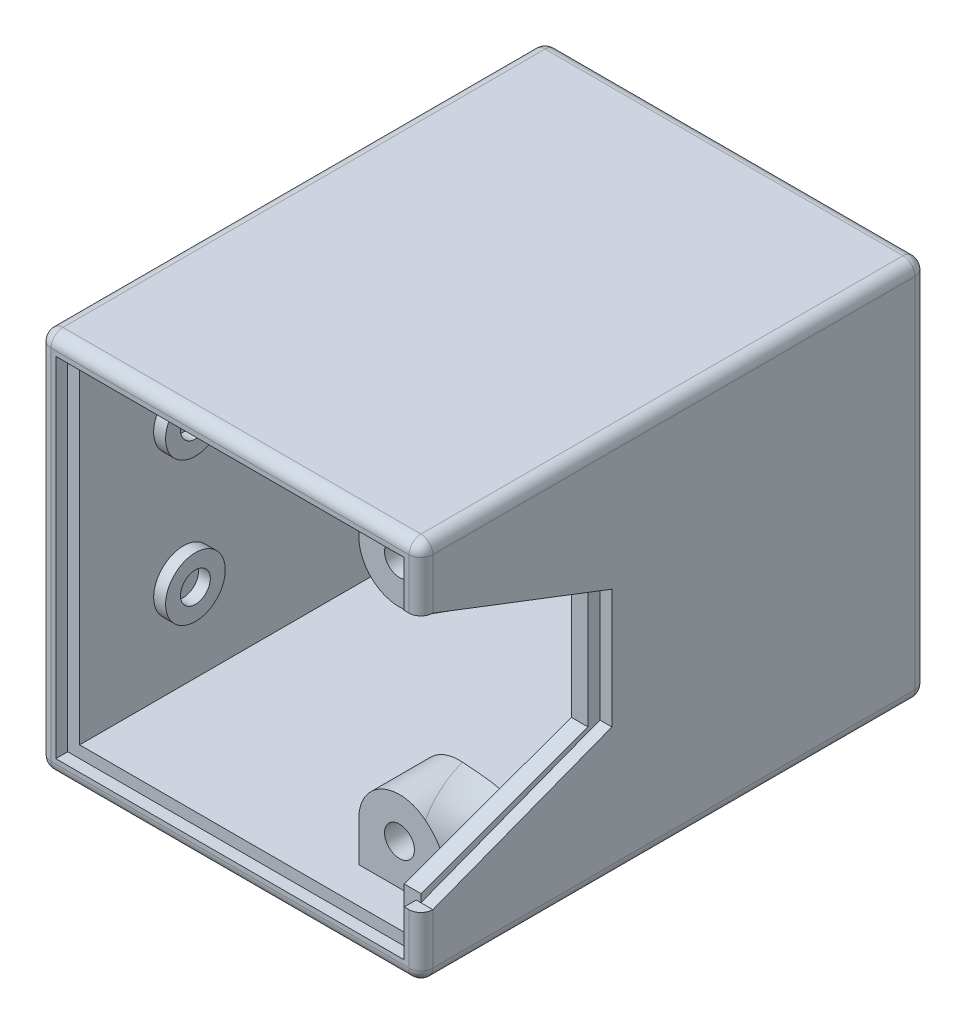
ISO-10303-21;
HEADER;
FILE_DESCRIPTION(('STEP AP214'),'2;1');
FILE_NAME('part.step','',(''),(''),'','','');
FILE_SCHEMA(('AUTOMOTIVE_DESIGN { 1 0 10303 214 1 1 1 1 }'));
ENDSEC;
DATA;
#1=APPLICATION_CONTEXT('core data for automotive mechanical design processes');
#2=APPLICATION_PROTOCOL_DEFINITION('international standard','automotive_design',2000,#1);
#3=PRODUCT_CONTEXT('',#1,'mechanical');
#4=PRODUCT('Part','Part','',(#3));
#5=PRODUCT_RELATED_PRODUCT_CATEGORY('part','',(#4));
#6=PRODUCT_DEFINITION_FORMATION('','',#4);
#7=PRODUCT_DEFINITION_CONTEXT('part definition',#1,'design');
#8=PRODUCT_DEFINITION('design','',#6,#7);
#9=PRODUCT_DEFINITION_SHAPE('','',#8);
#10=(LENGTH_UNIT() NAMED_UNIT(*) SI_UNIT(.MILLI.,.METRE.));
#11=(NAMED_UNIT(*) PLANE_ANGLE_UNIT() SI_UNIT($,.RADIAN.));
#12=(NAMED_UNIT(*) SI_UNIT($,.STERADIAN.) SOLID_ANGLE_UNIT());
#13=UNCERTAINTY_MEASURE_WITH_UNIT(LENGTH_MEASURE(1.E-05),#10,'distance_accuracy_value','');
#14=(GEOMETRIC_REPRESENTATION_CONTEXT(3) GLOBAL_UNCERTAINTY_ASSIGNED_CONTEXT((#13)) GLOBAL_UNIT_ASSIGNED_CONTEXT((#10,
#11,#12)) REPRESENTATION_CONTEXT('',''));
#15=CARTESIAN_POINT('',(0.,0.,0.));
#16=DIRECTION('',(0.,0.,1.));
#17=DIRECTION('',(1.,0.,0.));
#18=AXIS2_PLACEMENT_3D('',#15,#16,#17);
#19=CARTESIAN_POINT('',(-20.,-3.9,10.845653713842));
#20=DIRECTION('',(0.53729960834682,0.,0.843391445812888));
#21=DIRECTION('',(0.843391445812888,0.,-0.53729960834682));
#22=AXIS2_PLACEMENT_3D('',#19,#20,#21);
#23=PLANE('',#22);
#24=DIRECTION('',(-0.843391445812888,0.,0.53729960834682));
#25=VECTOR('',#24,1.);
#26=CARTESIAN_POINT('',(-20.,3.1,10.845653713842));
#27=LINE('',#26,#25);
#28=CARTESIAN_POINT('',(-18.7104809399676,3.1,10.0241394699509));
#29=VERTEX_POINT('',#28);
#30=CARTESIAN_POINT('',(-20.,3.1,10.845653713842));
#31=VERTEX_POINT('',#30);
#32=EDGE_CURVE('E595',#29,#31,#27,.T.);
#33=ORIENTED_EDGE('',*,*,#32,.F.);
#34=DIRECTION('',(0.,1.,0.));
#35=VECTOR('',#34,1.);
#36=CARTESIAN_POINT('',(-18.7104809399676,-3.9,10.0241394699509));
#37=LINE('',#36,#35);
#38=CARTESIAN_POINT('',(-18.7104809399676,-3.1,10.0241394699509));
#39=VERTEX_POINT('',#38);
#40=EDGE_CURVE('E712',#39,#29,#37,.T.);
#41=ORIENTED_EDGE('',*,*,#40,.F.);
#42=DIRECTION('',(0.843391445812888,0.,-0.53729960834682));
#43=VECTOR('',#42,1.);
#44=CARTESIAN_POINT('',(-20.,-3.1,10.845653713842));
#45=LINE('',#44,#43);
#46=CARTESIAN_POINT('',(-20.,-3.1,10.845653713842));
#47=VERTEX_POINT('',#46);
#48=EDGE_CURVE('E697',#47,#39,#45,.T.);
#49=ORIENTED_EDGE('',*,*,#48,.F.);
#50=DIRECTION('',(0.,1.,0.));
#51=VECTOR('',#50,1.);
#52=CARTESIAN_POINT('',(-20.,-3.9,10.845653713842));
#53=LINE('',#52,#51);
#54=EDGE_CURVE('E718',#47,#31,#53,.T.);
#55=ORIENTED_EDGE('',*,*,#54,.T.);
#56=EDGE_LOOP('',(#33,#41,#49,#55));
#57=FACE_BOUND('',#56,.T.);
#58=ADVANCED_FACE('F41',(#57),#23,.F.);
#59=CARTESIAN_POINT('',(-20.,-3.9,10.845653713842));
#60=DIRECTION('',(-0.537299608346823,0.,0.843391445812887));
#61=DIRECTION('',(0.843391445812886,0.,0.537299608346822));
#62=AXIS2_PLACEMENT_3D('',#59,#60,#61);
#63=PLANE('',#62);
#64=DIRECTION('',(-0.843391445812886,0.,-0.537299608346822));
#65=VECTOR('',#64,1.);
#66=CARTESIAN_POINT('',(-20.,3.1,10.845653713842));
#67=LINE('',#66,#65);
#68=CARTESIAN_POINT('',(-21.2895190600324,3.1,10.0241394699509));
#69=VERTEX_POINT('',#68);
#70=EDGE_CURVE('E593',#31,#69,#67,.T.);
#71=ORIENTED_EDGE('',*,*,#70,.F.);
#72=ORIENTED_EDGE('',*,*,#54,.F.);
#73=DIRECTION('',(0.843391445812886,0.,0.537299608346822));
#74=VECTOR('',#73,1.);
#75=CARTESIAN_POINT('',(-20.,-3.1,10.845653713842));
#76=LINE('',#75,#74);
#77=CARTESIAN_POINT('',(-21.2895190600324,-3.1,10.0241394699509));
#78=VERTEX_POINT('',#77);
#79=EDGE_CURVE('E695',#78,#47,#76,.T.);
#80=ORIENTED_EDGE('',*,*,#79,.F.);
#81=DIRECTION('',(0.,1.,0.));
#82=VECTOR('',#81,1.);
#83=CARTESIAN_POINT('',(-21.2895190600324,-3.9,10.0241394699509));
#84=LINE('',#83,#82);
#85=EDGE_CURVE('E722',#78,#69,#84,.T.);
#86=ORIENTED_EDGE('',*,*,#85,.T.);
#87=EDGE_LOOP('',(#71,#72,#80,#86));
#88=FACE_BOUND('',#87,.T.);
#89=ADVANCED_FACE('F1199',(#88),#63,.F.);
#90=CARTESIAN_POINT('',(-20.,-3.9,8.));
#91=DIRECTION('',(0.,1.,0.));
#92=DIRECTION('',(0.,0.,1.));
#93=AXIS2_PLACEMENT_3D('',#90,#91,#92);
#94=CYLINDRICAL_SURFACE('',#93,2.4);
#95=CARTESIAN_POINT('',(-20.,3.1,8.));
#96=DIRECTION('',(0.,1.,0.));
#97=DIRECTION('',(0.,0.,1.));
#98=AXIS2_PLACEMENT_3D('',#95,#96,#97);
#99=CIRCLE('',#98,2.4);
#100=EDGE_CURVE('E1504',#69,#29,#99,.F.);
#101=ORIENTED_EDGE('',*,*,#100,.F.);
#102=ORIENTED_EDGE('',*,*,#85,.F.);
#103=CARTESIAN_POINT('',(-20.,-3.1,8.));
#104=DIRECTION('',(0.,-1.,0.));
#105=DIRECTION('',(0.,0.,-1.));
#106=AXIS2_PLACEMENT_3D('',#103,#104,#105);
#107=CIRCLE('',#106,2.4);
#108=EDGE_CURVE('E1510',#39,#78,#107,.F.);
#109=ORIENTED_EDGE('',*,*,#108,.F.);
#110=ORIENTED_EDGE('',*,*,#40,.T.);
#111=EDGE_LOOP('',(#101,#102,#109,#110));
#112=FACE_BOUND('',#111,.T.);
#113=ADVANCED_FACE('F1205',(#112),#94,.F.);
#114=CARTESIAN_POINT('',(-20.,-3.9,18.845653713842));
#115=DIRECTION('',(0.537299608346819,0.,0.843391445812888));
#116=DIRECTION('',(0.843391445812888,0.,-0.537299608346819));
#117=AXIS2_PLACEMENT_3D('',#114,#115,#116);
#118=PLANE('',#117);
#119=DIRECTION('',(-0.843391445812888,0.,0.537299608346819));
#120=VECTOR('',#119,1.);
#121=CARTESIAN_POINT('',(-20.,3.1,18.845653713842));
#122=LINE('',#121,#120);
#123=CARTESIAN_POINT('',(-18.7104809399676,3.1,18.0241394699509));
#124=VERTEX_POINT('',#123);
#125=CARTESIAN_POINT('',(-20.,3.1,18.845653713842));
#126=VERTEX_POINT('',#125);
#127=EDGE_CURVE('E591',#124,#126,#122,.T.);
#128=ORIENTED_EDGE('',*,*,#127,.F.);
#129=DIRECTION('',(0.,1.,0.));
#130=VECTOR('',#129,1.);
#131=CARTESIAN_POINT('',(-18.7104809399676,-3.9,18.0241394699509));
#132=LINE('',#131,#130);
#133=CARTESIAN_POINT('',(-18.7104809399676,-3.1,18.0241394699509));
#134=VERTEX_POINT('',#133);
#135=EDGE_CURVE('E703',#134,#124,#132,.T.);
#136=ORIENTED_EDGE('',*,*,#135,.F.);
#137=DIRECTION('',(0.843391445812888,0.,-0.537299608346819));
#138=VECTOR('',#137,1.);
#139=CARTESIAN_POINT('',(-20.,-3.1,18.845653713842));
#140=LINE('',#139,#138);
#141=CARTESIAN_POINT('',(-20.,-3.1,18.845653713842));
#142=VERTEX_POINT('',#141);
#143=EDGE_CURVE('E693',#142,#134,#140,.T.);
#144=ORIENTED_EDGE('',*,*,#143,.F.);
#145=DIRECTION('',(0.,1.,0.));
#146=VECTOR('',#145,1.);
#147=CARTESIAN_POINT('',(-20.,-3.9,18.845653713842));
#148=LINE('',#147,#146);
#149=EDGE_CURVE('E709',#142,#126,#148,.T.);
#150=ORIENTED_EDGE('',*,*,#149,.T.);
#151=EDGE_LOOP('',(#128,#136,#144,#150));
#152=FACE_BOUND('',#151,.T.);
#153=ADVANCED_FACE('F1941',(#152),#118,.F.);
#154=CARTESIAN_POINT('',(-20.,-3.9,18.845653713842));
#155=DIRECTION('',(-0.53729960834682,0.,0.843391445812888));
#156=DIRECTION('',(0.843391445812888,0.,0.53729960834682));
#157=AXIS2_PLACEMENT_3D('',#154,#155,#156);
#158=PLANE('',#157);
#159=DIRECTION('',(-0.843391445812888,0.,-0.53729960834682));
#160=VECTOR('',#159,1.);
#161=CARTESIAN_POINT('',(-20.,3.1,18.845653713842));
#162=LINE('',#161,#160);
#163=CARTESIAN_POINT('',(-21.2895190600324,3.1,18.0241394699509));
#164=VERTEX_POINT('',#163);
#165=EDGE_CURVE('E589',#126,#164,#162,.T.);
#166=ORIENTED_EDGE('',*,*,#165,.F.);
#167=ORIENTED_EDGE('',*,*,#149,.F.);
#168=DIRECTION('',(0.843391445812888,0.,0.53729960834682));
#169=VECTOR('',#168,1.);
#170=CARTESIAN_POINT('',(-20.,-3.1,18.845653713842));
#171=LINE('',#170,#169);
#172=CARTESIAN_POINT('',(-21.2895190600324,-3.1,18.0241394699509));
#173=VERTEX_POINT('',#172);
#174=EDGE_CURVE('E691',#173,#142,#171,.T.);
#175=ORIENTED_EDGE('',*,*,#174,.F.);
#176=DIRECTION('',(0.,1.,0.));
#177=VECTOR('',#176,1.);
#178=CARTESIAN_POINT('',(-21.2895190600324,-3.9,18.0241394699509));
#179=LINE('',#178,#177);
#180=EDGE_CURVE('E713',#173,#164,#179,.T.);
#181=ORIENTED_EDGE('',*,*,#180,.T.);
#182=EDGE_LOOP('',(#166,#167,#175,#181));
#183=FACE_BOUND('',#182,.T.);
#184=ADVANCED_FACE('F1952',(#183),#158,.F.);
#185=CARTESIAN_POINT('',(-20.,-3.9,16.));
#186=DIRECTION('',(0.,1.,0.));
#187=DIRECTION('',(0.,0.,1.));
#188=AXIS2_PLACEMENT_3D('',#185,#186,#187);
#189=CYLINDRICAL_SURFACE('',#188,2.4);
#190=CARTESIAN_POINT('',(-20.,3.1,16.));
#191=DIRECTION('',(0.,1.,0.));
#192=DIRECTION('',(0.,0.,1.));
#193=AXIS2_PLACEMENT_3D('',#190,#191,#192);
#194=CIRCLE('',#193,2.4);
#195=EDGE_CURVE('E1506',#164,#124,#194,.F.);
#196=ORIENTED_EDGE('',*,*,#195,.F.);
#197=ORIENTED_EDGE('',*,*,#180,.F.);
#198=CARTESIAN_POINT('',(-20.,-3.1,16.));
#199=DIRECTION('',(0.,-1.,0.));
#200=DIRECTION('',(0.,0.,-1.));
#201=AXIS2_PLACEMENT_3D('',#198,#199,#200);
#202=CIRCLE('',#201,2.4);
#203=EDGE_CURVE('E1512',#134,#173,#202,.F.);
#204=ORIENTED_EDGE('',*,*,#203,.F.);
#205=ORIENTED_EDGE('',*,*,#135,.T.);
#206=EDGE_LOOP('',(#196,#197,#204,#205));
#207=FACE_BOUND('',#206,.T.);
#208=ADVANCED_FACE('F1964',(#207),#189,.F.);
#209=CARTESIAN_POINT('',(-20.,-3.9,26.845653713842));
#210=DIRECTION('',(0.537299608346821,0.,0.843391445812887));
#211=DIRECTION('',(0.843391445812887,0.,-0.537299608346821));
#212=AXIS2_PLACEMENT_3D('',#209,#210,#211);
#213=PLANE('',#212);
#214=DIRECTION('',(-0.843391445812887,0.,0.537299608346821));
#215=VECTOR('',#214,1.);
#216=CARTESIAN_POINT('',(-20.,3.1,26.845653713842));
#217=LINE('',#216,#215);
#218=CARTESIAN_POINT('',(-18.7104809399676,3.1,26.0241394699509));
#219=VERTEX_POINT('',#218);
#220=CARTESIAN_POINT('',(-20.,3.1,26.845653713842));
#221=VERTEX_POINT('',#220);
#222=EDGE_CURVE('E587',#219,#221,#217,.T.);
#223=ORIENTED_EDGE('',*,*,#222,.F.);
#224=DIRECTION('',(0.,1.,0.));
#225=VECTOR('',#224,1.);
#226=CARTESIAN_POINT('',(-18.7104809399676,-3.9,26.0241394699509));
#227=LINE('',#226,#225);
#228=CARTESIAN_POINT('',(-18.7104809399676,-3.1,26.0241394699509));
#229=VERTEX_POINT('',#228);
#230=EDGE_CURVE('E699',#229,#219,#227,.T.);
#231=ORIENTED_EDGE('',*,*,#230,.F.);
#232=DIRECTION('',(0.843391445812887,0.,-0.537299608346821));
#233=VECTOR('',#232,1.);
#234=CARTESIAN_POINT('',(-20.,-3.1,26.845653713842));
#235=LINE('',#234,#233);
#236=CARTESIAN_POINT('',(-20.,-3.1,26.845653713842));
#237=VERTEX_POINT('',#236);
#238=EDGE_CURVE('E689',#237,#229,#235,.T.);
#239=ORIENTED_EDGE('',*,*,#238,.F.);
#240=DIRECTION('',(0.,1.,0.));
#241=VECTOR('',#240,1.);
#242=CARTESIAN_POINT('',(-20.,-3.9,26.845653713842));
#243=LINE('',#242,#241);
#244=EDGE_CURVE('E700',#237,#221,#243,.T.);
#245=ORIENTED_EDGE('',*,*,#244,.T.);
#246=EDGE_LOOP('',(#223,#231,#239,#245));
#247=FACE_BOUND('',#246,.T.);
#248=ADVANCED_FACE('F1976',(#247),#213,.F.);
#249=CARTESIAN_POINT('',(-20.,-3.9,26.845653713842));
#250=DIRECTION('',(-0.537299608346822,0.,0.843391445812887));
#251=DIRECTION('',(0.843391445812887,0.,0.537299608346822));
#252=AXIS2_PLACEMENT_3D('',#249,#250,#251);
#253=PLANE('',#252);
#254=DIRECTION('',(-0.843391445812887,0.,-0.537299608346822));
#255=VECTOR('',#254,1.);
#256=CARTESIAN_POINT('',(-20.,3.1,26.845653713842));
#257=LINE('',#256,#255);
#258=CARTESIAN_POINT('',(-21.2895190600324,3.1,26.0241394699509));
#259=VERTEX_POINT('',#258);
#260=EDGE_CURVE('E537',#221,#259,#257,.T.);
#261=ORIENTED_EDGE('',*,*,#260,.F.);
#262=ORIENTED_EDGE('',*,*,#244,.F.);
#263=DIRECTION('',(0.843391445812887,0.,0.537299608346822));
#264=VECTOR('',#263,1.);
#265=CARTESIAN_POINT('',(-20.,-3.1,26.845653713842));
#266=LINE('',#265,#264);
#267=CARTESIAN_POINT('',(-21.2895190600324,-3.1,26.0241394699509));
#268=VERTEX_POINT('',#267);
#269=EDGE_CURVE('E637',#268,#237,#266,.T.);
#270=ORIENTED_EDGE('',*,*,#269,.F.);
#271=DIRECTION('',(0.,1.,0.));
#272=VECTOR('',#271,1.);
#273=CARTESIAN_POINT('',(-21.2895190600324,-3.9,26.0241394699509));
#274=LINE('',#273,#272);
#275=EDGE_CURVE('E704',#268,#259,#274,.T.);
#276=ORIENTED_EDGE('',*,*,#275,.T.);
#277=EDGE_LOOP('',(#261,#262,#270,#276));
#278=FACE_BOUND('',#277,.T.);
#279=ADVANCED_FACE('F1988',(#278),#253,.F.);
#280=CARTESIAN_POINT('',(-20.,-3.9,24.));
#281=DIRECTION('',(0.,1.,0.));
#282=DIRECTION('',(0.,0.,1.));
#283=AXIS2_PLACEMENT_3D('',#280,#281,#282);
#284=CYLINDRICAL_SURFACE('',#283,2.4);
#285=CARTESIAN_POINT('',(-20.,3.1,24.));
#286=DIRECTION('',(0.,1.,0.));
#287=DIRECTION('',(0.,0.,1.));
#288=AXIS2_PLACEMENT_3D('',#285,#286,#287);
#289=CIRCLE('',#288,2.4);
#290=EDGE_CURVE('E1508',#259,#219,#289,.F.);
#291=ORIENTED_EDGE('',*,*,#290,.F.);
#292=ORIENTED_EDGE('',*,*,#275,.F.);
#293=CARTESIAN_POINT('',(-20.,-3.1,24.));
#294=DIRECTION('',(0.,-1.,0.));
#295=DIRECTION('',(0.,0.,-1.));
#296=AXIS2_PLACEMENT_3D('',#293,#294,#295);
#297=CIRCLE('',#296,2.4);
#298=EDGE_CURVE('E1514',#229,#268,#297,.F.);
#299=ORIENTED_EDGE('',*,*,#298,.F.);
#300=ORIENTED_EDGE('',*,*,#230,.T.);
#301=EDGE_LOOP('',(#291,#292,#299,#300));
#302=FACE_BOUND('',#301,.T.);
#303=ADVANCED_FACE('F1557',(#302),#284,.F.);
#304=CARTESIAN_POINT('',(-20.,3.9,8.));
#305=DIRECTION('',(0.,-1.,0.));
#306=DIRECTION('',(0.,0.,1.));
#307=AXIS2_PLACEMENT_3D('',#304,#305,#306);
#308=PLANE('',#307);
#309=DIRECTION('',(-0.843391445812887,0.,-0.537299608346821));
#310=VECTOR('',#309,1.);
#311=CARTESIAN_POINT('',(-20.,3.9,19.8238471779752));
#312=LINE('',#311,#310);
#313=CARTESIAN_POINT('',(-20.,3.9,19.8238471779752));
#314=VERTEX_POINT('',#313);
#315=CARTESIAN_POINT('',(-21.7327912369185,3.9,18.7199374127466));
#316=VERTEX_POINT('',#315);
#317=EDGE_CURVE('E548',#314,#316,#312,.T.);
#318=ORIENTED_EDGE('',*,*,#317,.T.);
#319=CARTESIAN_POINT('',(-20.,3.9,16.));
#320=DIRECTION('',(0.,-1.,0.));
#321=DIRECTION('',(0.,0.,-1.));
#322=AXIS2_PLACEMENT_3D('',#319,#320,#321);
#323=CIRCLE('',#322,3.225);
#324=CARTESIAN_POINT('',(-18.2672087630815,3.9,18.7199374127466));
#325=VERTEX_POINT('',#324);
#326=EDGE_CURVE('E543',#316,#325,#323,.T.);
#327=ORIENTED_EDGE('',*,*,#326,.T.);
#328=DIRECTION('',(-0.843391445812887,0.,0.537299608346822));
#329=VECTOR('',#328,1.);
#330=CARTESIAN_POINT('',(-20.,3.9,19.8238471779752));
#331=LINE('',#330,#329);
#332=EDGE_CURVE('E551',#325,#314,#331,.T.);
#333=ORIENTED_EDGE('',*,*,#332,.T.);
#334=EDGE_LOOP('',(#318,#327,#333));
#335=FACE_BOUND('',#334,.T.);
#336=DIRECTION('',(0.,0.,-1.));
#337=VECTOR('',#336,1.);
#338=CARTESIAN_POINT('',(-16.,3.9,28.));
#339=LINE('',#338,#337);
#340=CARTESIAN_POINT('',(-16.,3.9,28.));
#341=VERTEX_POINT('',#340);
#342=CARTESIAN_POINT('',(-16.,3.9,4.));
#343=VERTEX_POINT('',#342);
#344=EDGE_CURVE('E597',#341,#343,#339,.T.);
#345=ORIENTED_EDGE('',*,*,#344,.T.);
#346=DIRECTION('',(-1.,0.,0.));
#347=VECTOR('',#346,1.);
#348=CARTESIAN_POINT('',(-16.,3.9,4.));
#349=LINE('',#348,#347);
#350=CARTESIAN_POINT('',(-20.,3.9,4.));
#351=VERTEX_POINT('',#350);
#352=EDGE_CURVE('E612',#343,#351,#349,.T.);
#353=ORIENTED_EDGE('',*,*,#352,.T.);
#354=CARTESIAN_POINT('',(-20.,3.9,8.));
#355=DIRECTION('',(0.,1.,0.));
#356=DIRECTION('',(0.,0.,1.));
#357=AXIS2_PLACEMENT_3D('',#354,#355,#356);
#358=CIRCLE('',#357,4.);
#359=CARTESIAN_POINT('',(-24.,3.9,8.00000000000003));
#360=VERTEX_POINT('',#359);
#361=EDGE_CURVE('E609',#351,#360,#358,.T.);
#362=ORIENTED_EDGE('',*,*,#361,.T.);
#363=DIRECTION('',(0.,0.,1.));
#364=VECTOR('',#363,1.);
#365=CARTESIAN_POINT('',(-24.,3.9,8.00000000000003));
#366=LINE('',#365,#364);
#367=CARTESIAN_POINT('',(-24.,3.9,24.));
#368=VERTEX_POINT('',#367);
#369=EDGE_CURVE('E606',#360,#368,#366,.T.);
#370=ORIENTED_EDGE('',*,*,#369,.T.);
#371=CARTESIAN_POINT('',(-20.,3.9,24.));
#372=DIRECTION('',(0.,1.,0.));
#373=DIRECTION('',(0.,0.,1.));
#374=AXIS2_PLACEMENT_3D('',#371,#372,#373);
#375=CIRCLE('',#374,4.);
#376=CARTESIAN_POINT('',(-20.,3.9,28.));
#377=VERTEX_POINT('',#376);
#378=EDGE_CURVE('E603',#368,#377,#375,.T.);
#379=ORIENTED_EDGE('',*,*,#378,.T.);
#380=DIRECTION('',(1.,0.,0.));
#381=VECTOR('',#380,1.);
#382=CARTESIAN_POINT('',(-20.,3.9,28.));
#383=LINE('',#382,#381);
#384=EDGE_CURVE('E600',#377,#341,#383,.T.);
#385=ORIENTED_EDGE('',*,*,#384,.T.);
#386=EDGE_LOOP('',(#345,#353,#362,#370,#379,#385));
#387=FACE_BOUND('',#386,.T.);
#388=DIRECTION('',(-0.843391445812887,0.,-0.537299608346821));
#389=VECTOR('',#388,1.);
#390=CARTESIAN_POINT('',(-20.,3.9,27.8238471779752));
#391=LINE('',#390,#389);
#392=CARTESIAN_POINT('',(-20.,3.9,27.8238471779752));
#393=VERTEX_POINT('',#392);
#394=CARTESIAN_POINT('',(-21.7327912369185,3.9,26.7199374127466));
#395=VERTEX_POINT('',#394);
#396=EDGE_CURVE('E572',#393,#395,#391,.T.);
#397=ORIENTED_EDGE('',*,*,#396,.T.);
#398=CARTESIAN_POINT('',(-20.,3.9,24.));
#399=DIRECTION('',(0.,-1.,0.));
#400=DIRECTION('',(0.,0.,-1.));
#401=AXIS2_PLACEMENT_3D('',#398,#399,#400);
#402=CIRCLE('',#401,3.225);
#403=CARTESIAN_POINT('',(-18.2672087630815,3.9,26.7199374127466));
#404=VERTEX_POINT('',#403);
#405=EDGE_CURVE('E567',#395,#404,#402,.T.);
#406=ORIENTED_EDGE('',*,*,#405,.T.);
#407=DIRECTION('',(-0.843391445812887,0.,0.537299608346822));
#408=VECTOR('',#407,1.);
#409=CARTESIAN_POINT('',(-20.,3.9,27.8238471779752));
#410=LINE('',#409,#408);
#411=EDGE_CURVE('E575',#404,#393,#410,.T.);
#412=ORIENTED_EDGE('',*,*,#411,.T.);
#413=EDGE_LOOP('',(#397,#406,#412));
#414=FACE_BOUND('',#413,.T.);
#415=DIRECTION('',(-0.843391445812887,0.,0.537299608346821));
#416=VECTOR('',#415,1.);
#417=CARTESIAN_POINT('',(-20.,3.9,11.8238471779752));
#418=LINE('',#417,#416);
#419=CARTESIAN_POINT('',(-18.2672087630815,3.9,10.7199374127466));
#420=VERTEX_POINT('',#419);
#421=CARTESIAN_POINT('',(-20.,3.9,11.8238471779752));
#422=VERTEX_POINT('',#421);
#423=EDGE_CURVE('E521',#420,#422,#418,.T.);
#424=ORIENTED_EDGE('',*,*,#423,.T.);
#425=DIRECTION('',(-0.843391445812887,0.,-0.537299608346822));
#426=VECTOR('',#425,1.);
#427=CARTESIAN_POINT('',(-20.,3.9,11.8238471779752));
#428=LINE('',#427,#426);
#429=CARTESIAN_POINT('',(-21.7327912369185,3.9,10.7199374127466));
#430=VERTEX_POINT('',#429);
#431=EDGE_CURVE('E525',#422,#430,#428,.T.);
#432=ORIENTED_EDGE('',*,*,#431,.T.);
#433=CARTESIAN_POINT('',(-20.,3.9,8.));
#434=DIRECTION('',(0.,-1.,0.));
#435=DIRECTION('',(0.,0.,-1.));
#436=AXIS2_PLACEMENT_3D('',#433,#434,#435);
#437=CIRCLE('',#436,3.225);
#438=EDGE_CURVE('E528',#430,#420,#437,.T.);
#439=ORIENTED_EDGE('',*,*,#438,.T.);
#440=EDGE_LOOP('',(#424,#432,#439));
#441=FACE_BOUND('',#440,.T.);
#442=ADVANCED_FACE('F1547',(#335,#387,#414,#441),#308,.F.);
#443=CARTESIAN_POINT('',(-16.,16.,2.4));
#444=DIRECTION('',(1.,0.,0.));
#445=DIRECTION('',(0.,1.,0.));
#446=AXIS2_PLACEMENT_3D('',#443,#444,#445);
#447=PLANE('',#446);
#448=DIRECTION('',(0.,0.,-1.));
#449=VECTOR('',#448,1.);
#450=CARTESIAN_POINT('',(-16.,-15.,2.4));
#451=LINE('',#450,#449);
#452=CARTESIAN_POINT('',(-16.,-15.,1.));
#453=VERTEX_POINT('',#452);
#454=CARTESIAN_POINT('',(-16.,-15.,41.4));
#455=VERTEX_POINT('',#454);
#456=EDGE_CURVE('E1382',#453,#455,#451,.F.);
#457=ORIENTED_EDGE('',*,*,#456,.T.);
#458=DIRECTION('',(0.,-1.,0.));
#459=VECTOR('',#458,1.);
#460=CARTESIAN_POINT('',(-16.,16.,41.4));
#461=LINE('',#460,#459);
#462=CARTESIAN_POINT('',(-16.,15.,41.4));
#463=VERTEX_POINT('',#462);
#464=EDGE_CURVE('E1388',#455,#463,#461,.F.);
#465=ORIENTED_EDGE('',*,*,#464,.T.);
#466=DIRECTION('',(0.,0.,-1.));
#467=VECTOR('',#466,1.);
#468=CARTESIAN_POINT('',(-16.,15.,2.4));
#469=LINE('',#468,#467);
#470=CARTESIAN_POINT('',(-16.,15.,1.));
#471=VERTEX_POINT('',#470);
#472=EDGE_CURVE('E1386',#463,#471,#469,.T.);
#473=ORIENTED_EDGE('',*,*,#472,.T.);
#474=DIRECTION('',(0.,-1.,0.));
#475=VECTOR('',#474,1.);
#476=CARTESIAN_POINT('',(-16.,-16.,1.));
#477=LINE('',#476,#475);
#478=EDGE_CURVE('E1384',#471,#453,#477,.T.);
#479=ORIENTED_EDGE('',*,*,#478,.T.);
#480=EDGE_LOOP('',(#457,#465,#473,#479));
#481=FACE_BOUND('',#480,.T.);
#482=DIRECTION('',(0.,1.,0.));
#483=VECTOR('',#482,1.);
#484=CARTESIAN_POINT('',(-16.,-3.9,4.));
#485=LINE('',#484,#483);
#486=CARTESIAN_POINT('',(-16.,-3.9,4.));
#487=VERTEX_POINT('',#486);
#488=EDGE_CURVE('E744',#487,#343,#485,.T.);
#489=ORIENTED_EDGE('',*,*,#488,.T.);
#490=ORIENTED_EDGE('',*,*,#344,.F.);
#491=DIRECTION('',(0.,1.,0.));
#492=VECTOR('',#491,1.);
#493=CARTESIAN_POINT('',(-16.,-3.9,28.));
#494=LINE('',#493,#492);
#495=CARTESIAN_POINT('',(-16.,-3.9,28.));
#496=VERTEX_POINT('',#495);
#497=EDGE_CURVE('E745',#496,#341,#494,.T.);
#498=ORIENTED_EDGE('',*,*,#497,.F.);
#499=DIRECTION('',(0.,0.,-1.));
#500=VECTOR('',#499,1.);
#501=CARTESIAN_POINT('',(-16.,-3.9,28.));
#502=LINE('',#501,#500);
#503=EDGE_CURVE('E721',#496,#487,#502,.T.);
#504=ORIENTED_EDGE('',*,*,#503,.T.);
#505=EDGE_LOOP('',(#489,#490,#498,#504));
#506=FACE_BOUND('',#505,.T.);
#507=ADVANCED_FACE('F1540',(#481,#506),#447,.F.);
#508=CARTESIAN_POINT('',(0.,0.,2.4));
#509=DIRECTION('',(0.,0.,-1.));
#510=DIRECTION('',(-1.,0.,0.));
#511=AXIS2_PLACEMENT_3D('',#508,#509,#510);
#512=PLANE('',#511);
#513=CARTESIAN_POINT('',(8.18486124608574,0.,2.4));
#514=DIRECTION('',(0.,0.,-1.));
#515=DIRECTION('',(-1.,0.,0.));
#516=AXIS2_PLACEMENT_3D('',#513,#514,#515);
#517=CIRCLE('',#516,2.00000000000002);
#518=CARTESIAN_POINT('',(6.18486124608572,0.,2.4));
#519=VERTEX_POINT('',#518);
#520=EDGE_CURVE('E1516',#519,#519,#517,.T.);
#521=ORIENTED_EDGE('',*,*,#520,.T.);
#522=EDGE_LOOP('',(#521));
#523=FACE_BOUND('',#522,.T.);
#524=CARTESIAN_POINT('',(8.18486124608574,0.,2.4));
#525=DIRECTION('',(0.,0.,1.));
#526=DIRECTION('',(1.,0.,0.));
#527=AXIS2_PLACEMENT_3D('',#524,#525,#526);
#528=CIRCLE('',#527,2.75);
#529=CARTESIAN_POINT('',(10.9348612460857,0.,2.4));
#530=VERTEX_POINT('',#529);
#531=EDGE_CURVE('E747',#530,#530,#528,.T.);
#532=ORIENTED_EDGE('',*,*,#531,.T.);
#533=EDGE_LOOP('',(#532));
#534=FACE_BOUND('',#533,.T.);
#535=ADVANCED_FACE('F1528',(#523,#534),#512,.F.);
#536=CARTESIAN_POINT('',(13.6,13.6,42.4));
#537=DIRECTION('',(-1.,0.,0.));
#538=DIRECTION('',(0.,-1.,0.));
#539=AXIS2_PLACEMENT_3D('',#536,#537,#538);
#540=PLANE('',#539);
#541=DIRECTION('',(0.,0.342020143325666,-0.939692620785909));
#542=VECTOR('',#541,1.);
#543=CARTESIAN_POINT('',(13.6,-5.,27.4));
#544=LINE('',#543,#542);
#545=CARTESIAN_POINT('',(13.6,-10.0955832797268,41.4));
#546=VERTEX_POINT('',#545);
#547=CARTESIAN_POINT('',(13.6,-9.00367257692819,38.4));
#548=VERTEX_POINT('',#547);
#549=EDGE_CURVE('E956',#546,#548,#544,.T.);
#550=ORIENTED_EDGE('',*,*,#549,.T.);
#551=DIRECTION('',(0.,1.,0.));
#552=VECTOR('',#551,1.);
#553=CARTESIAN_POINT('',(13.6,0.,38.4));
#554=LINE('',#553,#552);
#555=CARTESIAN_POINT('',(13.6,-13.6,38.4));
#556=VERTEX_POINT('',#555);
#557=EDGE_CURVE('E792',#556,#548,#554,.T.);
#558=ORIENTED_EDGE('',*,*,#557,.F.);
#559=DIRECTION('',(0.,0.,-1.));
#560=VECTOR('',#559,1.);
#561=CARTESIAN_POINT('',(13.6,-13.6,42.4));
#562=LINE('',#561,#560);
#563=CARTESIAN_POINT('',(13.6,-13.6,41.4));
#564=VERTEX_POINT('',#563);
#565=EDGE_CURVE('E990',#564,#556,#562,.T.);
#566=ORIENTED_EDGE('',*,*,#565,.F.);
#567=DIRECTION('',(0.,1.,0.));
#568=VECTOR('',#567,1.);
#569=CARTESIAN_POINT('',(13.6,-10.459553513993,41.4));
#570=LINE('',#569,#568);
#571=EDGE_CURVE('E887',#564,#546,#570,.T.);
#572=ORIENTED_EDGE('',*,*,#571,.T.);
#573=EDGE_LOOP('',(#550,#558,#566,#572));
#574=FACE_BOUND('',#573,.T.);
#575=ADVANCED_FACE('F1345',(#574),#540,.T.);
#576=DIRECTION('',(0.,1.,0.));
#577=VECTOR('',#576,1.);
#578=CARTESIAN_POINT('',(13.6,0.,33.4));
#579=LINE('',#578,#577);
#580=CARTESIAN_POINT('',(13.6,-13.6,33.4));
#581=VERTEX_POINT('',#580);
#582=CARTESIAN_POINT('',(13.6,-7.1838214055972,33.4));
#583=VERTEX_POINT('',#582);
#584=EDGE_CURVE('E778',#581,#583,#579,.T.);
#585=ORIENTED_EDGE('',*,*,#584,.T.);
#586=CARTESIAN_POINT('',(13.6,-5.,27.4));
#587=VERTEX_POINT('',#586);
#588=EDGE_CURVE('E955',#583,#587,#544,.T.);
#589=ORIENTED_EDGE('',*,*,#588,.T.);
#590=DIRECTION('',(0.,1.,0.));
#591=VECTOR('',#590,1.);
#592=CARTESIAN_POINT('',(13.6,5.,27.4));
#593=LINE('',#592,#591);
#594=CARTESIAN_POINT('',(13.6,5.,27.4));
#595=VERTEX_POINT('',#594);
#596=EDGE_CURVE('E967',#587,#595,#593,.T.);
#597=ORIENTED_EDGE('',*,*,#596,.T.);
#598=DIRECTION('',(0.,0.342020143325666,0.93969262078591));
#599=VECTOR('',#598,1.);
#600=CARTESIAN_POINT('',(13.6,10.459553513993,42.4));
#601=LINE('',#600,#599);
#602=CARTESIAN_POINT('',(13.6,7.18382140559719,33.4));
#603=VERTEX_POINT('',#602);
#604=EDGE_CURVE('E961',#595,#603,#601,.T.);
#605=ORIENTED_EDGE('',*,*,#604,.T.);
#606=DIRECTION('',(0.,-1.,0.));
#607=VECTOR('',#606,1.);
#608=CARTESIAN_POINT('',(13.6,0.,33.4));
#609=LINE('',#608,#607);
#610=CARTESIAN_POINT('',(13.6,13.6,33.4));
#611=VERTEX_POINT('',#610);
#612=EDGE_CURVE('E811',#611,#603,#609,.T.);
#613=ORIENTED_EDGE('',*,*,#612,.F.);
#614=DIRECTION('',(0.,0.,-1.));
#615=VECTOR('',#614,1.);
#616=CARTESIAN_POINT('',(13.6,13.6,42.4));
#617=LINE('',#616,#615);
#618=CARTESIAN_POINT('',(13.6,13.6,2.4));
#619=VERTEX_POINT('',#618);
#620=EDGE_CURVE('E986',#611,#619,#617,.T.);
#621=ORIENTED_EDGE('',*,*,#620,.T.);
#622=DIRECTION('',(0.,1.,0.));
#623=VECTOR('',#622,1.);
#624=CARTESIAN_POINT('',(13.6,13.6,2.4));
#625=LINE('',#624,#623);
#626=CARTESIAN_POINT('',(13.6,-13.6,2.4));
#627=VERTEX_POINT('',#626);
#628=EDGE_CURVE('E983',#627,#619,#625,.T.);
#629=ORIENTED_EDGE('',*,*,#628,.F.);
#630=EDGE_CURVE('E989',#581,#627,#562,.T.);
#631=ORIENTED_EDGE('',*,*,#630,.F.);
#632=EDGE_LOOP('',(#585,#589,#597,#605,#613,#621,#629,#631));
#633=FACE_BOUND('',#632,.T.);
#634=ADVANCED_FACE('F1308',(#633),#540,.T.);
#635=CARTESIAN_POINT('',(-13.6,-13.6,42.4));
#636=DIRECTION('',(0.,1.,0.));
#637=DIRECTION('',(0.,0.,1.));
#638=AXIS2_PLACEMENT_3D('',#635,#636,#637);
#639=PLANE('',#638);
#640=DIRECTION('',(0.,0.,1.));
#641=VECTOR('',#640,1.);
#642=CARTESIAN_POINT('',(6.8,-13.6,33.4));
#643=LINE('',#642,#641);
#644=CARTESIAN_POINT('',(6.8,-13.6,33.4));
#645=VERTEX_POINT('',#644);
#646=CARTESIAN_POINT('',(6.8,-13.6,38.4));
#647=VERTEX_POINT('',#646);
#648=EDGE_CURVE('E783',#645,#647,#643,.T.);
#649=ORIENTED_EDGE('',*,*,#648,.F.);
#650=DIRECTION('',(1.,0.,0.));
#651=VECTOR('',#650,1.);
#652=CARTESIAN_POINT('',(0.,-13.6,33.4));
#653=LINE('',#652,#651);
#654=EDGE_CURVE('E776',#645,#581,#653,.T.);
#655=ORIENTED_EDGE('',*,*,#654,.T.);
#656=ORIENTED_EDGE('',*,*,#630,.T.);
#657=DIRECTION('',(1.,0.,0.));
#658=VECTOR('',#657,1.);
#659=CARTESIAN_POINT('',(-13.6,-13.6,2.4));
#660=LINE('',#659,#658);
#661=CARTESIAN_POINT('',(-13.6,-13.6,2.4));
#662=VERTEX_POINT('',#661);
#663=EDGE_CURVE('E980',#662,#627,#660,.T.);
#664=ORIENTED_EDGE('',*,*,#663,.F.);
#665=DIRECTION('',(0.,0.,-1.));
#666=VECTOR('',#665,1.);
#667=CARTESIAN_POINT('',(-13.6,-13.6,42.4));
#668=LINE('',#667,#666);
#669=CARTESIAN_POINT('',(-13.6,-13.6,41.4));
#670=VERTEX_POINT('',#669);
#671=EDGE_CURVE('E992',#670,#662,#668,.T.);
#672=ORIENTED_EDGE('',*,*,#671,.F.);
#673=DIRECTION('',(1.,0.,0.));
#674=VECTOR('',#673,1.);
#675=CARTESIAN_POINT('',(13.6,-13.6,41.4));
#676=LINE('',#675,#674);
#677=EDGE_CURVE('E896',#670,#564,#676,.T.);
#678=ORIENTED_EDGE('',*,*,#677,.T.);
#679=ORIENTED_EDGE('',*,*,#565,.T.);
#680=DIRECTION('',(1.,0.,0.));
#681=VECTOR('',#680,1.);
#682=CARTESIAN_POINT('',(0.,-13.6,38.4));
#683=LINE('',#682,#681);
#684=EDGE_CURVE('E789',#647,#556,#683,.T.);
#685=ORIENTED_EDGE('',*,*,#684,.F.);
#686=EDGE_LOOP('',(#649,#655,#656,#664,#672,#678,#679,#685));
#687=FACE_BOUND('',#686,.T.);
#688=ADVANCED_FACE('F1341',(#687),#639,.T.);
#689=DIRECTION('',(0.,-1.,0.));
#690=VECTOR('',#689,1.);
#691=CARTESIAN_POINT('',(13.6,0.,38.4));
#692=LINE('',#691,#690);
#693=CARTESIAN_POINT('',(13.6,13.6,38.4));
#694=VERTEX_POINT('',#693);
#695=CARTESIAN_POINT('',(13.6,9.00367257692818,38.4));
#696=VERTEX_POINT('',#695);
#697=EDGE_CURVE('E825',#694,#696,#692,.T.);
#698=ORIENTED_EDGE('',*,*,#697,.T.);
#699=CARTESIAN_POINT('',(13.6,10.0955832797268,41.4));
#700=VERTEX_POINT('',#699);
#701=EDGE_CURVE('E966',#696,#700,#601,.T.);
#702=ORIENTED_EDGE('',*,*,#701,.T.);
#703=CARTESIAN_POINT('',(13.6,13.6,41.4));
#704=VERTEX_POINT('',#703);
#705=EDGE_CURVE('E882',#700,#704,#570,.T.);
#706=ORIENTED_EDGE('',*,*,#705,.T.);
#707=EDGE_CURVE('E987',#704,#694,#617,.T.);
#708=ORIENTED_EDGE('',*,*,#707,.T.);
#709=EDGE_LOOP('',(#698,#702,#706,#708));
#710=FACE_BOUND('',#709,.T.);
#711=ADVANCED_FACE('F1546',(#710),#540,.T.);
#712=CARTESIAN_POINT('',(-13.6,13.6,42.4));
#713=DIRECTION('',(0.,-1.,0.));
#714=DIRECTION('',(0.,0.,-1.));
#715=AXIS2_PLACEMENT_3D('',#712,#713,#714);
#716=PLANE('',#715);
#717=ORIENTED_EDGE('',*,*,#620,.F.);
#718=DIRECTION('',(1.,0.,0.));
#719=VECTOR('',#718,1.);
#720=CARTESIAN_POINT('',(0.,13.6,33.4));
#721=LINE('',#720,#719);
#722=CARTESIAN_POINT('',(6.8,13.6,33.4));
#723=VERTEX_POINT('',#722);
#724=EDGE_CURVE('E813',#723,#611,#721,.T.);
#725=ORIENTED_EDGE('',*,*,#724,.F.);
#726=DIRECTION('',(0.,0.,1.));
#727=VECTOR('',#726,1.);
#728=CARTESIAN_POINT('',(6.8,13.6,33.4));
#729=LINE('',#728,#727);
#730=CARTESIAN_POINT('',(6.8,13.6,38.4));
#731=VERTEX_POINT('',#730);
#732=EDGE_CURVE('E829',#723,#731,#729,.T.);
#733=ORIENTED_EDGE('',*,*,#732,.T.);
#734=DIRECTION('',(1.,0.,0.));
#735=VECTOR('',#734,1.);
#736=CARTESIAN_POINT('',(0.,13.6,38.4));
#737=LINE('',#736,#735);
#738=EDGE_CURVE('E805',#731,#694,#737,.T.);
#739=ORIENTED_EDGE('',*,*,#738,.T.);
#740=ORIENTED_EDGE('',*,*,#707,.F.);
#741=DIRECTION('',(-1.,0.,0.));
#742=VECTOR('',#741,1.);
#743=CARTESIAN_POINT('',(-13.6,13.6,41.4));
#744=LINE('',#743,#742);
#745=CARTESIAN_POINT('',(-13.6,13.6,41.4));
#746=VERTEX_POINT('',#745);
#747=EDGE_CURVE('E890',#704,#746,#744,.T.);
#748=ORIENTED_EDGE('',*,*,#747,.T.);
#749=DIRECTION('',(0.,0.,-1.));
#750=VECTOR('',#749,1.);
#751=CARTESIAN_POINT('',(-13.6,13.6,42.4));
#752=LINE('',#751,#750);
#753=CARTESIAN_POINT('',(-13.6,13.6,2.4));
#754=VERTEX_POINT('',#753);
#755=EDGE_CURVE('E994',#746,#754,#752,.T.);
#756=ORIENTED_EDGE('',*,*,#755,.T.);
#757=DIRECTION('',(-1.,0.,0.));
#758=VECTOR('',#757,1.);
#759=CARTESIAN_POINT('',(-13.6,13.6,2.4));
#760=LINE('',#759,#758);
#761=EDGE_CURVE('E964',#619,#754,#760,.T.);
#762=ORIENTED_EDGE('',*,*,#761,.F.);
#763=EDGE_LOOP('',(#717,#725,#733,#739,#740,#748,#756,#762));
#764=FACE_BOUND('',#763,.T.);
#765=ADVANCED_FACE('F1332',(#764),#716,.T.);
#766=CARTESIAN_POINT('',(-12.141193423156,-5.00000000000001,27.4));
#767=DIRECTION('',(0.,-0.939692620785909,-0.342020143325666));
#768=DIRECTION('',(0.,0.342020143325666,-0.939692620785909));
#769=AXIS2_PLACEMENT_3D('',#766,#767,#768);
#770=PLANE('',#769);
#771=DIRECTION('',(0.,-0.342020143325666,0.93969262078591));
#772=VECTOR('',#771,1.);
#773=CARTESIAN_POINT('',(15.,-10.0955832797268,41.4));
#774=LINE('',#773,#772);
#775=CARTESIAN_POINT('',(15.,-5.,27.4));
#776=VERTEX_POINT('',#775);
#777=CARTESIAN_POINT('',(15.,-10.0955832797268,41.4));
#778=VERTEX_POINT('',#777);
#779=EDGE_CURVE('E853',#776,#778,#774,.T.);
#780=ORIENTED_EDGE('',*,*,#779,.F.);
#781=DIRECTION('',(1.,0.,0.));
#782=VECTOR('',#781,1.);
#783=CARTESIAN_POINT('',(-12.141193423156,-5.00000000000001,27.4));
#784=LINE('',#783,#782);
#785=EDGE_CURVE('E959',#587,#776,#784,.T.);
#786=ORIENTED_EDGE('',*,*,#785,.F.);
#787=ORIENTED_EDGE('',*,*,#588,.F.);
#788=EDGE_CURVE('E960',#548,#583,#544,.T.);
#789=ORIENTED_EDGE('',*,*,#788,.F.);
#790=ORIENTED_EDGE('',*,*,#549,.F.);
#791=DIRECTION('',(-1.,0.,0.));
#792=VECTOR('',#791,1.);
#793=CARTESIAN_POINT('',(-12.141193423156,-10.0955832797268,41.4));
#794=LINE('',#793,#792);
#795=EDGE_CURVE('E943',#778,#546,#794,.T.);
#796=ORIENTED_EDGE('',*,*,#795,.F.);
#797=EDGE_LOOP('',(#780,#786,#787,#789,#790,#796));
#798=FACE_BOUND('',#797,.T.);
#799=ADVANCED_FACE('F1304',(#798),#770,.F.);
#800=CARTESIAN_POINT('',(-12.141193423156,10.459553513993,42.4));
#801=DIRECTION('',(0.,0.939692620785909,-0.342020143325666));
#802=DIRECTION('',(0.,0.342020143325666,0.93969262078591));
#803=AXIS2_PLACEMENT_3D('',#800,#801,#802);
#804=PLANE('',#803);
#805=DIRECTION('',(0.,-0.342020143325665,-0.93969262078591));
#806=VECTOR('',#805,1.);
#807=CARTESIAN_POINT('',(15.,5.,27.4));
#808=LINE('',#807,#806);
#809=CARTESIAN_POINT('',(15.,10.0955832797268,41.4));
#810=VERTEX_POINT('',#809);
#811=CARTESIAN_POINT('',(15.,5.,27.4));
#812=VERTEX_POINT('',#811);
#813=EDGE_CURVE('E870',#810,#812,#808,.T.);
#814=ORIENTED_EDGE('',*,*,#813,.F.);
#815=DIRECTION('',(1.,0.,0.));
#816=VECTOR('',#815,1.);
#817=CARTESIAN_POINT('',(-12.141193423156,10.0955832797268,41.4));
#818=LINE('',#817,#816);
#819=EDGE_CURVE('E996',#700,#810,#818,.T.);
#820=ORIENTED_EDGE('',*,*,#819,.F.);
#821=ORIENTED_EDGE('',*,*,#701,.F.);
#822=EDGE_CURVE('E965',#603,#696,#601,.T.);
#823=ORIENTED_EDGE('',*,*,#822,.F.);
#824=ORIENTED_EDGE('',*,*,#604,.F.);
#825=DIRECTION('',(1.,0.,0.));
#826=VECTOR('',#825,1.);
#827=CARTESIAN_POINT('',(-12.141193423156,4.99999999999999,27.4));
#828=LINE('',#827,#826);
#829=EDGE_CURVE('E970',#595,#812,#828,.T.);
#830=ORIENTED_EDGE('',*,*,#829,.T.);
#831=EDGE_LOOP('',(#814,#820,#821,#823,#824,#830));
#832=FACE_BOUND('',#831,.T.);
#833=ADVANCED_FACE('F1316',(#832),#804,.F.);
#834=CARTESIAN_POINT('',(-12.141193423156,4.99999999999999,27.4));
#835=DIRECTION('',(0.,0.,-1.));
#836=DIRECTION('',(-1.,0.,0.));
#837=AXIS2_PLACEMENT_3D('',#834,#835,#836);
#838=PLANE('',#837);
#839=DIRECTION('',(0.,-1.,0.));
#840=VECTOR('',#839,1.);
#841=CARTESIAN_POINT('',(15.,-5.,27.4));
#842=LINE('',#841,#840);
#843=EDGE_CURVE('E851',#812,#776,#842,.T.);
#844=ORIENTED_EDGE('',*,*,#843,.F.);
#845=ORIENTED_EDGE('',*,*,#829,.F.);
#846=ORIENTED_EDGE('',*,*,#596,.F.);
#847=ORIENTED_EDGE('',*,*,#785,.T.);
#848=EDGE_LOOP('',(#844,#845,#846,#847));
#849=FACE_BOUND('',#848,.T.);
#850=ADVANCED_FACE('F1313',(#849),#838,.F.);
#851=CARTESIAN_POINT('',(0.,0.,41.4));
#852=DIRECTION('',(0.,0.,1.));
#853=DIRECTION('',(1.,0.,0.));
#854=AXIS2_PLACEMENT_3D('',#851,#852,#853);
#855=PLANE('',#854);
#856=DIRECTION('',(1.,0.,0.));
#857=VECTOR('',#856,1.);
#858=CARTESIAN_POINT('',(14.6,-10.759553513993,41.4));
#859=LINE('',#858,#857);
#860=CARTESIAN_POINT('',(14.6,-10.759553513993,41.4));
#861=VERTEX_POINT('',#860);
#862=CARTESIAN_POINT('',(15.,-10.759553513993,41.4));
#863=VERTEX_POINT('',#862);
#864=EDGE_CURVE('E918',#861,#863,#859,.T.);
#865=ORIENTED_EDGE('',*,*,#864,.T.);
#866=DIRECTION('',(0.,-1.,0.));
#867=VECTOR('',#866,1.);
#868=CARTESIAN_POINT('',(15.,-10.759553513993,41.4));
#869=LINE('',#868,#867);
#870=EDGE_CURVE('E856',#778,#863,#869,.T.);
#871=ORIENTED_EDGE('',*,*,#870,.F.);
#872=ORIENTED_EDGE('',*,*,#795,.T.);
#873=ORIENTED_EDGE('',*,*,#571,.F.);
#874=ORIENTED_EDGE('',*,*,#677,.F.);
#875=DIRECTION('',(0.,-1.,0.));
#876=VECTOR('',#875,1.);
#877=CARTESIAN_POINT('',(-13.6,-13.6,41.4));
#878=LINE('',#877,#876);
#879=EDGE_CURVE('E893',#746,#670,#878,.T.);
#880=ORIENTED_EDGE('',*,*,#879,.F.);
#881=ORIENTED_EDGE('',*,*,#747,.F.);
#882=ORIENTED_EDGE('',*,*,#705,.F.);
#883=ORIENTED_EDGE('',*,*,#819,.T.);
#884=DIRECTION('',(0.,-1.,0.));
#885=VECTOR('',#884,1.);
#886=CARTESIAN_POINT('',(15.,10.0955832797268,41.4));
#887=LINE('',#886,#885);
#888=CARTESIAN_POINT('',(15.,10.759553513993,41.4));
#889=VERTEX_POINT('',#888);
#890=EDGE_CURVE('E868',#889,#810,#887,.T.);
#891=ORIENTED_EDGE('',*,*,#890,.F.);
#892=DIRECTION('',(-1.,0.,0.));
#893=VECTOR('',#892,1.);
#894=CARTESIAN_POINT('',(16.,10.759553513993,41.4));
#895=LINE('',#894,#893);
#896=CARTESIAN_POINT('',(14.6,10.759553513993,41.4));
#897=VERTEX_POINT('',#896);
#898=EDGE_CURVE('E903',#889,#897,#895,.T.);
#899=ORIENTED_EDGE('',*,*,#898,.T.);
#900=DIRECTION('',(0.,1.,0.));
#901=VECTOR('',#900,1.);
#902=CARTESIAN_POINT('',(14.6,10.759553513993,41.4));
#903=LINE('',#902,#901);
#904=CARTESIAN_POINT('',(14.6,14.6,41.4));
#905=VERTEX_POINT('',#904);
#906=EDGE_CURVE('E902',#897,#905,#903,.T.);
#907=ORIENTED_EDGE('',*,*,#906,.T.);
#908=DIRECTION('',(-1.,0.,0.));
#909=VECTOR('',#908,1.);
#910=CARTESIAN_POINT('',(14.6,14.6,41.4));
#911=LINE('',#910,#909);
#912=CARTESIAN_POINT('',(-14.6,14.6,41.4));
#913=VERTEX_POINT('',#912);
#914=EDGE_CURVE('E906',#905,#913,#911,.T.);
#915=ORIENTED_EDGE('',*,*,#914,.T.);
#916=DIRECTION('',(0.,-1.,0.));
#917=VECTOR('',#916,1.);
#918=CARTESIAN_POINT('',(-14.6,14.6,41.4));
#919=LINE('',#918,#917);
#920=CARTESIAN_POINT('',(-14.6,-14.6,41.4));
#921=VERTEX_POINT('',#920);
#922=EDGE_CURVE('E909',#913,#921,#919,.T.);
#923=ORIENTED_EDGE('',*,*,#922,.T.);
#924=DIRECTION('',(1.,0.,0.));
#925=VECTOR('',#924,1.);
#926=CARTESIAN_POINT('',(-14.6,-14.6,41.4));
#927=LINE('',#926,#925);
#928=CARTESIAN_POINT('',(14.6,-14.6,41.4));
#929=VERTEX_POINT('',#928);
#930=EDGE_CURVE('E912',#921,#929,#927,.T.);
#931=ORIENTED_EDGE('',*,*,#930,.T.);
#932=DIRECTION('',(0.,1.,0.));
#933=VECTOR('',#932,1.);
#934=CARTESIAN_POINT('',(14.6,-14.6,41.4));
#935=LINE('',#934,#933);
#936=EDGE_CURVE('E915',#929,#861,#935,.T.);
#937=ORIENTED_EDGE('',*,*,#936,.T.);
#938=EDGE_LOOP('',(#865,#871,#872,#873,#874,#880,#881,#882,#883,#891,#899,#907,#915,#923,#931,#937));
#939=FACE_BOUND('',#938,.T.);
#940=ADVANCED_FACE('F1349',(#939),#855,.T.);
#941=CARTESIAN_POINT('',(-13.6,13.6,42.4));
#942=DIRECTION('',(1.,0.,0.));
#943=DIRECTION('',(0.,1.,0.));
#944=AXIS2_PLACEMENT_3D('',#941,#942,#943);
#945=PLANE('',#944);
#946=CARTESIAN_POINT('',(-13.6,-6.00000000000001,32.7));
#947=DIRECTION('',(1.,0.,0.));
#948=DIRECTION('',(0.,0.,1.));
#949=AXIS2_PLACEMENT_3D('',#946,#947,#948);
#950=CIRCLE('',#949,2.5);
#951=CARTESIAN_POINT('',(-13.6,-6.00000000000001,35.2));
#952=VERTEX_POINT('',#951);
#953=EDGE_CURVE('E833',#952,#952,#950,.T.);
#954=ORIENTED_EDGE('',*,*,#953,.F.);
#955=EDGE_LOOP('',(#954));
#956=FACE_BOUND('',#955,.T.);
#957=CARTESIAN_POINT('',(-13.6,5.99999999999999,32.7));
#958=DIRECTION('',(1.,0.,0.));
#959=DIRECTION('',(0.,0.,-1.));
#960=AXIS2_PLACEMENT_3D('',#957,#958,#959);
#961=CIRCLE('',#960,2.5);
#962=CARTESIAN_POINT('',(-13.6,5.99999999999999,30.2));
#963=VERTEX_POINT('',#962);
#964=EDGE_CURVE('E844',#963,#963,#961,.T.);
#965=ORIENTED_EDGE('',*,*,#964,.F.);
#966=EDGE_LOOP('',(#965));
#967=FACE_BOUND('',#966,.T.);
#968=ORIENTED_EDGE('',*,*,#755,.F.);
#969=ORIENTED_EDGE('',*,*,#879,.T.);
#970=ORIENTED_EDGE('',*,*,#671,.T.);
#971=DIRECTION('',(0.,-1.,0.));
#972=VECTOR('',#971,1.);
#973=CARTESIAN_POINT('',(-13.6,13.6,2.4));
#974=LINE('',#973,#972);
#975=EDGE_CURVE('E977',#754,#662,#974,.T.);
#976=ORIENTED_EDGE('',*,*,#975,.F.);
#977=EDGE_LOOP('',(#968,#969,#970,#976));
#978=FACE_BOUND('',#977,.T.);
#979=ADVANCED_FACE('F1565',(#956,#967,#978),#945,.T.);
#980=CARTESIAN_POINT('',(16.,-16.,2.4));
#981=DIRECTION('',(0.,1.,0.));
#982=DIRECTION('',(-1.,0.,0.));
#983=AXIS2_PLACEMENT_3D('',#980,#981,#982);
#984=PLANE('',#983);
#985=DIRECTION('',(0.,0.,-1.));
#986=VECTOR('',#985,1.);
#987=CARTESIAN_POINT('',(15.,-16.,2.4));
#988=LINE('',#987,#986);
#989=CARTESIAN_POINT('',(15.,-16.,1.));
#990=VERTEX_POINT('',#989);
#991=CARTESIAN_POINT('',(15.,-16.,41.4));
#992=VERTEX_POINT('',#991);
#993=EDGE_CURVE('E1404',#990,#992,#988,.F.);
#994=ORIENTED_EDGE('',*,*,#993,.T.);
#995=DIRECTION('',(1.,0.,0.));
#996=VECTOR('',#995,1.);
#997=CARTESIAN_POINT('',(-16.,-16.,41.4));
#998=LINE('',#997,#996);
#999=CARTESIAN_POINT('',(-15.,-16.,41.4));
#1000=VERTEX_POINT('',#999);
#1001=EDGE_CURVE('E1406',#992,#1000,#998,.F.);
#1002=ORIENTED_EDGE('',*,*,#1001,.T.);
#1003=DIRECTION('',(0.,0.,-1.));
#1004=VECTOR('',#1003,1.);
#1005=CARTESIAN_POINT('',(-15.,-16.,2.4));
#1006=LINE('',#1005,#1004);
#1007=CARTESIAN_POINT('',(-15.,-16.,1.));
#1008=VERTEX_POINT('',#1007);
#1009=EDGE_CURVE('E1402',#1000,#1008,#1006,.T.);
#1010=ORIENTED_EDGE('',*,*,#1009,.T.);
#1011=DIRECTION('',(1.,0.,0.));
#1012=VECTOR('',#1011,1.);
#1013=CARTESIAN_POINT('',(16.,-16.,1.));
#1014=LINE('',#1013,#1012);
#1015=EDGE_CURVE('E1400',#1008,#990,#1014,.T.);
#1016=ORIENTED_EDGE('',*,*,#1015,.T.);
#1017=EDGE_LOOP('',(#994,#1002,#1010,#1016));
#1018=FACE_BOUND('',#1017,.T.);
#1019=ADVANCED_FACE('F1562',(#1018),#984,.F.);
#1020=CARTESIAN_POINT('',(16.,16.,2.4));
#1021=DIRECTION('',(-1.,0.,0.));
#1022=DIRECTION('',(0.,-1.,0.));
#1023=AXIS2_PLACEMENT_3D('',#1020,#1021,#1022);
#1024=PLANE('',#1023);
#1025=DIRECTION('',(0.,0.,-1.));
#1026=VECTOR('',#1025,1.);
#1027=CARTESIAN_POINT('',(16.,15.,2.4));
#1028=LINE('',#1027,#1026);
#1029=CARTESIAN_POINT('',(16.,15.,1.));
#1030=VERTEX_POINT('',#1029);
#1031=CARTESIAN_POINT('',(16.,15.,41.4));
#1032=VERTEX_POINT('',#1031);
#1033=EDGE_CURVE('E1485',#1030,#1032,#1028,.F.);
#1034=ORIENTED_EDGE('',*,*,#1033,.T.);
#1035=DIRECTION('',(0.,1.,0.));
#1036=VECTOR('',#1035,1.);
#1037=CARTESIAN_POINT('',(16.,10.759553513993,41.4));
#1038=LINE('',#1037,#1036);
#1039=CARTESIAN_POINT('',(16.,10.759553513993,41.4));
#1040=VERTEX_POINT('',#1039);
#1041=EDGE_CURVE('E1371',#1032,#1040,#1038,.F.);
#1042=ORIENTED_EDGE('',*,*,#1041,.T.);
#1043=DIRECTION('',(0.,0.358454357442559,0.933547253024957));
#1044=VECTOR('',#1043,1.);
#1045=CARTESIAN_POINT('',(16.,5.,26.4));
#1046=LINE('',#1045,#1044);
#1047=CARTESIAN_POINT('',(16.,5.,26.4));
#1048=VERTEX_POINT('',#1047);
#1049=EDGE_CURVE('E854',#1048,#1040,#1046,.T.);
#1050=ORIENTED_EDGE('',*,*,#1049,.F.);
#1051=DIRECTION('',(0.,1.,0.));
#1052=VECTOR('',#1051,1.);
#1053=CARTESIAN_POINT('',(16.,-5.,26.4));
#1054=LINE('',#1053,#1052);
#1055=CARTESIAN_POINT('',(16.,-5.,26.4));
#1056=VERTEX_POINT('',#1055);
#1057=EDGE_CURVE('E875',#1056,#1048,#1054,.T.);
#1058=ORIENTED_EDGE('',*,*,#1057,.F.);
#1059=DIRECTION('',(0.,0.358454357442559,-0.933547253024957));
#1060=VECTOR('',#1059,1.);
#1061=CARTESIAN_POINT('',(16.,-5.,26.4));
#1062=LINE('',#1061,#1060);
#1063=CARTESIAN_POINT('',(16.,-10.759553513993,41.4));
#1064=VERTEX_POINT('',#1063);
#1065=EDGE_CURVE('E848',#1064,#1056,#1062,.T.);
#1066=ORIENTED_EDGE('',*,*,#1065,.F.);
#1067=DIRECTION('',(0.,1.,0.));
#1068=VECTOR('',#1067,1.);
#1069=CARTESIAN_POINT('',(16.,-16.,41.4));
#1070=LINE('',#1069,#1068);
#1071=CARTESIAN_POINT('',(16.,-15.,41.4));
#1072=VERTEX_POINT('',#1071);
#1073=EDGE_CURVE('E1365',#1064,#1072,#1070,.F.);
#1074=ORIENTED_EDGE('',*,*,#1073,.T.);
#1075=DIRECTION('',(0.,0.,-1.));
#1076=VECTOR('',#1075,1.);
#1077=CARTESIAN_POINT('',(16.,-15.,2.4));
#1078=LINE('',#1077,#1076);
#1079=CARTESIAN_POINT('',(16.,-15.,1.));
#1080=VERTEX_POINT('',#1079);
#1081=EDGE_CURVE('E1372',#1072,#1080,#1078,.T.);
#1082=ORIENTED_EDGE('',*,*,#1081,.T.);
#1083=DIRECTION('',(0.,1.,0.));
#1084=VECTOR('',#1083,1.);
#1085=CARTESIAN_POINT('',(16.,16.,1.));
#1086=LINE('',#1085,#1084);
#1087=EDGE_CURVE('E1376',#1080,#1030,#1086,.T.);
#1088=ORIENTED_EDGE('',*,*,#1087,.T.);
#1089=EDGE_LOOP('',(#1034,#1042,#1050,#1058,#1066,#1074,#1082,#1088));
#1090=FACE_BOUND('',#1089,.T.);
#1091=ADVANCED_FACE('F1364',(#1090),#1024,.F.);
#1092=CARTESIAN_POINT('',(16.,16.,2.4));
#1093=DIRECTION('',(0.,-1.,0.));
#1094=DIRECTION('',(1.,0.,0.));
#1095=AXIS2_PLACEMENT_3D('',#1092,#1093,#1094);
#1096=PLANE('',#1095);
#1097=DIRECTION('',(-1.,0.,0.));
#1098=VECTOR('',#1097,1.);
#1099=CARTESIAN_POINT('',(16.,16.,41.4));
#1100=LINE('',#1099,#1098);
#1101=CARTESIAN_POINT('',(-15.,16.,41.4));
#1102=VERTEX_POINT('',#1101);
#1103=CARTESIAN_POINT('',(15.,16.,41.4));
#1104=VERTEX_POINT('',#1103);
#1105=EDGE_CURVE('E1395',#1102,#1104,#1100,.F.);
#1106=ORIENTED_EDGE('',*,*,#1105,.T.);
#1107=DIRECTION('',(0.,0.,-1.));
#1108=VECTOR('',#1107,1.);
#1109=CARTESIAN_POINT('',(15.,16.,2.4));
#1110=LINE('',#1109,#1108);
#1111=CARTESIAN_POINT('',(15.,16.,1.));
#1112=VERTEX_POINT('',#1111);
#1113=EDGE_CURVE('E1398',#1104,#1112,#1110,.T.);
#1114=ORIENTED_EDGE('',*,*,#1113,.T.);
#1115=DIRECTION('',(-1.,0.,0.));
#1116=VECTOR('',#1115,1.);
#1117=CARTESIAN_POINT('',(-16.,16.,1.));
#1118=LINE('',#1117,#1116);
#1119=CARTESIAN_POINT('',(-15.,16.,1.));
#1120=VERTEX_POINT('',#1119);
#1121=EDGE_CURVE('E1393',#1112,#1120,#1118,.T.);
#1122=ORIENTED_EDGE('',*,*,#1121,.T.);
#1123=DIRECTION('',(0.,0.,-1.));
#1124=VECTOR('',#1123,1.);
#1125=CARTESIAN_POINT('',(-15.,16.,2.4));
#1126=LINE('',#1125,#1124);
#1127=EDGE_CURVE('E1391',#1120,#1102,#1126,.F.);
#1128=ORIENTED_EDGE('',*,*,#1127,.T.);
#1129=EDGE_LOOP('',(#1106,#1114,#1122,#1128));
#1130=FACE_BOUND('',#1129,.T.);
#1131=ADVANCED_FACE('F1569',(#1130),#1096,.F.);
#1132=CARTESIAN_POINT('',(0.,0.,0.));
#1133=DIRECTION('',(0.,0.,-1.));
#1134=DIRECTION('',(-1.,0.,0.));
#1135=AXIS2_PLACEMENT_3D('',#1132,#1133,#1134);
#1136=PLANE('',#1135);
#1137=DIRECTION('',(-1.,0.,0.));
#1138=VECTOR('',#1137,1.);
#1139=CARTESIAN_POINT('',(16.,15.,0.));
#1140=LINE('',#1139,#1138);
#1141=CARTESIAN_POINT('',(-15.,15.,0.));
#1142=VERTEX_POINT('',#1141);
#1143=CARTESIAN_POINT('',(15.,15.,0.));
#1144=VERTEX_POINT('',#1143);
#1145=EDGE_CURVE('E50',#1142,#1144,#1140,.F.);
#1146=ORIENTED_EDGE('',*,*,#1145,.T.);
#1147=DIRECTION('',(0.,1.,0.));
#1148=VECTOR('',#1147,1.);
#1149=CARTESIAN_POINT('',(15.,-16.,0.));
#1150=LINE('',#1149,#1148);
#1151=CARTESIAN_POINT('',(15.,-15.,0.));
#1152=VERTEX_POINT('',#1151);
#1153=EDGE_CURVE('E11',#1144,#1152,#1150,.F.);
#1154=ORIENTED_EDGE('',*,*,#1153,.T.);
#1155=DIRECTION('',(1.,0.,0.));
#1156=VECTOR('',#1155,1.);
#1157=CARTESIAN_POINT('',(-16.,-15.,0.));
#1158=LINE('',#1157,#1156);
#1159=CARTESIAN_POINT('',(-15.,-15.,0.));
#1160=VERTEX_POINT('',#1159);
#1161=EDGE_CURVE('E1409',#1152,#1160,#1158,.F.);
#1162=ORIENTED_EDGE('',*,*,#1161,.T.);
#1163=DIRECTION('',(0.,-1.,0.));
#1164=VECTOR('',#1163,1.);
#1165=CARTESIAN_POINT('',(-15.,16.,0.));
#1166=LINE('',#1165,#1164);
#1167=EDGE_CURVE('E61',#1160,#1142,#1166,.F.);
#1168=ORIENTED_EDGE('',*,*,#1167,.T.);
#1169=EDGE_LOOP('',(#1146,#1154,#1162,#1168));
#1170=FACE_BOUND('',#1169,.T.);
#1171=CARTESIAN_POINT('',(8.18486124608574,0.,0.));
#1172=DIRECTION('',(0.,0.,-1.));
#1173=DIRECTION('',(-1.,0.,0.));
#1174=AXIS2_PLACEMENT_3D('',#1171,#1172,#1173);
#1175=CIRCLE('',#1174,1.);
#1176=CARTESIAN_POINT('',(9.18486124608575,0.,0.));
#1177=VERTEX_POINT('',#1176);
#1178=EDGE_CURVE('E765',#1177,#1177,#1175,.F.);
#1179=ORIENTED_EDGE('',*,*,#1178,.T.);
#1180=EDGE_LOOP('',(#1179));
#1181=FACE_BOUND('',#1180,.T.);
#1182=ADVANCED_FACE('F1535',(#1170,#1181),#1136,.T.);
#1183=CARTESIAN_POINT('',(0.,0.,42.4));
#1184=DIRECTION('',(0.,0.,1.));
#1185=DIRECTION('',(1.,0.,0.));
#1186=AXIS2_PLACEMENT_3D('',#1183,#1184,#1185);
#1187=PLANE('',#1186);
#1188=DIRECTION('',(-1.,0.,0.));
#1189=VECTOR('',#1188,1.);
#1190=CARTESIAN_POINT('',(16.,10.759553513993,42.4));
#1191=LINE('',#1190,#1189);
#1192=CARTESIAN_POINT('',(15.,10.759553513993,42.4));
#1193=VERTEX_POINT('',#1192);
#1194=CARTESIAN_POINT('',(14.6,10.759553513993,42.4));
#1195=VERTEX_POINT('',#1194);
#1196=EDGE_CURVE('E899',#1193,#1195,#1191,.T.);
#1197=ORIENTED_EDGE('',*,*,#1196,.F.);
#1198=DIRECTION('',(0.,1.,0.));
#1199=VECTOR('',#1198,1.);
#1200=CARTESIAN_POINT('',(15.,16.,42.4));
#1201=LINE('',#1200,#1199);
#1202=CARTESIAN_POINT('',(15.,15.,42.4));
#1203=VERTEX_POINT('',#1202);
#1204=EDGE_CURVE('E1491',#1193,#1203,#1201,.T.);
#1205=ORIENTED_EDGE('',*,*,#1204,.T.);
#1206=DIRECTION('',(-1.,0.,0.));
#1207=VECTOR('',#1206,1.);
#1208=CARTESIAN_POINT('',(-16.,15.,42.4));
#1209=LINE('',#1208,#1207);
#1210=CARTESIAN_POINT('',(-15.,15.,42.4));
#1211=VERTEX_POINT('',#1210);
#1212=EDGE_CURVE('E1494',#1203,#1211,#1209,.T.);
#1213=ORIENTED_EDGE('',*,*,#1212,.T.);
#1214=DIRECTION('',(0.,-1.,0.));
#1215=VECTOR('',#1214,1.);
#1216=CARTESIAN_POINT('',(-15.,-16.,42.4));
#1217=LINE('',#1216,#1215);
#1218=CARTESIAN_POINT('',(-15.,-15.,42.4));
#1219=VERTEX_POINT('',#1218);
#1220=EDGE_CURVE('E1500',#1211,#1219,#1217,.T.);
#1221=ORIENTED_EDGE('',*,*,#1220,.T.);
#1222=DIRECTION('',(1.,0.,0.));
#1223=VECTOR('',#1222,1.);
#1224=CARTESIAN_POINT('',(16.,-15.,42.4));
#1225=LINE('',#1224,#1223);
#1226=CARTESIAN_POINT('',(15.,-15.,42.4));
#1227=VERTEX_POINT('',#1226);
#1228=EDGE_CURVE('E1502',#1219,#1227,#1225,.T.);
#1229=ORIENTED_EDGE('',*,*,#1228,.T.);
#1230=DIRECTION('',(0.,1.,0.));
#1231=VECTOR('',#1230,1.);
#1232=CARTESIAN_POINT('',(15.,-10.759553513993,42.4));
#1233=LINE('',#1232,#1231);
#1234=CARTESIAN_POINT('',(15.,-10.759553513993,42.4));
#1235=VERTEX_POINT('',#1234);
#1236=EDGE_CURVE('E1498',#1227,#1235,#1233,.T.);
#1237=ORIENTED_EDGE('',*,*,#1236,.T.);
#1238=DIRECTION('',(1.,0.,0.));
#1239=VECTOR('',#1238,1.);
#1240=CARTESIAN_POINT('',(14.6,-10.759553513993,42.4));
#1241=LINE('',#1240,#1239);
#1242=CARTESIAN_POINT('',(14.6,-10.759553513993,42.4));
#1243=VERTEX_POINT('',#1242);
#1244=EDGE_CURVE('E938',#1243,#1235,#1241,.T.);
#1245=ORIENTED_EDGE('',*,*,#1244,.F.);
#1246=DIRECTION('',(0.,1.,0.));
#1247=VECTOR('',#1246,1.);
#1248=CARTESIAN_POINT('',(14.6,-14.6,42.4));
#1249=LINE('',#1248,#1247);
#1250=CARTESIAN_POINT('',(14.6,-14.6,42.4));
#1251=VERTEX_POINT('',#1250);
#1252=EDGE_CURVE('E935',#1251,#1243,#1249,.T.);
#1253=ORIENTED_EDGE('',*,*,#1252,.F.);
#1254=DIRECTION('',(1.,0.,0.));
#1255=VECTOR('',#1254,1.);
#1256=CARTESIAN_POINT('',(-14.6,-14.6,42.4));
#1257=LINE('',#1256,#1255);
#1258=CARTESIAN_POINT('',(-14.6,-14.6,42.4));
#1259=VERTEX_POINT('',#1258);
#1260=EDGE_CURVE('E932',#1259,#1251,#1257,.T.);
#1261=ORIENTED_EDGE('',*,*,#1260,.F.);
#1262=DIRECTION('',(0.,-1.,0.));
#1263=VECTOR('',#1262,1.);
#1264=CARTESIAN_POINT('',(-14.6,14.6,42.4));
#1265=LINE('',#1264,#1263);
#1266=CARTESIAN_POINT('',(-14.6,14.6,42.4));
#1267=VERTEX_POINT('',#1266);
#1268=EDGE_CURVE('E929',#1267,#1259,#1265,.T.);
#1269=ORIENTED_EDGE('',*,*,#1268,.F.);
#1270=DIRECTION('',(-1.,0.,0.));
#1271=VECTOR('',#1270,1.);
#1272=CARTESIAN_POINT('',(14.6,14.6,42.4));
#1273=LINE('',#1272,#1271);
#1274=CARTESIAN_POINT('',(14.6,14.6,42.4));
#1275=VERTEX_POINT('',#1274);
#1276=EDGE_CURVE('E926',#1275,#1267,#1273,.T.);
#1277=ORIENTED_EDGE('',*,*,#1276,.F.);
#1278=DIRECTION('',(0.,1.,0.));
#1279=VECTOR('',#1278,1.);
#1280=CARTESIAN_POINT('',(14.6,10.759553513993,42.4));
#1281=LINE('',#1280,#1279);
#1282=EDGE_CURVE('E923',#1195,#1275,#1281,.T.);
#1283=ORIENTED_EDGE('',*,*,#1282,.F.);
#1284=EDGE_LOOP('',(#1197,#1205,#1213,#1221,#1229,#1237,#1245,#1253,#1261,#1269,#1277,#1283));
#1285=FACE_BOUND('',#1284,.T.);
#1286=ADVANCED_FACE('F1526',(#1285),#1187,.T.);
#1287=CARTESIAN_POINT('',(8.18486124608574,0.,2.4));
#1288=DIRECTION('',(0.,0.,-1.));
#1289=DIRECTION('',(-1.,0.,0.));
#1290=AXIS2_PLACEMENT_3D('',#1287,#1288,#1289);
#1291=CIRCLE('',#1290,4.);
#1292=CARTESIAN_POINT('',(4.18486124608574,0.,2.4));
#1293=VERTEX_POINT('',#1292);
#1294=EDGE_CURVE('E1098',#1293,#1293,#1291,.F.);
#1295=ORIENTED_EDGE('',*,*,#1294,.F.);
#1296=EDGE_LOOP('',(#1295));
#1297=FACE_BOUND('',#1296,.T.);
#1298=ORIENTED_EDGE('',*,*,#628,.T.);
#1299=ORIENTED_EDGE('',*,*,#761,.T.);
#1300=ORIENTED_EDGE('',*,*,#975,.T.);
#1301=ORIENTED_EDGE('',*,*,#663,.T.);
#1302=EDGE_LOOP('',(#1298,#1299,#1300,#1301));
#1303=FACE_BOUND('',#1302,.T.);
#1304=ADVANCED_FACE('F1337',(#1297,#1303),#512,.F.);
#1305=CARTESIAN_POINT('',(14.6,-10.759553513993,41.4));
#1306=DIRECTION('',(0.,-1.,0.));
#1307=DIRECTION('',(0.,0.,-1.));
#1308=AXIS2_PLACEMENT_3D('',#1305,#1306,#1307);
#1309=PLANE('',#1308);
#1310=ORIENTED_EDGE('',*,*,#1244,.T.);
#1311=CARTESIAN_POINT('',(15.,-10.759553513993,41.4));
#1312=DIRECTION('',(0.,-1.,0.));
#1313=DIRECTION('',(0.,0.,-1.));
#1314=AXIS2_PLACEMENT_3D('',#1311,#1312,#1313);
#1315=CIRCLE('',#1314,1.);
#1316=EDGE_CURVE('E1357',#1235,#1064,#1315,.F.);
#1317=ORIENTED_EDGE('',*,*,#1316,.T.);
#1318=DIRECTION('',(1.,0.,0.));
#1319=VECTOR('',#1318,1.);
#1320=CARTESIAN_POINT('',(15.,-10.759553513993,41.4));
#1321=LINE('',#1320,#1319);
#1322=EDGE_CURVE('E872',#863,#1064,#1321,.T.);
#1323=ORIENTED_EDGE('',*,*,#1322,.F.);
#1324=ORIENTED_EDGE('',*,*,#864,.F.);
#1325=DIRECTION('',(0.,0.,1.));
#1326=VECTOR('',#1325,1.);
#1327=CARTESIAN_POINT('',(14.6,-10.759553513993,41.4));
#1328=LINE('',#1327,#1326);
#1329=EDGE_CURVE('E941',#861,#1243,#1328,.T.);
#1330=ORIENTED_EDGE('',*,*,#1329,.T.);
#1331=EDGE_LOOP('',(#1310,#1317,#1323,#1324,#1330));
#1332=FACE_BOUND('',#1331,.T.);
#1333=ADVANCED_FACE('F1355',(#1332),#1309,.F.);
#1334=CARTESIAN_POINT('',(14.6,-14.6,41.4));
#1335=DIRECTION('',(1.,0.,0.));
#1336=DIRECTION('',(0.,1.,0.));
#1337=AXIS2_PLACEMENT_3D('',#1334,#1335,#1336);
#1338=PLANE('',#1337);
#1339=ORIENTED_EDGE('',*,*,#1252,.T.);
#1340=ORIENTED_EDGE('',*,*,#1329,.F.);
#1341=ORIENTED_EDGE('',*,*,#936,.F.);
#1342=DIRECTION('',(0.,0.,1.));
#1343=VECTOR('',#1342,1.);
#1344=CARTESIAN_POINT('',(14.6,-14.6,41.4));
#1345=LINE('',#1344,#1343);
#1346=EDGE_CURVE('E944',#929,#1251,#1345,.T.);
#1347=ORIENTED_EDGE('',*,*,#1346,.T.);
#1348=EDGE_LOOP('',(#1339,#1340,#1341,#1347));
#1349=FACE_BOUND('',#1348,.T.);
#1350=ADVANCED_FACE('F1533',(#1349),#1338,.F.);
#1351=CARTESIAN_POINT('',(-14.6,-14.6,41.4));
#1352=DIRECTION('',(0.,-1.,0.));
#1353=DIRECTION('',(0.,0.,-1.));
#1354=AXIS2_PLACEMENT_3D('',#1351,#1352,#1353);
#1355=PLANE('',#1354);
#1356=ORIENTED_EDGE('',*,*,#1260,.T.);
#1357=ORIENTED_EDGE('',*,*,#1346,.F.);
#1358=ORIENTED_EDGE('',*,*,#930,.F.);
#1359=DIRECTION('',(0.,0.,1.));
#1360=VECTOR('',#1359,1.);
#1361=CARTESIAN_POINT('',(-14.6,-14.6,41.4));
#1362=LINE('',#1361,#1360);
#1363=EDGE_CURVE('E946',#921,#1259,#1362,.T.);
#1364=ORIENTED_EDGE('',*,*,#1363,.T.);
#1365=EDGE_LOOP('',(#1356,#1357,#1358,#1364));
#1366=FACE_BOUND('',#1365,.T.);
#1367=ADVANCED_FACE('F2482',(#1366),#1355,.F.);
#1368=CARTESIAN_POINT('',(-14.6,14.6,41.4));
#1369=DIRECTION('',(-1.,0.,0.));
#1370=DIRECTION('',(0.,-1.,0.));
#1371=AXIS2_PLACEMENT_3D('',#1368,#1369,#1370);
#1372=PLANE('',#1371);
#1373=ORIENTED_EDGE('',*,*,#1268,.T.);
#1374=ORIENTED_EDGE('',*,*,#1363,.F.);
#1375=ORIENTED_EDGE('',*,*,#922,.F.);
#1376=DIRECTION('',(0.,0.,1.));
#1377=VECTOR('',#1376,1.);
#1378=CARTESIAN_POINT('',(-14.6,14.6,41.4));
#1379=LINE('',#1378,#1377);
#1380=EDGE_CURVE('E948',#913,#1267,#1379,.T.);
#1381=ORIENTED_EDGE('',*,*,#1380,.T.);
#1382=EDGE_LOOP('',(#1373,#1374,#1375,#1381));
#1383=FACE_BOUND('',#1382,.T.);
#1384=ADVANCED_FACE('F2472',(#1383),#1372,.F.);
#1385=CARTESIAN_POINT('',(14.6,14.6,41.4));
#1386=DIRECTION('',(0.,1.,0.));
#1387=DIRECTION('',(-1.,0.,0.));
#1388=AXIS2_PLACEMENT_3D('',#1385,#1386,#1387);
#1389=PLANE('',#1388);
#1390=ORIENTED_EDGE('',*,*,#1276,.T.);
#1391=ORIENTED_EDGE('',*,*,#1380,.F.);
#1392=ORIENTED_EDGE('',*,*,#914,.F.);
#1393=DIRECTION('',(0.,0.,1.));
#1394=VECTOR('',#1393,1.);
#1395=CARTESIAN_POINT('',(14.6,14.6,41.4));
#1396=LINE('',#1395,#1394);
#1397=EDGE_CURVE('E950',#905,#1275,#1396,.T.);
#1398=ORIENTED_EDGE('',*,*,#1397,.T.);
#1399=EDGE_LOOP('',(#1390,#1391,#1392,#1398));
#1400=FACE_BOUND('',#1399,.T.);
#1401=ADVANCED_FACE('F2463',(#1400),#1389,.F.);
#1402=CARTESIAN_POINT('',(14.6,10.759553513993,41.4));
#1403=DIRECTION('',(1.,0.,0.));
#1404=DIRECTION('',(0.,0.,-1.));
#1405=AXIS2_PLACEMENT_3D('',#1402,#1403,#1404);
#1406=PLANE('',#1405);
#1407=ORIENTED_EDGE('',*,*,#1282,.T.);
#1408=ORIENTED_EDGE('',*,*,#1397,.F.);
#1409=ORIENTED_EDGE('',*,*,#906,.F.);
#1410=DIRECTION('',(0.,0.,1.));
#1411=VECTOR('',#1410,1.);
#1412=CARTESIAN_POINT('',(14.6,10.759553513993,41.4));
#1413=LINE('',#1412,#1411);
#1414=EDGE_CURVE('E921',#897,#1195,#1413,.T.);
#1415=ORIENTED_EDGE('',*,*,#1414,.T.);
#1416=EDGE_LOOP('',(#1407,#1408,#1409,#1415));
#1417=FACE_BOUND('',#1416,.T.);
#1418=ADVANCED_FACE('F1607',(#1417),#1406,.F.);
#1419=CARTESIAN_POINT('',(16.,10.759553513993,41.4));
#1420=DIRECTION('',(0.,1.,0.));
#1421=DIRECTION('',(0.,0.,1.));
#1422=AXIS2_PLACEMENT_3D('',#1419,#1420,#1421);
#1423=PLANE('',#1422);
#1424=EDGE_CURVE('E900',#1040,#889,#895,.T.);
#1425=ORIENTED_EDGE('',*,*,#1424,.F.);
#1426=CARTESIAN_POINT('',(15.,10.759553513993,41.4));
#1427=DIRECTION('',(0.,1.,0.));
#1428=DIRECTION('',(0.,0.,1.));
#1429=AXIS2_PLACEMENT_3D('',#1426,#1427,#1428);
#1430=CIRCLE('',#1429,1.);
#1431=EDGE_CURVE('E1374',#1040,#1193,#1430,.F.);
#1432=ORIENTED_EDGE('',*,*,#1431,.T.);
#1433=ORIENTED_EDGE('',*,*,#1196,.T.);
#1434=ORIENTED_EDGE('',*,*,#1414,.F.);
#1435=ORIENTED_EDGE('',*,*,#898,.F.);
#1436=EDGE_LOOP('',(#1425,#1432,#1433,#1434,#1435));
#1437=FACE_BOUND('',#1436,.T.);
#1438=ADVANCED_FACE('F1601',(#1437),#1423,.F.);
#1439=CARTESIAN_POINT('',(15.,5.,26.4));
#1440=DIRECTION('',(0.,0.933547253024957,-0.358454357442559));
#1441=DIRECTION('',(0.,0.358454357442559,0.933547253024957));
#1442=AXIS2_PLACEMENT_3D('',#1439,#1440,#1441);
#1443=PLANE('',#1442);
#1444=ORIENTED_EDGE('',*,*,#1049,.T.);
#1445=ORIENTED_EDGE('',*,*,#1424,.T.);
#1446=DIRECTION('',(0.,0.358454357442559,0.933547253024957));
#1447=VECTOR('',#1446,1.);
#1448=CARTESIAN_POINT('',(15.,5.,26.4));
#1449=LINE('',#1448,#1447);
#1450=CARTESIAN_POINT('',(15.,5.,26.4));
#1451=VERTEX_POINT('',#1450);
#1452=EDGE_CURVE('E865',#1451,#889,#1449,.T.);
#1453=ORIENTED_EDGE('',*,*,#1452,.F.);
#1454=DIRECTION('',(1.,0.,0.));
#1455=VECTOR('',#1454,1.);
#1456=CARTESIAN_POINT('',(15.,5.,26.4));
#1457=LINE('',#1456,#1455);
#1458=EDGE_CURVE('E880',#1451,#1048,#1457,.T.);
#1459=ORIENTED_EDGE('',*,*,#1458,.T.);
#1460=EDGE_LOOP('',(#1444,#1445,#1453,#1459));
#1461=FACE_BOUND('',#1460,.T.);
#1462=ADVANCED_FACE('F1606',(#1461),#1443,.F.);
#1463=CARTESIAN_POINT('',(15.,-5.,26.4));
#1464=DIRECTION('',(0.,0.,-1.));
#1465=DIRECTION('',(-1.,0.,0.));
#1466=AXIS2_PLACEMENT_3D('',#1463,#1464,#1465);
#1467=PLANE('',#1466);
#1468=ORIENTED_EDGE('',*,*,#1057,.T.);
#1469=ORIENTED_EDGE('',*,*,#1458,.F.);
#1470=DIRECTION('',(0.,1.,0.));
#1471=VECTOR('',#1470,1.);
#1472=CARTESIAN_POINT('',(15.,-5.,26.4));
#1473=LINE('',#1472,#1471);
#1474=CARTESIAN_POINT('',(15.,-5.,26.4));
#1475=VERTEX_POINT('',#1474);
#1476=EDGE_CURVE('E862',#1475,#1451,#1473,.T.);
#1477=ORIENTED_EDGE('',*,*,#1476,.F.);
#1478=DIRECTION('',(1.,0.,0.));
#1479=VECTOR('',#1478,1.);
#1480=CARTESIAN_POINT('',(15.,-5.,26.4));
#1481=LINE('',#1480,#1479);
#1482=EDGE_CURVE('E883',#1475,#1056,#1481,.T.);
#1483=ORIENTED_EDGE('',*,*,#1482,.T.);
#1484=EDGE_LOOP('',(#1468,#1469,#1477,#1483));
#1485=FACE_BOUND('',#1484,.T.);
#1486=ADVANCED_FACE('F1621',(#1485),#1467,.F.);
#1487=CARTESIAN_POINT('',(15.,-5.,26.4));
#1488=DIRECTION('',(0.,-0.933547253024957,-0.358454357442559));
#1489=DIRECTION('',(0.,0.358454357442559,-0.933547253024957));
#1490=AXIS2_PLACEMENT_3D('',#1487,#1488,#1489);
#1491=PLANE('',#1490);
#1492=ORIENTED_EDGE('',*,*,#1065,.T.);
#1493=ORIENTED_EDGE('',*,*,#1482,.F.);
#1494=DIRECTION('',(0.,0.358454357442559,-0.933547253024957));
#1495=VECTOR('',#1494,1.);
#1496=CARTESIAN_POINT('',(15.,-5.,26.4));
#1497=LINE('',#1496,#1495);
#1498=EDGE_CURVE('E859',#863,#1475,#1497,.T.);
#1499=ORIENTED_EDGE('',*,*,#1498,.F.);
#1500=ORIENTED_EDGE('',*,*,#1322,.T.);
#1501=EDGE_LOOP('',(#1492,#1493,#1499,#1500));
#1502=FACE_BOUND('',#1501,.T.);
#1503=ADVANCED_FACE('F1360',(#1502),#1491,.F.);
#1504=CARTESIAN_POINT('',(15.,0.,0.));
#1505=DIRECTION('',(1.,0.,0.));
#1506=DIRECTION('',(0.,0.,-1.));
#1507=AXIS2_PLACEMENT_3D('',#1504,#1505,#1506);
#1508=PLANE('',#1507);
#1509=ORIENTED_EDGE('',*,*,#843,.T.);
#1510=ORIENTED_EDGE('',*,*,#779,.T.);
#1511=ORIENTED_EDGE('',*,*,#870,.T.);
#1512=ORIENTED_EDGE('',*,*,#1498,.T.);
#1513=ORIENTED_EDGE('',*,*,#1476,.T.);
#1514=ORIENTED_EDGE('',*,*,#1452,.T.);
#1515=ORIENTED_EDGE('',*,*,#890,.T.);
#1516=ORIENTED_EDGE('',*,*,#813,.T.);
#1517=EDGE_LOOP('',(#1509,#1510,#1511,#1512,#1513,#1514,#1515,#1516));
#1518=FACE_BOUND('',#1517,.T.);
#1519=ADVANCED_FACE('F1353',(#1518),#1508,.T.);
#1520=CARTESIAN_POINT('',(-12.6,5.99999999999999,32.7));
#1521=DIRECTION('',(1.,0.,0.));
#1522=DIRECTION('',(0.,0.,-1.));
#1523=AXIS2_PLACEMENT_3D('',#1520,#1521,#1522);
#1524=PLANE('',#1523);
#1525=CARTESIAN_POINT('',(-12.6,5.99999999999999,32.7));
#1526=DIRECTION('',(1.,0.,0.));
#1527=DIRECTION('',(0.,0.,-1.));
#1528=AXIS2_PLACEMENT_3D('',#1525,#1526,#1527);
#1529=CIRCLE('',#1528,2.5);
#1530=CARTESIAN_POINT('',(-12.6,5.99999999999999,30.2));
#1531=VERTEX_POINT('',#1530);
#1532=EDGE_CURVE('E845',#1531,#1531,#1529,.T.);
#1533=ORIENTED_EDGE('',*,*,#1532,.T.);
#1534=EDGE_LOOP('',(#1533));
#1535=FACE_BOUND('',#1534,.T.);
#1536=CARTESIAN_POINT('',(-12.6,5.99999999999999,32.7));
#1537=DIRECTION('',(1.,0.,0.));
#1538=DIRECTION('',(0.,0.,-1.));
#1539=AXIS2_PLACEMENT_3D('',#1536,#1537,#1538);
#1540=CIRCLE('',#1539,1.25);
#1541=CARTESIAN_POINT('',(-12.6,5.99999999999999,31.45));
#1542=VERTEX_POINT('',#1541);
#1543=EDGE_CURVE('E841',#1542,#1542,#1540,.T.);
#1544=ORIENTED_EDGE('',*,*,#1543,.F.);
#1545=EDGE_LOOP('',(#1544));
#1546=FACE_BOUND('',#1545,.T.);
#1547=ADVANCED_FACE('F2383',(#1535,#1546),#1524,.T.);
#1548=CARTESIAN_POINT('',(-12.6,5.99999999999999,32.7));
#1549=DIRECTION('',(-1.,0.,0.));
#1550=DIRECTION('',(0.,0.,1.));
#1551=AXIS2_PLACEMENT_3D('',#1548,#1549,#1550);
#1552=CYLINDRICAL_SURFACE('',#1551,2.5);
#1553=ORIENTED_EDGE('',*,*,#1532,.F.);
#1554=EDGE_LOOP('',(#1553));
#1555=FACE_BOUND('',#1554,.T.);
#1556=ORIENTED_EDGE('',*,*,#964,.T.);
#1557=EDGE_LOOP('',(#1556));
#1558=FACE_BOUND('',#1557,.T.);
#1559=ADVANCED_FACE('F2373',(#1555,#1558),#1552,.T.);
#1560=CARTESIAN_POINT('',(-12.6,5.99999999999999,32.7));
#1561=DIRECTION('',(-1.,0.,0.));
#1562=DIRECTION('',(0.,0.,1.));
#1563=AXIS2_PLACEMENT_3D('',#1560,#1561,#1562);
#1564=CYLINDRICAL_SURFACE('',#1563,1.25);
#1565=ORIENTED_EDGE('',*,*,#1543,.T.);
#1566=EDGE_LOOP('',(#1565));
#1567=FACE_BOUND('',#1566,.T.);
#1568=CARTESIAN_POINT('',(-13.6,5.99999999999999,32.7));
#1569=DIRECTION('',(1.,0.,0.));
#1570=DIRECTION('',(0.,1.,0.));
#1571=AXIS2_PLACEMENT_3D('',#1568,#1569,#1570);
#1572=CIRCLE('',#1571,1.25);
#1573=CARTESIAN_POINT('',(-13.6,7.25,32.7));
#1574=VERTEX_POINT('',#1573);
#1575=EDGE_CURVE('E999',#1574,#1574,#1572,.F.);
#1576=ORIENTED_EDGE('',*,*,#1575,.T.);
#1577=EDGE_LOOP('',(#1576));
#1578=FACE_BOUND('',#1577,.T.);
#1579=ADVANCED_FACE('F2369',(#1567,#1578),#1564,.F.);
#1580=ORIENTED_EDGE('',*,*,#1575,.F.);
#1581=EDGE_LOOP('',(#1580));
#1582=FACE_BOUND('',#1581,.T.);
#1583=ADVANCED_FACE('F2362',(#1582),#945,.T.);
#1584=CARTESIAN_POINT('',(-12.6,-6.00000000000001,32.7));
#1585=DIRECTION('',(-1.,0.,0.));
#1586=DIRECTION('',(0.,0.,1.));
#1587=AXIS2_PLACEMENT_3D('',#1584,#1585,#1586);
#1588=PLANE('',#1587);
#1589=CARTESIAN_POINT('',(-12.6,-6.00000000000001,32.7));
#1590=DIRECTION('',(1.,0.,0.));
#1591=DIRECTION('',(0.,0.,1.));
#1592=AXIS2_PLACEMENT_3D('',#1589,#1590,#1591);
#1593=CIRCLE('',#1592,2.5);
#1594=CARTESIAN_POINT('',(-12.6,-6.00000000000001,35.2));
#1595=VERTEX_POINT('',#1594);
#1596=EDGE_CURVE('E831',#1595,#1595,#1593,.T.);
#1597=ORIENTED_EDGE('',*,*,#1596,.T.);
#1598=EDGE_LOOP('',(#1597));
#1599=FACE_BOUND('',#1598,.T.);
#1600=CARTESIAN_POINT('',(-12.6,-6.00000000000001,32.7));
#1601=DIRECTION('',(1.,0.,0.));
#1602=DIRECTION('',(0.,0.,1.));
#1603=AXIS2_PLACEMENT_3D('',#1600,#1601,#1602);
#1604=CIRCLE('',#1603,1.25);
#1605=CARTESIAN_POINT('',(-12.6,-6.00000000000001,33.95));
#1606=VERTEX_POINT('',#1605);
#1607=EDGE_CURVE('E836',#1606,#1606,#1604,.T.);
#1608=ORIENTED_EDGE('',*,*,#1607,.F.);
#1609=EDGE_LOOP('',(#1608));
#1610=FACE_BOUND('',#1609,.T.);
#1611=ADVANCED_FACE('F2352',(#1599,#1610),#1588,.F.);
#1612=CARTESIAN_POINT('',(-12.6,-6.00000000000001,32.7));
#1613=DIRECTION('',(-1.,0.,0.));
#1614=DIRECTION('',(0.,0.,1.));
#1615=AXIS2_PLACEMENT_3D('',#1612,#1613,#1614);
#1616=CYLINDRICAL_SURFACE('',#1615,2.5);
#1617=ORIENTED_EDGE('',*,*,#1596,.F.);
#1618=EDGE_LOOP('',(#1617));
#1619=FACE_BOUND('',#1618,.T.);
#1620=ORIENTED_EDGE('',*,*,#953,.T.);
#1621=EDGE_LOOP('',(#1620));
#1622=FACE_BOUND('',#1621,.T.);
#1623=ADVANCED_FACE('F2342',(#1619,#1622),#1616,.T.);
#1624=CARTESIAN_POINT('',(-12.6,-6.00000000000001,32.7));
#1625=DIRECTION('',(-1.,0.,0.));
#1626=DIRECTION('',(0.,0.,1.));
#1627=AXIS2_PLACEMENT_3D('',#1624,#1625,#1626);
#1628=CYLINDRICAL_SURFACE('',#1627,1.25);
#1629=ORIENTED_EDGE('',*,*,#1607,.T.);
#1630=EDGE_LOOP('',(#1629));
#1631=FACE_BOUND('',#1630,.T.);
#1632=CARTESIAN_POINT('',(-13.6,-6.00000000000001,32.7));
#1633=DIRECTION('',(1.,0.,0.));
#1634=DIRECTION('',(0.,1.,0.));
#1635=AXIS2_PLACEMENT_3D('',#1632,#1633,#1634);
#1636=CIRCLE('',#1635,1.25);
#1637=CARTESIAN_POINT('',(-13.6,-4.75,32.7));
#1638=VERTEX_POINT('',#1637);
#1639=EDGE_CURVE('E1002',#1638,#1638,#1636,.F.);
#1640=ORIENTED_EDGE('',*,*,#1639,.T.);
#1641=EDGE_LOOP('',(#1640));
#1642=FACE_BOUND('',#1641,.T.);
#1643=ADVANCED_FACE('F2338',(#1631,#1642),#1628,.F.);
#1644=ORIENTED_EDGE('',*,*,#1639,.F.);
#1645=EDGE_LOOP('',(#1644));
#1646=FACE_BOUND('',#1645,.T.);
#1647=ADVANCED_FACE('F2325',(#1646),#945,.T.);
#1648=CARTESIAN_POINT('',(6.8,0.,33.4));
#1649=DIRECTION('',(1.,0.,0.));
#1650=DIRECTION('',(0.,0.,-1.));
#1651=AXIS2_PLACEMENT_3D('',#1648,#1649,#1650);
#1652=PLANE('',#1651);
#1653=DIRECTION('',(0.,1.,0.));
#1654=VECTOR('',#1653,1.);
#1655=CARTESIAN_POINT('',(6.8,0.,38.4));
#1656=LINE('',#1655,#1654);
#1657=CARTESIAN_POINT('',(6.8,10.2,38.4));
#1658=VERTEX_POINT('',#1657);
#1659=EDGE_CURVE('E819',#1658,#731,#1656,.T.);
#1660=ORIENTED_EDGE('',*,*,#1659,.T.);
#1661=ORIENTED_EDGE('',*,*,#732,.F.);
#1662=DIRECTION('',(0.,1.,0.));
#1663=VECTOR('',#1662,1.);
#1664=CARTESIAN_POINT('',(6.8,0.,33.4));
#1665=LINE('',#1664,#1663);
#1666=CARTESIAN_POINT('',(6.8,10.2,33.4));
#1667=VERTEX_POINT('',#1666);
#1668=EDGE_CURVE('E804',#1667,#723,#1665,.T.);
#1669=ORIENTED_EDGE('',*,*,#1668,.F.);
#1670=DIRECTION('',(0.,0.,1.));
#1671=VECTOR('',#1670,1.);
#1672=CARTESIAN_POINT('',(6.8,10.2,33.4));
#1673=LINE('',#1672,#1671);
#1674=EDGE_CURVE('E816',#1667,#1658,#1673,.T.);
#1675=ORIENTED_EDGE('',*,*,#1674,.T.);
#1676=EDGE_LOOP('',(#1660,#1661,#1669,#1675));
#1677=FACE_BOUND('',#1676,.T.);
#1678=ADVANCED_FACE('F1034',(#1677),#1652,.F.);
#1679=CARTESIAN_POINT('',(10.2,10.2,33.4));
#1680=DIRECTION('',(0.,0.,1.));
#1681=DIRECTION('',(1.,0.,0.));
#1682=AXIS2_PLACEMENT_3D('',#1679,#1680,#1681);
#1683=CYLINDRICAL_SURFACE('',#1682,1.25);
#1684=CARTESIAN_POINT('',(10.2,10.2,33.4));
#1685=DIRECTION('',(0.,0.,1.));
#1686=DIRECTION('',(1.,0.,0.));
#1687=AXIS2_PLACEMENT_3D('',#1684,#1685,#1686);
#1688=CIRCLE('',#1687,1.25);
#1689=CARTESIAN_POINT('',(11.45,10.2,33.4));
#1690=VERTEX_POINT('',#1689);
#1691=EDGE_CURVE('E801',#1690,#1690,#1688,.T.);
#1692=ORIENTED_EDGE('',*,*,#1691,.F.);
#1693=EDGE_LOOP('',(#1692));
#1694=FACE_BOUND('',#1693,.T.);
#1695=CARTESIAN_POINT('',(10.2,10.2,38.4));
#1696=DIRECTION('',(0.,0.,1.));
#1697=DIRECTION('',(1.,0.,0.));
#1698=AXIS2_PLACEMENT_3D('',#1695,#1696,#1697);
#1699=CIRCLE('',#1698,1.25);
#1700=CARTESIAN_POINT('',(11.45,10.2,38.4));
#1701=VERTEX_POINT('',#1700);
#1702=EDGE_CURVE('E798',#1701,#1701,#1699,.T.);
#1703=ORIENTED_EDGE('',*,*,#1702,.T.);
#1704=EDGE_LOOP('',(#1703));
#1705=FACE_BOUND('',#1704,.T.);
#1706=ADVANCED_FACE('F1029',(#1694,#1705),#1683,.F.);
#1707=CARTESIAN_POINT('',(10.2,10.2,33.4));
#1708=DIRECTION('',(0.,0.,1.));
#1709=DIRECTION('',(1.,0.,0.));
#1710=AXIS2_PLACEMENT_3D('',#1707,#1708,#1709);
#1711=CYLINDRICAL_SURFACE('',#1710,3.4);
#1712=CARTESIAN_POINT('',(10.2,10.2,33.4));
#1713=DIRECTION('',(0.,0.,1.));
#1714=DIRECTION('',(1.,0.,0.));
#1715=AXIS2_PLACEMENT_3D('',#1712,#1713,#1714);
#1716=CIRCLE('',#1715,3.4);
#1717=CARTESIAN_POINT('',(10.4655579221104,6.81038660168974,33.4));
#1718=VERTEX_POINT('',#1717);
#1719=EDGE_CURVE('E808',#1667,#1718,#1716,.T.);
#1720=ORIENTED_EDGE('',*,*,#1719,.T.);
#1721=CARTESIAN_POINT('',(9.52038015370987,6.86861637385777,28.8302030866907));
#1722=CARTESIAN_POINT('',(11.881504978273,6.38693444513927,27.3642605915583));
#1723=CARTESIAN_POINT('',(13.6,4.53207484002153,26.1143861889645));
#1724=CARTESIAN_POINT('',(9.54757659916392,6.86306881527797,29.0100353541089));
#1725=CARTESIAN_POINT('',(11.8834962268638,6.40659738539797,27.5302652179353));
#1726=CARTESIAN_POINT('',(13.6,4.58731422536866,26.2661551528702));
#1727=CARTESIAN_POINT('',(9.57548822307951,6.85772094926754,29.18827065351));
#1728=CARTESIAN_POINT('',(11.8860729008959,6.4262302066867,27.6949922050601));
#1729=CARTESIAN_POINT('',(13.6,4.64213241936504,26.4167669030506));
#1730=CARTESIAN_POINT('',(9.63274017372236,6.84752883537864,29.5413858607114));
#1731=CARTESIAN_POINT('',(11.8923642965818,6.4654319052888,28.0216282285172));
#1732=CARTESIAN_POINT('',(13.6,4.75092258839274,26.7156654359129));
#1733=CARTESIAN_POINT('',(9.66208060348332,6.84268462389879,29.7162655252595));
#1734=CARTESIAN_POINT('',(11.8960782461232,6.48500187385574,28.1835482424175));
#1735=CARTESIAN_POINT('',(13.6,4.80489450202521,26.8639520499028));
#1736=CARTESIAN_POINT('',(9.75224826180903,6.82906324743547,30.235657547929));
#1737=CARTESIAN_POINT('',(11.9088745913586,6.54361967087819,28.6647765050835));
#1738=CARTESIAN_POINT('',(13.6,4.96554401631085,27.305332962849));
#1739=CARTESIAN_POINT('',(9.81521127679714,6.82119957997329,30.5748528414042));
#1740=CARTESIAN_POINT('',(11.9196172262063,6.58262327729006,28.9799567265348));
#1741=CARTESIAN_POINT('',(13.6,5.07093389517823,27.5948892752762));
#1742=CARTESIAN_POINT('',(9.94681900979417,6.80879342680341,31.2387350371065));
#1743=CARTESIAN_POINT('',(11.9452746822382,6.66067668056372,29.5988536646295));
#1744=CARTESIAN_POINT('',(13.6,5.27858191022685,28.1653975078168));
#1745=CARTESIAN_POINT('',(10.0154842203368,6.80426355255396,31.5633625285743));
#1746=CARTESIAN_POINT('',(11.960200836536,6.69973256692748,29.9025921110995));
#1747=CARTESIAN_POINT('',(13.6,5.38082676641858,28.446312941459));
#1748=CARTESIAN_POINT('',(10.1578383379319,6.79951563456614,32.1955559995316));
#1749=CARTESIAN_POINT('',(11.993890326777,6.77789015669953,30.4968851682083));
#1750=CARTESIAN_POINT('',(13.6,5.58182089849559,28.9985397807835));
#1751=CARTESIAN_POINT('',(10.2315271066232,6.79929747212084,32.5031224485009));
#1752=CARTESIAN_POINT('',(12.0126501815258,6.81699624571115,30.7874921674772));
#1753=CARTESIAN_POINT('',(13.6,5.68057027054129,29.2698514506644));
#1754=CARTESIAN_POINT('',(10.399564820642,6.80461113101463,33.1643696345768));
#1755=CARTESIAN_POINT('',(12.0580993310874,6.90383932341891,31.4161588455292));
#1756=CARTESIAN_POINT('',(13.6,5.89554077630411,29.8604780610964));
#1757=CARTESIAN_POINT('',(10.4949575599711,6.81138495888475,33.5138112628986));
#1758=CARTESIAN_POINT('',(12.0856289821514,6.95164892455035,31.7512108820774));
#1759=CARTESIAN_POINT('',(13.6,6.01097208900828,30.1776229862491));
#1760=CARTESIAN_POINT('',(10.6907256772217,6.83415711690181,34.1854878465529));
#1761=CARTESIAN_POINT('',(12.1454169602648,7.04806534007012,32.4019321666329));
#1762=CARTESIAN_POINT('',(13.6,6.23734343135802,30.7995731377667));
#1763=CARTESIAN_POINT('',(10.7911021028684,6.85015739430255,34.5077170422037));
#1764=CARTESIAN_POINT('',(12.1776703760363,7.09667293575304,32.7176382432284));
#1765=CARTESIAN_POINT('',(13.6,6.34828250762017,31.1043757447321));
#1766=CARTESIAN_POINT('',(10.9947558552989,6.8925610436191,35.1241161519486));
#1767=CARTESIAN_POINT('',(12.2463904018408,7.19518278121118,33.3296605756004));
#1768=CARTESIAN_POINT('',(13.6,6.5659387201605,31.7023812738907));
#1769=CARTESIAN_POINT('',(11.0980253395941,6.91893842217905,35.4183539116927));
#1770=CARTESIAN_POINT('',(12.2828392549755,7.24507831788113,33.6260434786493));
#1771=CARTESIAN_POINT('',(13.6,6.67266567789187,31.9956111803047));
#1772=CARTESIAN_POINT('',(11.305695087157,6.98297690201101,35.9803000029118));
#1773=CARTESIAN_POINT('',(12.3595923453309,7.34709703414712,34.2014065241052));
#1774=CARTESIAN_POINT('',(13.6,6.88279533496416,32.5729376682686));
#1775=CARTESIAN_POINT('',(11.4100951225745,7.02063576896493,36.2480135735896));
#1776=CARTESIAN_POINT('',(12.3998878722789,7.39921356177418,34.480400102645));
#1777=CARTESIAN_POINT('',(13.6,6.9861986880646,32.8570360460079));
#1778=CARTESIAN_POINT('',(11.6041261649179,7.10193888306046,36.7242678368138));
#1779=CARTESIAN_POINT('',(12.4782483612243,7.49955161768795,34.9864235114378));
#1780=CARTESIAN_POINT('',(13.6,7.17674703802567,33.3805633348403));
#1781=CARTESIAN_POINT('',(11.6938764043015,7.14412300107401,36.9359444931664));
#1782=CARTESIAN_POINT('',(12.5158855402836,7.54735538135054,35.2153910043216));
#1783=CARTESIAN_POINT('',(13.6,7.26422675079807,33.6209118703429));
#1784=CARTESIAN_POINT('',(11.8713055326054,7.23743672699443,37.3414023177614));
#1785=CARTESIAN_POINT('',(12.5932183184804,7.64613369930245,35.6622966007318));
#1786=CARTESIAN_POINT('',(13.6,7.43755881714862,34.0971378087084));
#1787=CARTESIAN_POINT('',(11.9589845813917,7.28856564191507,37.5351848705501));
#1788=CARTESIAN_POINT('',(12.6329089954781,7.69710116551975,35.8802401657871));
#1789=CARTESIAN_POINT('',(13.6,7.52341129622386,34.3330155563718));
#1790=CARTESIAN_POINT('',(12.1309765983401,7.39967574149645,37.9061747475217));
#1791=CARTESIAN_POINT('',(12.7137529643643,7.80296658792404,36.3061545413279));
#1792=CARTESIAN_POINT('',(13.6,7.69387024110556,34.8013476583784));
#1793=CARTESIAN_POINT('',(12.2152884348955,7.45965987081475,38.0833765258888));
#1794=CARTESIAN_POINT('',(12.7549033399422,7.85785849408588,36.5141295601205));
#1795=CARTESIAN_POINT('',(13.6,7.77847628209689,35.0338008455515));
#1796=CARTESIAN_POINT('',(12.3792554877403,7.58816288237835,38.4225244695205));
#1797=CARTESIAN_POINT('',(12.8378632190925,7.97224327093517,36.9210050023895));
#1798=CARTESIAN_POINT('',(13.6,7.94672008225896,35.4960468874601));
#1799=CARTESIAN_POINT('',(12.4589109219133,7.65668136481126,38.5844713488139));
#1800=CARTESIAN_POINT('',(12.8796713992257,8.03172876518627,37.1199174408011));
#1801=CARTESIAN_POINT('',(13.6,8.03035788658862,35.7258398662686));
#1802=CARTESIAN_POINT('',(12.6065977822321,7.79629007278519,38.882878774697));
#1803=CARTESIAN_POINT('',(12.9598327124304,8.15116575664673,37.4949194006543));
#1804=CARTESIAN_POINT('',(13.6,8.19062799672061,36.1661783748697));
#1805=CARTESIAN_POINT('',(12.6750527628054,7.86679548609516,39.0203404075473));
#1806=CARTESIAN_POINT('',(12.9982055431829,8.21073204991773,37.6715928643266));
#1807=CARTESIAN_POINT('',(13.6,8.26731242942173,36.3768671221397));
#1808=CARTESIAN_POINT('',(12.8061441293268,8.01419597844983,39.2847214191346));
#1809=CARTESIAN_POINT('',(13.0738043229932,8.33454740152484,38.0187471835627));
#1810=CARTESIAN_POINT('',(13.6,8.42023890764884,36.7970291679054));
#1811=CARTESIAN_POINT('',(12.8687808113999,8.09109073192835,39.4116413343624));
#1812=CARTESIAN_POINT('',(13.1110337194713,8.39879325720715,38.1892451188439));
#1813=CARTESIAN_POINT('',(13.6,8.49648097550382,37.0065025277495));
#1814=CARTESIAN_POINT('',(12.9874730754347,8.25067153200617,39.6561774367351));
#1815=CARTESIAN_POINT('',(13.1833880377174,8.53205850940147,38.5247625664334));
#1816=CARTESIAN_POINT('',(13.6,8.64864491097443,37.4245695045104));
#1817=CARTESIAN_POINT('',(13.0435296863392,8.33335666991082,39.77379507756));
#1818=CARTESIAN_POINT('',(13.2185188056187,8.60107668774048,38.6898032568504));
#1819=CARTESIAN_POINT('',(13.6,8.7245668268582,37.6331632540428));
#1820=CARTESIAN_POINT('',(13.1484117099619,8.50386143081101,40.0010235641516));
#1821=CARTESIAN_POINT('',(13.2857014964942,8.74378786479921,39.0151688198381));
#1822=CARTESIAN_POINT('',(13.6,8.87620447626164,38.0497842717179));
#1823=CARTESIAN_POINT('',(13.197237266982,8.59168095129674,40.1106345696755));
#1824=CARTESIAN_POINT('',(13.317760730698,8.81748349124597,39.1755173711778));
#1825=CARTESIAN_POINT('',(13.6,8.95192021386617,38.2578115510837));
#1826=CARTESIAN_POINT('',(13.2858020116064,8.76913470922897,40.3200854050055));
#1827=CARTESIAN_POINT('',(13.3769811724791,8.96704791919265,39.4876924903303));
#1828=CARTESIAN_POINT('',(13.6,9.10104793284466,38.6675365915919));
#1829=CARTESIAN_POINT('',(13.3257617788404,8.85864450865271,40.4201153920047));
#1830=CARTESIAN_POINT('',(13.4042634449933,9.04279746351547,39.6396517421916));
#1831=CARTESIAN_POINT('',(13.6,9.17446365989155,38.8692446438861));
#1832=CARTESIAN_POINT('',(13.3978998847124,9.04109487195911,40.615022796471));
#1833=CARTESIAN_POINT('',(13.4542163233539,9.1979120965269,39.9405016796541));
#1834=CARTESIAN_POINT('',(13.6,9.32122079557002,39.2724565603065));
#1835=CARTESIAN_POINT('',(13.4300783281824,9.13403538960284,40.7099002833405));
#1836=CARTESIAN_POINT('',(13.4768947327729,9.27728634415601,40.0894186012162));
#1837=CARTESIAN_POINT('',(13.6,9.39456220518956,39.4739604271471));
#1838=CARTESIAN_POINT('',(13.4863537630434,9.32274233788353,40.8958409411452));
#1839=CARTESIAN_POINT('',(13.5169656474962,9.43913156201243,40.3851117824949));
#1840=CARTESIAN_POINT('',(13.6,9.54132195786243,39.8771795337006));
#1841=CARTESIAN_POINT('',(13.5104377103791,9.41851306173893,40.9868977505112));
#1842=CARTESIAN_POINT('',(13.5343567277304,9.52161985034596,40.5319123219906));
#1843=CARTESIAN_POINT('',(13.6,9.6147402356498,40.0788945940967));
#1844=CARTESIAN_POINT('',(13.5502217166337,9.61195563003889,41.1662412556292));
#1845=CARTESIAN_POINT('',(13.5632958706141,9.68875735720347,40.8238464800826));
#1846=CARTESIAN_POINT('',(13.6,9.76156296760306,40.4822867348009));
#1847=CARTESIAN_POINT('',(13.5659208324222,9.70962768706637,41.2545276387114));
#1848=CARTESIAN_POINT('',(13.5748488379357,9.77342192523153,40.9690088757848));
#1849=CARTESIAN_POINT('',(13.6,9.8349674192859,40.683963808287));
#1850=CARTESIAN_POINT('',(13.5773091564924,9.80784842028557,41.3420217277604));
#1851=CARTESIAN_POINT('',(13.5832216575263,9.85876838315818,41.113704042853));
#1852=CARTESIAN_POINT('',(13.6,9.9083701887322,40.8856362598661));
#1853=(BOUNDED_SURFACE() B_SPLINE_SURFACE(3,2,((#1721,#1722,#1723),(#1724,#1725,#1726),(#1727,
#1728,#1729),(#1730,#1731,#1732),(#1733,#1734,#1735),(#1736,#1737,#1738),(#1739,#1740,#1741),
(#1742,#1743,#1744),(#1745,#1746,#1747),(#1748,#1749,#1750),(#1751,#1752,#1753),(#1754,#1755,
#1756),(#1757,#1758,#1759),(#1760,#1761,#1762),(#1763,#1764,#1765),(#1766,#1767,#1768),(#1769,
#1770,#1771),(#1772,#1773,#1774),(#1775,#1776,#1777),(#1778,#1779,#1780),(#1781,#1782,#1783),
(#1784,#1785,#1786),(#1787,#1788,#1789),(#1790,#1791,#1792),(#1793,#1794,#1795),(#1796,#1797,
#1798),(#1799,#1800,#1801),(#1802,#1803,#1804),(#1805,#1806,#1807),(#1808,#1809,#1810),(#1811,
#1812,#1813),(#1814,#1815,#1816),(#1817,#1818,#1819),(#1820,#1821,#1822),(#1823,#1824,#1825),
(#1826,#1827,#1828),(#1829,#1830,#1831),(#1832,#1833,#1834),(#1835,#1836,#1837),(#1838,#1839,
#1840),(#1841,#1842,#1843),(#1844,#1845,#1846),(#1847,#1848,#1849),(#1850,#1851,#1852)),
.UNSPECIFIED.,.F.,.F.,.F.) B_SPLINE_SURFACE_WITH_KNOTS((4,2,2,2,2,2,2,2,2,2,2,2,2,2,2,2,2,2,2,2,
2,4),(3,3),(0.,0.631421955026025,1.26288951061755,2.52607025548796,3.79400528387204,
5.06190540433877,6.60146574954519,8.14135113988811,9.67740361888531,11.2131520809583,
12.5448451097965,13.8764350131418,15.2084687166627,16.5404400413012,17.7718399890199,
19.0031772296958,20.2343216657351,21.4654415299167,22.6612247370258,23.8569918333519,
25.0546767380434,26.2524963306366),(0.,1.),
.UNSPECIFIED.) GEOMETRIC_REPRESENTATION_ITEM() RATIONAL_B_SPLINE_SURFACE(((1.,0.962446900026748,
1.),(1.,0.962906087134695,1.),(1.,0.96335145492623,1.),(1.,0.964216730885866,1.),(1.,
0.964636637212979,1.),(1.,0.965861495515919,1.),(1.,0.966631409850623,1.),(1.,0.968098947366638,
1.),(1.,0.968796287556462,1.),(1.,0.970135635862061,1.),(1.,0.970777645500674,1.),(1.,
0.972160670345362,1.),(1.,0.972893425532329,1.),(1.,0.974341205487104,1.),(1.,0.97505622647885,
1.),(1.,0.976493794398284,1.),(1.,0.977216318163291,1.),(1.,0.978688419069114,1.),(1.,
0.979437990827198,1.),(1.,0.98086935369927,1.),(1.,0.981546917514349,1.),(1.,0.982925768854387,
1.),(1.,0.983627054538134,1.),(1.,0.985046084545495,1.),(1.,0.985763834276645,1.),(1.,
0.987203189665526,1.),(1.,0.987924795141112,1.),(1.,0.989301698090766,1.),(1.,0.989957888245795,
1.),(1.,0.991245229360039,1.),(1.,0.991876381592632,1.),(1.,0.993098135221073,1.),(1.,
0.993688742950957,1.),(1.,0.994814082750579,1.),(1.,0.99534881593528,1.),(1.,0.99633343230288,
1.),(1.,0.99678531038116,1.),(1.,0.997610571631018,1.),(1.,0.997983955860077,1.),(1.,
0.998642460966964,1.),(1.,0.998927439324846,1.),(1.,0.999401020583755,1.),(1.,0.999589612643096,
1.),(1.,0.999726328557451,1.))) REPRESENTATION_ITEM('') SURFACE());
#1854=CARTESIAN_POINT('',(9.52038015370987,6.86861637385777,28.8302030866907));
#1855=CARTESIAN_POINT('',(9.54757659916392,6.86306881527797,29.0100353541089));
#1856=CARTESIAN_POINT('',(9.57548822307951,6.85772094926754,29.18827065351));
#1857=CARTESIAN_POINT('',(9.63274017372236,6.84752883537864,29.5413858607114));
#1858=CARTESIAN_POINT('',(9.66208060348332,6.84268462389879,29.7162655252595));
#1859=CARTESIAN_POINT('',(9.75224826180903,6.82906324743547,30.235657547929));
#1860=CARTESIAN_POINT('',(9.81521127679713,6.82119957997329,30.5748528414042));
#1861=CARTESIAN_POINT('',(9.94681900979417,6.80879342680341,31.2387350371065));
#1862=CARTESIAN_POINT('',(10.0154842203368,6.80426355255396,31.5633625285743));
#1863=CARTESIAN_POINT('',(10.1578383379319,6.79951563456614,32.1955559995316));
#1864=CARTESIAN_POINT('',(10.2315271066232,6.79929747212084,32.5031224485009));
#1865=CARTESIAN_POINT('',(10.399564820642,6.80461113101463,33.1643696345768));
#1866=CARTESIAN_POINT('',(10.4949575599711,6.81138495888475,33.5138112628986));
#1867=CARTESIAN_POINT('',(10.6907256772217,6.83415711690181,34.1854878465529));
#1868=CARTESIAN_POINT('',(10.7911021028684,6.85015739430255,34.5077170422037));
#1869=CARTESIAN_POINT('',(10.9947558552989,6.8925610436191,35.1241161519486));
#1870=CARTESIAN_POINT('',(11.0980253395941,6.91893842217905,35.4183539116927));
#1871=CARTESIAN_POINT('',(11.305695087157,6.98297690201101,35.9803000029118));
#1872=CARTESIAN_POINT('',(11.4100951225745,7.02063576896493,36.2480135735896));
#1873=CARTESIAN_POINT('',(11.6041261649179,7.10193888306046,36.7242678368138));
#1874=CARTESIAN_POINT('',(11.6938764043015,7.14412300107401,36.9359444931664));
#1875=CARTESIAN_POINT('',(11.8713055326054,7.23743672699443,37.3414023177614));
#1876=CARTESIAN_POINT('',(11.9589845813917,7.28856564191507,37.5351848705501));
#1877=CARTESIAN_POINT('',(12.1309765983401,7.39967574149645,37.9061747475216));
#1878=CARTESIAN_POINT('',(12.2152884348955,7.45965987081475,38.0833765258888));
#1879=CARTESIAN_POINT('',(12.3792554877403,7.58816288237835,38.4225244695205));
#1880=CARTESIAN_POINT('',(12.4589109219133,7.65668136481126,38.5844713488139));
#1881=CARTESIAN_POINT('',(12.6065977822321,7.79629007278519,38.882878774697));
#1882=CARTESIAN_POINT('',(12.6750527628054,7.86679548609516,39.0203404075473));
#1883=CARTESIAN_POINT('',(12.8061441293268,8.01419597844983,39.2847214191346));
#1884=CARTESIAN_POINT('',(12.8687808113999,8.09109073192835,39.4116413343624));
#1885=CARTESIAN_POINT('',(12.9874730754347,8.25067153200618,39.6561774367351));
#1886=CARTESIAN_POINT('',(13.0435296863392,8.33335666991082,39.77379507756));
#1887=CARTESIAN_POINT('',(13.1484117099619,8.50386143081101,40.0010235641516));
#1888=CARTESIAN_POINT('',(13.197237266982,8.59168095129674,40.1106345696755));
#1889=CARTESIAN_POINT('',(13.2858020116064,8.76913470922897,40.3200854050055));
#1890=CARTESIAN_POINT('',(13.3257617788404,8.85864450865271,40.4201153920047));
#1891=CARTESIAN_POINT('',(13.3978998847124,9.04109487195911,40.615022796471));
#1892=CARTESIAN_POINT('',(13.4300783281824,9.13403538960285,40.7099002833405));
#1893=CARTESIAN_POINT('',(13.4863537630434,9.32274233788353,40.8958409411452));
#1894=CARTESIAN_POINT('',(13.5104377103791,9.41851306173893,40.9868977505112));
#1895=CARTESIAN_POINT('',(13.5502217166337,9.61195563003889,41.1662412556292));
#1896=CARTESIAN_POINT('',(13.5659208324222,9.70962768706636,41.2545276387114));
#1897=CARTESIAN_POINT('',(13.5773091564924,9.80784842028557,41.3420217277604));
#1898=B_SPLINE_CURVE_WITH_KNOTS('',3,(#1854,#1855,#1856,#1857,#1858,#1859,#1860,#1861,#1862,
#1863,#1864,#1865,#1866,#1867,#1868,#1869,#1870,#1871,#1872,#1873,#1874,#1875,#1876,#1877,#1878,
#1879,#1880,#1881,#1882,#1883,#1884,#1885,#1886,#1887,#1888,#1889,#1890,#1891,#1892,#1893,#1894,
#1895,#1896,#1897),.UNSPECIFIED.,.F.,.F.,(4,2,2,2,2,2,2,2,2,2,2,2,2,2,2,2,2,2,2,2,2,4),(0.,
0.631421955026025,1.26288951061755,2.52607025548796,3.79400528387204,5.06190540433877,
6.60146574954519,8.14135113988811,9.67740361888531,11.2131520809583,12.5448451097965,
13.8764350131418,15.2084687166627,16.5404400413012,17.7718399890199,19.0031772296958,
20.2343216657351,21.4654415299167,22.6612247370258,23.8569918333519,25.0546767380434,
26.2524963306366),.UNSPECIFIED.);
#1899=CARTESIAN_POINT('',(12.3686921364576,7.58145566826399,38.4));
#1900=VERTEX_POINT('',#1899);
#1901=EDGE_CURVE('E1005',#1718,#1900,#1898,.T.);
#1902=ORIENTED_EDGE('',*,*,#1901,.T.);
#1903=CARTESIAN_POINT('',(10.2,10.2,38.4));
#1904=DIRECTION('',(0.,0.,1.));
#1905=DIRECTION('',(1.,0.,0.));
#1906=AXIS2_PLACEMENT_3D('',#1903,#1904,#1905);
#1907=CIRCLE('',#1906,3.4);
#1908=EDGE_CURVE('E822',#1658,#1900,#1907,.T.);
#1909=ORIENTED_EDGE('',*,*,#1908,.F.);
#1910=ORIENTED_EDGE('',*,*,#1674,.F.);
#1911=EDGE_LOOP('',(#1720,#1902,#1909,#1910));
#1912=FACE_BOUND('',#1911,.T.);
#1913=ADVANCED_FACE('F1024',(#1912),#1711,.T.);
#1914=CARTESIAN_POINT('',(0.,0.,33.4));
#1915=DIRECTION('',(0.,0.,1.));
#1916=DIRECTION('',(1.,0.,0.));
#1917=AXIS2_PLACEMENT_3D('',#1914,#1915,#1916);
#1918=PLANE('',#1917);
#1919=ORIENTED_EDGE('',*,*,#1691,.T.);
#1920=EDGE_LOOP('',(#1919));
#1921=FACE_BOUND('',#1920,.T.);
#1922=ORIENTED_EDGE('',*,*,#1668,.T.);
#1923=ORIENTED_EDGE('',*,*,#724,.T.);
#1924=ORIENTED_EDGE('',*,*,#612,.T.);
#1925=CARTESIAN_POINT('',(13.6,7.18382140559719,33.4));
#1926=CARTESIAN_POINT('',(13.4715420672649,7.15355677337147,33.4));
#1927=CARTESIAN_POINT('',(13.3423769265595,7.12653736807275,33.4));
#1928=CARTESIAN_POINT('',(13.083128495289,7.07787329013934,33.4));
#1929=CARTESIAN_POINT('',(12.9530459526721,7.05622466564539,33.4));
#1930=CARTESIAN_POINT('',(12.6924409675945,7.01717099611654,33.4));
#1931=CARTESIAN_POINT('',(12.5619193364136,6.99976036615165,33.4));
#1932=CARTESIAN_POINT('',(12.3004782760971,6.96804836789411,33.4));
#1933=CARTESIAN_POINT('',(12.1695587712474,6.95374763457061,33.4));
#1934=CARTESIAN_POINT('',(11.907745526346,6.92736864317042,33.4));
#1935=CARTESIAN_POINT('',(11.7768521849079,6.91528633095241,33.4));
#1936=CARTESIAN_POINT('',(11.5149584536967,6.89247479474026,33.4));
#1937=CARTESIAN_POINT('',(11.3839580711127,6.88174548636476,33.4));
#1938=CARTESIAN_POINT('',(11.1217237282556,6.86092359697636,33.4));
#1939=CARTESIAN_POINT('',(10.9904896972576,6.85083192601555,33.4));
#1940=CARTESIAN_POINT('',(10.7280162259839,6.83071054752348,33.4));
#1941=CARTESIAN_POINT('',(10.596776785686,6.82068084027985,33.4));
#1942=CARTESIAN_POINT('',(10.4655579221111,6.81038660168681,33.4));
#1943=B_SPLINE_CURVE_WITH_KNOTS('',3,(#1925,#1926,#1927,#1928,#1929,#1930,#1931,#1932,#1933,
#1934,#1935,#1936,#1937,#1938,#1939,#1940,#1941,#1942),.UNSPECIFIED.,.F.,.F.,(4,2,2,2,2,2,2,2,
4),(0.,0.39580320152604,0.79131429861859,1.18630132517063,1.58136892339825,1.97570719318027,
2.37002085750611,2.76488514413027,3.15975126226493),.UNSPECIFIED.);
#1944=EDGE_CURVE('E1269',#603,#1718,#1943,.T.);
#1945=ORIENTED_EDGE('',*,*,#1944,.T.);
#1946=ORIENTED_EDGE('',*,*,#1719,.F.);
#1947=EDGE_LOOP('',(#1922,#1923,#1924,#1945,#1946));
#1948=FACE_BOUND('',#1947,.T.);
#1949=ADVANCED_FACE('F1028',(#1921,#1948),#1918,.F.);
#1950=CARTESIAN_POINT('',(0.,0.,38.4));
#1951=DIRECTION('',(0.,0.,1.));
#1952=DIRECTION('',(1.,0.,0.));
#1953=AXIS2_PLACEMENT_3D('',#1950,#1951,#1952);
#1954=PLANE('',#1953);
#1955=ORIENTED_EDGE('',*,*,#1702,.F.);
#1956=EDGE_LOOP('',(#1955));
#1957=FACE_BOUND('',#1956,.T.);
#1958=ORIENTED_EDGE('',*,*,#1659,.F.);
#1959=ORIENTED_EDGE('',*,*,#1908,.T.);
#1960=CARTESIAN_POINT('',(12.3686921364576,7.58145566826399,38.4000000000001));
#1961=CARTESIAN_POINT('',(12.4295658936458,7.63187833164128,38.4));
#1962=CARTESIAN_POINT('',(12.4895930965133,7.68331441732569,38.4));
#1963=CARTESIAN_POINT('',(12.607745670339,7.78837762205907,38.4));
#1964=CARTESIAN_POINT('',(12.6658701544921,7.84200573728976,38.4));
#1965=CARTESIAN_POINT('',(12.8360248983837,8.00542382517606,38.4));
#1966=CARTESIAN_POINT('',(12.9448779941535,8.1185994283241,38.4));
#1967=CARTESIAN_POINT('',(13.1001984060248,8.29547219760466,38.4));
#1968=CARTESIAN_POINT('',(13.1506890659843,8.35567465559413,38.4));
#1969=CARTESIAN_POINT('',(13.2487326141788,8.47843363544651,38.4));
#1970=CARTESIAN_POINT('',(13.2962855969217,8.54099008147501,38.4));
#1971=CARTESIAN_POINT('',(13.3885818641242,8.66891672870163,38.4));
#1972=CARTESIAN_POINT('',(13.4332992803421,8.73430561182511,38.4));
#1973=CARTESIAN_POINT('',(13.5192911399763,8.86733201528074,38.4));
#1974=CARTESIAN_POINT('',(13.5605646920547,8.93497011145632,38.4));
#1975=CARTESIAN_POINT('',(13.6,9.00367257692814,38.4));
#1976=B_SPLINE_CURVE_WITH_KNOTS('',3,(#1960,#1961,#1962,#1963,#1964,#1965,#1966,#1967,#1968,
#1969,#1970,#1971,#1972,#1973,#1974,#1975),.UNSPECIFIED.,.F.,.F.,(4,2,2,2,2,2,2,4),(0.,
0.237106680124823,0.474322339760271,0.944726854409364,1.18037276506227,1.41601109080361,
1.65355741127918,1.89116502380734),.UNSPECIFIED.);
#1977=EDGE_CURVE('E1014',#1900,#696,#1976,.T.);
#1978=ORIENTED_EDGE('',*,*,#1977,.T.);
#1979=ORIENTED_EDGE('',*,*,#697,.F.);
#1980=ORIENTED_EDGE('',*,*,#738,.F.);
#1981=EDGE_LOOP('',(#1958,#1959,#1978,#1979,#1980));
#1982=FACE_BOUND('',#1981,.T.);
#1983=ADVANCED_FACE('F1031',(#1957,#1982),#1954,.T.);
#1984=ORIENTED_EDGE('',*,*,#1944,.F.);
#1985=ORIENTED_EDGE('',*,*,#822,.T.);
#1986=ORIENTED_EDGE('',*,*,#1977,.F.);
#1987=ORIENTED_EDGE('',*,*,#1901,.F.);
#1988=EDGE_LOOP('',(#1984,#1985,#1986,#1987));
#1989=FACE_BOUND('',#1988,.T.);
#1990=ADVANCED_FACE('F1037',(#1989),#1853,.F.);
#1991=CARTESIAN_POINT('',(6.8,0.,33.4));
#1992=DIRECTION('',(-1.,0.,0.));
#1993=DIRECTION('',(0.,0.,1.));
#1994=AXIS2_PLACEMENT_3D('',#1991,#1992,#1993);
#1995=PLANE('',#1994);
#1996=DIRECTION('',(0.,-1.,0.));
#1997=VECTOR('',#1996,1.);
#1998=CARTESIAN_POINT('',(6.8,0.,38.4));
#1999=LINE('',#1998,#1997);
#2000=CARTESIAN_POINT('',(6.8,-10.2,38.4));
#2001=VERTEX_POINT('',#2000);
#2002=EDGE_CURVE('E786',#2001,#647,#1999,.T.);
#2003=ORIENTED_EDGE('',*,*,#2002,.F.);
#2004=DIRECTION('',(0.,0.,1.));
#2005=VECTOR('',#2004,1.);
#2006=CARTESIAN_POINT('',(6.8,-10.2,33.4));
#2007=LINE('',#2006,#2005);
#2008=CARTESIAN_POINT('',(6.8,-10.2,33.4));
#2009=VERTEX_POINT('',#2008);
#2010=EDGE_CURVE('E796',#2009,#2001,#2007,.T.);
#2011=ORIENTED_EDGE('',*,*,#2010,.F.);
#2012=DIRECTION('',(0.,-1.,0.));
#2013=VECTOR('',#2012,1.);
#2014=CARTESIAN_POINT('',(6.8,0.,33.4));
#2015=LINE('',#2014,#2013);
#2016=EDGE_CURVE('E772',#2009,#645,#2015,.T.);
#2017=ORIENTED_EDGE('',*,*,#2016,.T.);
#2018=ORIENTED_EDGE('',*,*,#648,.T.);
#2019=EDGE_LOOP('',(#2003,#2011,#2017,#2018));
#2020=FACE_BOUND('',#2019,.T.);
#2021=ADVANCED_FACE('F1042',(#2020),#1995,.T.);
#2022=CARTESIAN_POINT('',(10.2,-10.2,33.4));
#2023=DIRECTION('',(0.,0.,1.));
#2024=DIRECTION('',(1.,0.,0.));
#2025=AXIS2_PLACEMENT_3D('',#2022,#2023,#2024);
#2026=CYLINDRICAL_SURFACE('',#2025,3.4);
#2027=CARTESIAN_POINT('',(10.2,-10.2,38.4));
#2028=DIRECTION('',(0.,0.,-1.));
#2029=DIRECTION('',(1.,0.,0.));
#2030=AXIS2_PLACEMENT_3D('',#2027,#2028,#2029);
#2031=CIRCLE('',#2030,3.4);
#2032=CARTESIAN_POINT('',(12.3686921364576,-7.581455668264,38.4));
#2033=VERTEX_POINT('',#2032);
#2034=EDGE_CURVE('E773',#2001,#2033,#2031,.T.);
#2035=ORIENTED_EDGE('',*,*,#2034,.T.);
#2036=CARTESIAN_POINT('',(13.6,-4.53207484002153,26.1143861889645));
#2037=CARTESIAN_POINT('',(11.881504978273,-6.38693444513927,27.3642605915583));
#2038=CARTESIAN_POINT('',(9.52038015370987,-6.86861637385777,28.8302030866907));
#2039=CARTESIAN_POINT('',(13.6,-4.58731422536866,26.2661551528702));
#2040=CARTESIAN_POINT('',(11.8834962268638,-6.40659738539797,27.5302652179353));
#2041=CARTESIAN_POINT('',(9.54757659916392,-6.86306881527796,29.0100353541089));
#2042=CARTESIAN_POINT('',(13.6,-4.64213241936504,26.4167669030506));
#2043=CARTESIAN_POINT('',(11.8860729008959,-6.4262302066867,27.6949922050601));
#2044=CARTESIAN_POINT('',(9.57548822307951,-6.85772094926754,29.18827065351));
#2045=CARTESIAN_POINT('',(13.6,-4.75092258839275,26.7156654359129));
#2046=CARTESIAN_POINT('',(11.8923642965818,-6.4654319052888,28.0216282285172));
#2047=CARTESIAN_POINT('',(9.63274017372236,-6.84752883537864,29.5413858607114));
#2048=CARTESIAN_POINT('',(13.6,-4.80489450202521,26.8639520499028));
#2049=CARTESIAN_POINT('',(11.8960782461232,-6.48500187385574,28.1835482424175));
#2050=CARTESIAN_POINT('',(9.66208060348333,-6.84268462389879,29.7162655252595));
#2051=CARTESIAN_POINT('',(13.6,-4.96554401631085,27.305332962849));
#2052=CARTESIAN_POINT('',(11.9088745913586,-6.54361967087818,28.6647765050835));
#2053=CARTESIAN_POINT('',(9.75224826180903,-6.82906324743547,30.235657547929));
#2054=CARTESIAN_POINT('',(13.6,-5.07093389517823,27.5948892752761));
#2055=CARTESIAN_POINT('',(11.9196172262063,-6.58262327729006,28.9799567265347));
#2056=CARTESIAN_POINT('',(9.81521127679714,-6.82119957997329,30.5748528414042));
#2057=CARTESIAN_POINT('',(13.6,-5.27858191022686,28.1653975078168));
#2058=CARTESIAN_POINT('',(11.9452746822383,-6.66067668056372,29.5988536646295));
#2059=CARTESIAN_POINT('',(9.94681900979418,-6.80879342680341,31.2387350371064));
#2060=CARTESIAN_POINT('',(13.6,-5.38082676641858,28.446312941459));
#2061=CARTESIAN_POINT('',(11.960200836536,-6.69973256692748,29.9025921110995));
#2062=CARTESIAN_POINT('',(10.0154842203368,-6.80426355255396,31.5633625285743));
#2063=CARTESIAN_POINT('',(13.6,-5.58182089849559,28.9985397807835));
#2064=CARTESIAN_POINT('',(11.993890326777,-6.77789015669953,30.4968851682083));
#2065=CARTESIAN_POINT('',(10.1578383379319,-6.79951563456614,32.1955559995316));
#2066=CARTESIAN_POINT('',(13.6,-5.6805702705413,29.2698514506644));
#2067=CARTESIAN_POINT('',(12.0126501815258,-6.81699624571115,30.7874921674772));
#2068=CARTESIAN_POINT('',(10.2315271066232,-6.79929747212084,32.5031224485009));
#2069=CARTESIAN_POINT('',(13.6,-5.89554077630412,29.8604780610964));
#2070=CARTESIAN_POINT('',(12.0580993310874,-6.90383932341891,31.4161588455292));
#2071=CARTESIAN_POINT('',(10.399564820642,-6.80461113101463,33.1643696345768));
#2072=CARTESIAN_POINT('',(13.6,-6.01097208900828,30.1776229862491));
#2073=CARTESIAN_POINT('',(12.0856289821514,-6.95164892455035,31.7512108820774));
#2074=CARTESIAN_POINT('',(10.4949575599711,-6.81138495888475,33.5138112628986));
#2075=CARTESIAN_POINT('',(13.6,-6.23734343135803,30.7995731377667));
#2076=CARTESIAN_POINT('',(12.1454169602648,-7.04806534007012,32.4019321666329));
#2077=CARTESIAN_POINT('',(10.6907256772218,-6.83415711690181,34.1854878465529));
#2078=CARTESIAN_POINT('',(13.6,-6.34828250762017,31.1043757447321));
#2079=CARTESIAN_POINT('',(12.1776703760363,-7.09667293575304,32.7176382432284));
#2080=CARTESIAN_POINT('',(10.7911021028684,-6.85015739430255,34.5077170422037));
#2081=CARTESIAN_POINT('',(13.6,-6.56593872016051,31.7023812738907));
#2082=CARTESIAN_POINT('',(12.2463904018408,-7.19518278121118,33.3296605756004));
#2083=CARTESIAN_POINT('',(10.9947558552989,-6.8925610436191,35.1241161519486));
#2084=CARTESIAN_POINT('',(13.6,-6.67266567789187,31.9956111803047));
#2085=CARTESIAN_POINT('',(12.2828392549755,-7.24507831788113,33.6260434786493));
#2086=CARTESIAN_POINT('',(11.0980253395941,-6.91893842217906,35.4183539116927));
#2087=CARTESIAN_POINT('',(13.6,-6.88279533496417,32.5729376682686));
#2088=CARTESIAN_POINT('',(12.3595923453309,-7.34709703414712,34.2014065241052));
#2089=CARTESIAN_POINT('',(11.305695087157,-6.98297690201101,35.9803000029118));
#2090=CARTESIAN_POINT('',(13.6,-6.9861986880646,32.8570360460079));
#2091=CARTESIAN_POINT('',(12.3998878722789,-7.39921356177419,34.480400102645));
#2092=CARTESIAN_POINT('',(11.4100951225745,-7.02063576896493,36.2480135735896));
#2093=CARTESIAN_POINT('',(13.6,-7.17674703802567,33.3805633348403));
#2094=CARTESIAN_POINT('',(12.4782483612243,-7.49955161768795,34.9864235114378));
#2095=CARTESIAN_POINT('',(11.6041261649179,-7.10193888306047,36.7242678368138));
#2096=CARTESIAN_POINT('',(13.6,-7.26422675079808,33.6209118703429));
#2097=CARTESIAN_POINT('',(12.5158855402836,-7.54735538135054,35.2153910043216));
#2098=CARTESIAN_POINT('',(11.6938764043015,-7.14412300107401,36.9359444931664));
#2099=CARTESIAN_POINT('',(13.6,-7.43755881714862,34.0971378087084));
#2100=CARTESIAN_POINT('',(12.5932183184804,-7.64613369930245,35.6622966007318));
#2101=CARTESIAN_POINT('',(11.8713055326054,-7.23743672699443,37.3414023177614));
#2102=CARTESIAN_POINT('',(13.6,-7.52341129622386,34.3330155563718));
#2103=CARTESIAN_POINT('',(12.6329089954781,-7.69710116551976,35.8802401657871));
#2104=CARTESIAN_POINT('',(11.9589845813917,-7.28856564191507,37.5351848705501));
#2105=CARTESIAN_POINT('',(13.6,-7.69387024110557,34.8013476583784));
#2106=CARTESIAN_POINT('',(12.7137529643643,-7.80296658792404,36.3061545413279));
#2107=CARTESIAN_POINT('',(12.1309765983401,-7.39967574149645,37.9061747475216));
#2108=CARTESIAN_POINT('',(13.6,-7.7784762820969,35.0338008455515));
#2109=CARTESIAN_POINT('',(12.7549033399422,-7.85785849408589,36.5141295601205));
#2110=CARTESIAN_POINT('',(12.2152884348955,-7.45965987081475,38.0833765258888));
#2111=CARTESIAN_POINT('',(13.6,-7.94672008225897,35.4960468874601));
#2112=CARTESIAN_POINT('',(12.8378632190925,-7.97224327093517,36.9210050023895));
#2113=CARTESIAN_POINT('',(12.3792554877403,-7.58816288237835,38.4225244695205));
#2114=CARTESIAN_POINT('',(13.6,-8.03035788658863,35.7258398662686));
#2115=CARTESIAN_POINT('',(12.8796713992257,-8.03172876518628,37.1199174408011));
#2116=CARTESIAN_POINT('',(12.4589109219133,-7.65668136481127,38.5844713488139));
#2117=CARTESIAN_POINT('',(13.6,-8.19062799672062,36.1661783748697));
#2118=CARTESIAN_POINT('',(12.9598327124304,-8.15116575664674,37.4949194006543));
#2119=CARTESIAN_POINT('',(12.6065977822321,-7.7962900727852,38.882878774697));
#2120=CARTESIAN_POINT('',(13.6,-8.26731242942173,36.3768671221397));
#2121=CARTESIAN_POINT('',(12.9982055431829,-8.21073204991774,37.6715928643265));
#2122=CARTESIAN_POINT('',(12.6750527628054,-7.86679548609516,39.0203404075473));
#2123=CARTESIAN_POINT('',(13.6,-8.42023890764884,36.7970291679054));
#2124=CARTESIAN_POINT('',(13.0738043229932,-8.33454740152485,38.0187471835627));
#2125=CARTESIAN_POINT('',(12.8061441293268,-8.01419597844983,39.2847214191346));
#2126=CARTESIAN_POINT('',(13.6,-8.49648097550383,37.0065025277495));
#2127=CARTESIAN_POINT('',(13.1110337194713,-8.39879325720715,38.1892451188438));
#2128=CARTESIAN_POINT('',(12.8687808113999,-8.09109073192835,39.4116413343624));
#2129=CARTESIAN_POINT('',(13.6,-8.64864491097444,37.4245695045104));
#2130=CARTESIAN_POINT('',(13.1833880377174,-8.53205850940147,38.5247625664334));
#2131=CARTESIAN_POINT('',(12.9874730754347,-8.25067153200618,39.6561774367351));
#2132=CARTESIAN_POINT('',(13.6,-8.72456682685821,37.6331632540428));
#2133=CARTESIAN_POINT('',(13.2185188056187,-8.60107668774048,38.6898032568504));
#2134=CARTESIAN_POINT('',(13.0435296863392,-8.33335666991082,39.77379507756));
#2135=CARTESIAN_POINT('',(13.6,-8.87620447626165,38.0497842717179));
#2136=CARTESIAN_POINT('',(13.2857014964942,-8.74378786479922,39.0151688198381));
#2137=CARTESIAN_POINT('',(13.1484117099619,-8.50386143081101,40.0010235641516));
#2138=CARTESIAN_POINT('',(13.6,-8.95192021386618,38.2578115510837));
#2139=CARTESIAN_POINT('',(13.317760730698,-8.81748349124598,39.1755173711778));
#2140=CARTESIAN_POINT('',(13.1972372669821,-8.59168095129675,40.1106345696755));
#2141=CARTESIAN_POINT('',(13.6,-9.10104793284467,38.6675365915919));
#2142=CARTESIAN_POINT('',(13.3769811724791,-8.96704791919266,39.4876924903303));
#2143=CARTESIAN_POINT('',(13.2858020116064,-8.76913470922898,40.3200854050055));
#2144=CARTESIAN_POINT('',(13.6,-9.17446365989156,38.8692446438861));
#2145=CARTESIAN_POINT('',(13.4042634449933,-9.04279746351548,39.6396517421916));
#2146=CARTESIAN_POINT('',(13.3257617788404,-8.85864450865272,40.4201153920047));
#2147=CARTESIAN_POINT('',(13.6,-9.32122079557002,39.2724565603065));
#2148=CARTESIAN_POINT('',(13.4542163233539,-9.1979120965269,39.940501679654));
#2149=CARTESIAN_POINT('',(13.3978998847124,-9.04109487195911,40.6150227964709));
#2150=CARTESIAN_POINT('',(13.6,-9.39456220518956,39.4739604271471));
#2151=CARTESIAN_POINT('',(13.4768947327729,-9.27728634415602,40.0894186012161));
#2152=CARTESIAN_POINT('',(13.4300783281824,-9.13403538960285,40.7099002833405));
#2153=CARTESIAN_POINT('',(13.6,-9.54132195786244,39.8771795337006));
#2154=CARTESIAN_POINT('',(13.5169656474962,-9.43913156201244,40.3851117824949));
#2155=CARTESIAN_POINT('',(13.4863537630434,-9.32274233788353,40.8958409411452));
#2156=CARTESIAN_POINT('',(13.6,-9.61474023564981,40.0788945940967));
#2157=CARTESIAN_POINT('',(13.5343567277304,-9.52161985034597,40.5319123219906));
#2158=CARTESIAN_POINT('',(13.5104377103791,-9.41851306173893,40.9868977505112));
#2159=CARTESIAN_POINT('',(13.6,-9.76156296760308,40.4822867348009));
#2160=CARTESIAN_POINT('',(13.5632958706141,-9.68875735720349,40.8238464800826));
#2161=CARTESIAN_POINT('',(13.5502217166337,-9.6119556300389,41.1662412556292));
#2162=CARTESIAN_POINT('',(13.6,-9.83496741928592,40.683963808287));
#2163=CARTESIAN_POINT('',(13.5748488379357,-9.77342192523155,40.9690088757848));
#2164=CARTESIAN_POINT('',(13.5659208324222,-9.70962768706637,41.2545276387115));
#2165=CARTESIAN_POINT('',(13.6,-9.90837018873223,40.8856362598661));
#2166=CARTESIAN_POINT('',(13.5832216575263,-9.8587683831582,41.113704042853));
#2167=CARTESIAN_POINT('',(13.5773091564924,-9.80784842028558,41.3420217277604));
#2168=(BOUNDED_SURFACE() B_SPLINE_SURFACE(3,2,((#2036,#2037,#2038),(#2039,#2040,#2041),(#2042,
#2043,#2044),(#2045,#2046,#2047),(#2048,#2049,#2050),(#2051,#2052,#2053),(#2054,#2055,#2056),
(#2057,#2058,#2059),(#2060,#2061,#2062),(#2063,#2064,#2065),(#2066,#2067,#2068),(#2069,#2070,
#2071),(#2072,#2073,#2074),(#2075,#2076,#2077),(#2078,#2079,#2080),(#2081,#2082,#2083),(#2084,
#2085,#2086),(#2087,#2088,#2089),(#2090,#2091,#2092),(#2093,#2094,#2095),(#2096,#2097,#2098),
(#2099,#2100,#2101),(#2102,#2103,#2104),(#2105,#2106,#2107),(#2108,#2109,#2110),(#2111,#2112,
#2113),(#2114,#2115,#2116),(#2117,#2118,#2119),(#2120,#2121,#2122),(#2123,#2124,#2125),(#2126,
#2127,#2128),(#2129,#2130,#2131),(#2132,#2133,#2134),(#2135,#2136,#2137),(#2138,#2139,#2140),
(#2141,#2142,#2143),(#2144,#2145,#2146),(#2147,#2148,#2149),(#2150,#2151,#2152),(#2153,#2154,
#2155),(#2156,#2157,#2158),(#2159,#2160,#2161),(#2162,#2163,#2164),(#2165,#2166,#2167)),
.UNSPECIFIED.,.F.,.F.,.F.) B_SPLINE_SURFACE_WITH_KNOTS((4,2,2,2,2,2,2,2,2,2,2,2,2,2,2,2,2,2,2,2,
2,4),(3,3),(0.,0.631421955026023,1.26288951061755,2.52607025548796,3.79400528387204,
5.06190540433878,6.60146574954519,8.14135113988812,9.67740361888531,11.2131520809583,
12.5448451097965,13.8764350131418,15.2084687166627,16.5404400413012,17.7718399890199,
19.0031772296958,20.2343216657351,21.4654415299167,22.6612247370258,23.8569918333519,
25.0546767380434,26.2524963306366),(0.,1.),
.UNSPECIFIED.) GEOMETRIC_REPRESENTATION_ITEM() RATIONAL_B_SPLINE_SURFACE(((1.,0.962446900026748,
1.),(1.,0.962906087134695,1.),(1.,0.96335145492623,1.),(1.,0.964216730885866,1.),(1.,
0.964636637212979,1.),(1.,0.965861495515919,1.),(1.,0.966631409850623,1.),(1.,0.968098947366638,
1.),(1.,0.968796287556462,1.),(1.,0.970135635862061,1.),(1.,0.970777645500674,1.),(1.,
0.972160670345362,1.),(1.,0.972893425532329,1.),(1.,0.974341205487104,1.),(1.,0.97505622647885,
1.),(1.,0.976493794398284,1.),(1.,0.977216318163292,1.),(1.,0.978688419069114,1.),(1.,
0.979437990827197,1.),(1.,0.98086935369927,1.),(1.,0.981546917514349,1.),(1.,0.982925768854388,
1.),(1.,0.983627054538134,1.),(1.,0.985046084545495,1.),(1.,0.985763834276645,1.),(1.,
0.987203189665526,1.),(1.,0.987924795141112,1.),(1.,0.989301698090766,1.),(1.,0.989957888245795,
1.),(1.,0.991245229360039,1.),(1.,0.991876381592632,1.),(1.,0.993098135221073,1.),(1.,
0.993688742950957,1.),(1.,0.994814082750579,1.),(1.,0.99534881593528,1.),(1.,0.99633343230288,
1.),(1.,0.99678531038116,1.),(1.,0.997610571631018,1.),(1.,0.997983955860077,1.),(1.,
0.998642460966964,1.),(1.,0.998927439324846,1.),(1.,0.999401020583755,1.),(1.,0.999589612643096,
1.),(1.,0.999726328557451,1.))) REPRESENTATION_ITEM('') SURFACE());
#2169=CARTESIAN_POINT('',(13.5773091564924,-9.80784842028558,41.3420217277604));
#2170=CARTESIAN_POINT('',(13.5659208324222,-9.70962768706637,41.2545276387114));
#2171=CARTESIAN_POINT('',(13.5502217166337,-9.6119556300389,41.1662412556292));
#2172=CARTESIAN_POINT('',(13.5104377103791,-9.41851306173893,40.9868977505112));
#2173=CARTESIAN_POINT('',(13.4863537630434,-9.32274233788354,40.8958409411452));
#2174=CARTESIAN_POINT('',(13.4300783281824,-9.13403538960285,40.7099002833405));
#2175=CARTESIAN_POINT('',(13.3978998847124,-9.04109487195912,40.6150227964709));
#2176=CARTESIAN_POINT('',(13.3257617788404,-8.85864450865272,40.4201153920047));
#2177=CARTESIAN_POINT('',(13.2858020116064,-8.76913470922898,40.3200854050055));
#2178=CARTESIAN_POINT('',(13.1972372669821,-8.59168095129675,40.1106345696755));
#2179=CARTESIAN_POINT('',(13.1484117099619,-8.50386143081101,40.0010235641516));
#2180=CARTESIAN_POINT('',(13.0435296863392,-8.33335666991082,39.77379507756));
#2181=CARTESIAN_POINT('',(12.9874730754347,-8.25067153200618,39.6561774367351));
#2182=CARTESIAN_POINT('',(12.8687808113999,-8.09109073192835,39.4116413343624));
#2183=CARTESIAN_POINT('',(12.8061441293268,-8.01419597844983,39.2847214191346));
#2184=CARTESIAN_POINT('',(12.6750527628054,-7.86679548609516,39.0203404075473));
#2185=CARTESIAN_POINT('',(12.6065977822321,-7.7962900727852,38.882878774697));
#2186=CARTESIAN_POINT('',(12.4589109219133,-7.65668136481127,38.5844713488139));
#2187=CARTESIAN_POINT('',(12.3792554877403,-7.58816288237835,38.4225244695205));
#2188=CARTESIAN_POINT('',(12.2152884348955,-7.45965987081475,38.0833765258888));
#2189=CARTESIAN_POINT('',(12.1309765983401,-7.39967574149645,37.9061747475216));
#2190=CARTESIAN_POINT('',(11.9589845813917,-7.28856564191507,37.5351848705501));
#2191=CARTESIAN_POINT('',(11.8713055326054,-7.23743672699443,37.3414023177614));
#2192=CARTESIAN_POINT('',(11.6938764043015,-7.14412300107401,36.9359444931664));
#2193=CARTESIAN_POINT('',(11.6041261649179,-7.10193888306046,36.7242678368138));
#2194=CARTESIAN_POINT('',(11.4100951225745,-7.02063576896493,36.2480135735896));
#2195=CARTESIAN_POINT('',(11.305695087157,-6.98297690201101,35.9803000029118));
#2196=CARTESIAN_POINT('',(11.0980253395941,-6.91893842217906,35.4183539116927));
#2197=CARTESIAN_POINT('',(10.9947558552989,-6.8925610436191,35.1241161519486));
#2198=CARTESIAN_POINT('',(10.7911021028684,-6.85015739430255,34.5077170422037));
#2199=CARTESIAN_POINT('',(10.6907256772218,-6.83415711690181,34.1854878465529));
#2200=CARTESIAN_POINT('',(10.4949575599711,-6.81138495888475,33.5138112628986));
#2201=CARTESIAN_POINT('',(10.399564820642,-6.80461113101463,33.1643696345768));
#2202=CARTESIAN_POINT('',(10.2315271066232,-6.79929747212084,32.5031224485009));
#2203=CARTESIAN_POINT('',(10.1578383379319,-6.79951563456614,32.1955559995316));
#2204=CARTESIAN_POINT('',(10.0154842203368,-6.80426355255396,31.5633625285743));
#2205=CARTESIAN_POINT('',(9.94681900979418,-6.80879342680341,31.2387350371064));
#2206=CARTESIAN_POINT('',(9.81521127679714,-6.82119957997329,30.5748528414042));
#2207=CARTESIAN_POINT('',(9.75224826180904,-6.82906324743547,30.235657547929));
#2208=CARTESIAN_POINT('',(9.66208060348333,-6.84268462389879,29.7162655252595));
#2209=CARTESIAN_POINT('',(9.63274017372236,-6.84752883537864,29.5413858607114));
#2210=CARTESIAN_POINT('',(9.57548822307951,-6.85772094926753,29.18827065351));
#2211=CARTESIAN_POINT('',(9.54757659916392,-6.86306881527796,29.0100353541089));
#2212=CARTESIAN_POINT('',(9.52038015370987,-6.86861637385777,28.8302030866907));
#2213=B_SPLINE_CURVE_WITH_KNOTS('',3,(#2169,#2170,#2171,#2172,#2173,#2174,#2175,#2176,#2177,
#2178,#2179,#2180,#2181,#2182,#2183,#2184,#2185,#2186,#2187,#2188,#2189,#2190,#2191,#2192,#2193,
#2194,#2195,#2196,#2197,#2198,#2199,#2200,#2201,#2202,#2203,#2204,#2205,#2206,#2207,#2208,#2209,
#2210,#2211,#2212),.UNSPECIFIED.,.F.,.F.,(4,2,2,2,2,2,2,2,2,2,2,2,2,2,2,2,2,2,2,2,2,4),(0.,
1.19781959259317,2.39550449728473,3.59127159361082,4.7870548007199,6.01817466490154,
7.24931910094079,8.48065634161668,9.71205628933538,11.0440276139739,12.3760613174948,
13.7076512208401,15.0393442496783,16.5750927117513,18.1111451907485,19.6510305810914,
21.1905909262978,22.4584910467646,23.7264260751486,24.9896068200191,25.6210743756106,
26.2524963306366),.UNSPECIFIED.);
#2214=CARTESIAN_POINT('',(10.4655579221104,-6.81038660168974,33.4));
#2215=VERTEX_POINT('',#2214);
#2216=EDGE_CURVE('E1059',#2033,#2215,#2213,.T.);
#2217=ORIENTED_EDGE('',*,*,#2216,.T.);
#2218=CARTESIAN_POINT('',(10.2,-10.2,33.4));
#2219=DIRECTION('',(0.,0.,-1.));
#2220=DIRECTION('',(1.,0.,0.));
#2221=AXIS2_PLACEMENT_3D('',#2218,#2219,#2220);
#2222=CIRCLE('',#2221,3.4);
#2223=EDGE_CURVE('E780',#2009,#2215,#2222,.T.);
#2224=ORIENTED_EDGE('',*,*,#2223,.F.);
#2225=ORIENTED_EDGE('',*,*,#2010,.T.);
#2226=EDGE_LOOP('',(#2035,#2217,#2224,#2225));
#2227=FACE_BOUND('',#2226,.T.);
#2228=ADVANCED_FACE('F1085',(#2227),#2026,.T.);
#2229=CARTESIAN_POINT('',(10.2,-10.2,33.4));
#2230=DIRECTION('',(0.,0.,1.));
#2231=DIRECTION('',(1.,0.,0.));
#2232=AXIS2_PLACEMENT_3D('',#2229,#2230,#2231);
#2233=CYLINDRICAL_SURFACE('',#2232,1.25);
#2234=CARTESIAN_POINT('',(10.2,-10.2,33.4));
#2235=DIRECTION('',(0.,0.,-1.));
#2236=DIRECTION('',(1.,0.,0.));
#2237=AXIS2_PLACEMENT_3D('',#2234,#2235,#2236);
#2238=CIRCLE('',#2237,1.25);
#2239=CARTESIAN_POINT('',(11.45,-10.2,33.4));
#2240=VERTEX_POINT('',#2239);
#2241=EDGE_CURVE('E769',#2240,#2240,#2238,.T.);
#2242=ORIENTED_EDGE('',*,*,#2241,.T.);
#2243=EDGE_LOOP('',(#2242));
#2244=FACE_BOUND('',#2243,.T.);
#2245=CARTESIAN_POINT('',(10.2,-10.2,38.4));
#2246=DIRECTION('',(0.,0.,-1.));
#2247=DIRECTION('',(1.,0.,0.));
#2248=AXIS2_PLACEMENT_3D('',#2245,#2246,#2247);
#2249=CIRCLE('',#2248,1.25);
#2250=CARTESIAN_POINT('',(11.45,-10.2,38.4));
#2251=VERTEX_POINT('',#2250);
#2252=EDGE_CURVE('E768',#2251,#2251,#2249,.T.);
#2253=ORIENTED_EDGE('',*,*,#2252,.F.);
#2254=EDGE_LOOP('',(#2253));
#2255=FACE_BOUND('',#2254,.T.);
#2256=ADVANCED_FACE('F1252',(#2244,#2255),#2233,.F.);
#2257=CARTESIAN_POINT('',(0.,0.,33.4));
#2258=DIRECTION('',(0.,0.,1.));
#2259=DIRECTION('',(1.,0.,0.));
#2260=AXIS2_PLACEMENT_3D('',#2257,#2258,#2259);
#2261=PLANE('',#2260);
#2262=ORIENTED_EDGE('',*,*,#2241,.F.);
#2263=EDGE_LOOP('',(#2262));
#2264=FACE_BOUND('',#2263,.T.);
#2265=ORIENTED_EDGE('',*,*,#2016,.F.);
#2266=ORIENTED_EDGE('',*,*,#2223,.T.);
#2267=CARTESIAN_POINT('',(10.4655579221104,-6.81038660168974,33.4));
#2268=CARTESIAN_POINT('',(10.5967767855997,-6.82068084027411,33.4));
#2269=CARTESIAN_POINT('',(10.728016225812,-6.83071054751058,33.4));
#2270=CARTESIAN_POINT('',(10.9904896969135,-6.85083192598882,33.4));
#2271=CARTESIAN_POINT('',(11.1217237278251,-6.86092359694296,33.4));
#2272=CARTESIAN_POINT('',(11.3839580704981,-6.88174548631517,33.4));
#2273=CARTESIAN_POINT('',(11.5149584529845,-6.8924747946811,33.4));
#2274=CARTESIAN_POINT('',(11.7768521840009,-6.91528633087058,33.4));
#2275=CARTESIAN_POINT('',(11.9077455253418,-6.92736864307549,33.4));
#2276=CARTESIAN_POINT('',(12.1695587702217,-6.95374763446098,33.4));
#2277=CARTESIAN_POINT('',(12.3004782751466,-6.96804836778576,33.4));
#2278=CARTESIAN_POINT('',(12.5619193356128,-6.99976036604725,33.4));
#2279=CARTESIAN_POINT('',(12.692440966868,-7.01717099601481,33.4));
#2280=CARTESIAN_POINT('',(12.9530459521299,-7.05622466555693,33.4));
#2281=CARTESIAN_POINT('',(13.0831284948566,-7.07787329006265,33.4));
#2282=CARTESIAN_POINT('',(13.3423769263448,-7.12653736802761,33.4));
#2283=CARTESIAN_POINT('',(13.4715420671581,-7.15355677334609,33.4));
#2284=CARTESIAN_POINT('',(13.6,-7.18382140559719,33.4));
#2285=B_SPLINE_CURVE_WITH_KNOTS('',3,(#2267,#2268,#2269,#2270,#2271,#2272,#2273,#2274,#2275,
#2276,#2277,#2278,#2279,#2280,#2281,#2282,#2283,#2284),.UNSPECIFIED.,.F.,.F.,(4,2,2,2,2,2,2,2,
4),(0.,0.394866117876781,0.78973040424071,1.18404406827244,1.57838233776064,1.97344993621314,
2.3684369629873,2.76394806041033,3.15975126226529),.UNSPECIFIED.);
#2286=EDGE_CURVE('E1255',#2215,#583,#2285,.T.);
#2287=ORIENTED_EDGE('',*,*,#2286,.T.);
#2288=ORIENTED_EDGE('',*,*,#584,.F.);
#2289=ORIENTED_EDGE('',*,*,#654,.F.);
#2290=EDGE_LOOP('',(#2265,#2266,#2287,#2288,#2289));
#2291=FACE_BOUND('',#2290,.T.);
#2292=ADVANCED_FACE('F1249',(#2264,#2291),#2261,.F.);
#2293=CARTESIAN_POINT('',(0.,0.,38.4));
#2294=DIRECTION('',(0.,0.,1.));
#2295=DIRECTION('',(1.,0.,0.));
#2296=AXIS2_PLACEMENT_3D('',#2293,#2294,#2295);
#2297=PLANE('',#2296);
#2298=ORIENTED_EDGE('',*,*,#2252,.T.);
#2299=EDGE_LOOP('',(#2298));
#2300=FACE_BOUND('',#2299,.T.);
#2301=ORIENTED_EDGE('',*,*,#2002,.T.);
#2302=ORIENTED_EDGE('',*,*,#684,.T.);
#2303=ORIENTED_EDGE('',*,*,#557,.T.);
#2304=CARTESIAN_POINT('',(13.6,-9.00367257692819,38.4));
#2305=CARTESIAN_POINT('',(13.5605646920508,-8.93497011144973,38.4));
#2306=CARTESIAN_POINT('',(13.5192911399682,-8.8673320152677,38.4));
#2307=CARTESIAN_POINT('',(13.4332992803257,-8.73430561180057,38.4));
#2308=CARTESIAN_POINT('',(13.3885818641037,-8.66891672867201,38.4));
#2309=CARTESIAN_POINT('',(13.296285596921,-8.54099008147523,38.4));
#2310=CARTESIAN_POINT('',(13.248732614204,-8.4784336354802,38.4));
#2311=CARTESIAN_POINT('',(13.1506890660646,-8.35567465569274,38.4));
#2312=CARTESIAN_POINT('',(13.1001984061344,-8.29547219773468,38.4));
#2313=CARTESIAN_POINT('',(12.9448779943,-8.11859942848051,38.4));
#2314=CARTESIAN_POINT('',(12.836024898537,-8.00542382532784,38.4));
#2315=CARTESIAN_POINT('',(12.6658701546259,-7.84200573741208,38.4));
#2316=CARTESIAN_POINT('',(12.6077456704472,-7.78837762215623,38.4));
#2317=CARTESIAN_POINT('',(12.4895930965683,-7.68331441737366,38.4));
#2318=CARTESIAN_POINT('',(12.4295658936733,-7.63187833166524,38.4));
#2319=CARTESIAN_POINT('',(12.3686921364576,-7.581455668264,38.4));
#2320=B_SPLINE_CURVE_WITH_KNOTS('',3,(#2304,#2305,#2306,#2307,#2308,#2309,#2310,#2311,#2312,
#2313,#2314,#2315,#2316,#2317,#2318,#2319),.UNSPECIFIED.,.F.,.F.,(4,2,2,2,2,2,2,4),(0.,
0.237607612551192,0.475153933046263,0.710792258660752,0.946438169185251,1.41684268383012,
1.65405834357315,1.89116502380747),.UNSPECIFIED.);
#2321=EDGE_CURVE('E1261',#548,#2033,#2320,.T.);
#2322=ORIENTED_EDGE('',*,*,#2321,.T.);
#2323=ORIENTED_EDGE('',*,*,#2034,.F.);
#2324=EDGE_LOOP('',(#2301,#2302,#2303,#2322,#2323));
#2325=FACE_BOUND('',#2324,.T.);
#2326=ADVANCED_FACE('F1077',(#2300,#2325),#2297,.T.);
#2327=ORIENTED_EDGE('',*,*,#2286,.F.);
#2328=ORIENTED_EDGE('',*,*,#2216,.F.);
#2329=ORIENTED_EDGE('',*,*,#2321,.F.);
#2330=ORIENTED_EDGE('',*,*,#788,.T.);
#2331=EDGE_LOOP('',(#2327,#2328,#2329,#2330));
#2332=FACE_BOUND('',#2331,.T.);
#2333=ADVANCED_FACE('F1071',(#2332),#2168,.F.);
#2334=CARTESIAN_POINT('',(8.18486124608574,0.,-2.82842712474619));
#2335=DIRECTION('',(0.,0.,1.));
#2336=DIRECTION('',(1.,0.,0.));
#2337=AXIS2_PLACEMENT_3D('',#2334,#2335,#2336);
#2338=CYLINDRICAL_SURFACE('',#2337,1.);
#2339=CARTESIAN_POINT('',(8.18486124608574,0.,1.39999999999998));
#2340=DIRECTION('',(0.,0.,-1.));
#2341=DIRECTION('',(-1.,0.,0.));
#2342=AXIS2_PLACEMENT_3D('',#2339,#2340,#2341);
#2343=CIRCLE('',#2342,1.);
#2344=CARTESIAN_POINT('',(9.18486124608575,0.,1.39999999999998));
#2345=VERTEX_POINT('',#2344);
#2346=EDGE_CURVE('E1518',#2345,#2345,#2343,.F.);
#2347=CARTESIAN_POINT('',(9.18486124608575,0.,1.39999999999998));
#2348=CARTESIAN_POINT('',(9.18486124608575,0.,1.38541666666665));
#2349=CARTESIAN_POINT('',(9.18486124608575,0.,1.37083333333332));
#2350=CARTESIAN_POINT('',(9.18486124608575,0.,1.34166666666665));
#2351=CARTESIAN_POINT('',(9.18486124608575,0.,1.32708333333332));
#2352=CARTESIAN_POINT('',(9.18486124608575,0.,1.29791666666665));
#2353=CARTESIAN_POINT('',(9.18486124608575,0.,1.28333333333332));
#2354=CARTESIAN_POINT('',(9.18486124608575,0.,1.25416666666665));
#2355=CARTESIAN_POINT('',(9.18486124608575,0.,1.23958333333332));
#2356=CARTESIAN_POINT('',(9.18486124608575,0.,1.21041666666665));
#2357=CARTESIAN_POINT('',(9.18486124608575,0.,1.19583333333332));
#2358=CARTESIAN_POINT('',(9.18486124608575,0.,1.16666666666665));
#2359=CARTESIAN_POINT('',(9.18486124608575,0.,1.15208333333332));
#2360=CARTESIAN_POINT('',(9.18486124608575,0.,1.12291666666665));
#2361=CARTESIAN_POINT('',(9.18486124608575,0.,1.10833333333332));
#2362=CARTESIAN_POINT('',(9.18486124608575,0.,1.07916666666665));
#2363=CARTESIAN_POINT('',(9.18486124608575,0.,1.06458333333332));
#2364=CARTESIAN_POINT('',(9.18486124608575,0.,1.03541666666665));
#2365=CARTESIAN_POINT('',(9.18486124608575,0.,1.02083333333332));
#2366=CARTESIAN_POINT('',(9.18486124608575,0.,0.991666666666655));
#2367=CARTESIAN_POINT('',(9.18486124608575,0.,0.977083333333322));
#2368=CARTESIAN_POINT('',(9.18486124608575,0.,0.947916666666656));
#2369=CARTESIAN_POINT('',(9.18486124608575,0.,0.933333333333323));
#2370=CARTESIAN_POINT('',(9.18486124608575,0.,0.904166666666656));
#2371=CARTESIAN_POINT('',(9.18486124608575,0.,0.889583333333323));
#2372=CARTESIAN_POINT('',(9.18486124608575,0.,0.860416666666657));
#2373=CARTESIAN_POINT('',(9.18486124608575,0.,0.845833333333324));
#2374=CARTESIAN_POINT('',(9.18486124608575,0.,0.816666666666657));
#2375=CARTESIAN_POINT('',(9.18486124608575,0.,0.802083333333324));
#2376=CARTESIAN_POINT('',(9.18486124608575,0.,0.772916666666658));
#2377=CARTESIAN_POINT('',(9.18486124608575,0.,0.758333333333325));
#2378=CARTESIAN_POINT('',(9.18486124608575,0.,0.729166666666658));
#2379=CARTESIAN_POINT('',(9.18486124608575,0.,0.714583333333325));
#2380=CARTESIAN_POINT('',(9.18486124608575,0.,0.685416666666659));
#2381=CARTESIAN_POINT('',(9.18486124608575,0.,0.670833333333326));
#2382=CARTESIAN_POINT('',(9.18486124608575,0.,0.641666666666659));
#2383=CARTESIAN_POINT('',(9.18486124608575,0.,0.627083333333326));
#2384=CARTESIAN_POINT('',(9.18486124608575,0.,0.59791666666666));
#2385=CARTESIAN_POINT('',(9.18486124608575,0.,0.583333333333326));
#2386=CARTESIAN_POINT('',(9.18486124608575,0.,0.55416666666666));
#2387=CARTESIAN_POINT('',(9.18486124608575,0.,0.539583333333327));
#2388=CARTESIAN_POINT('',(9.18486124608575,0.,0.510416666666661));
#2389=CARTESIAN_POINT('',(9.18486124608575,0.,0.495833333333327));
#2390=CARTESIAN_POINT('',(9.18486124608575,0.,0.466666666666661));
#2391=CARTESIAN_POINT('',(9.18486124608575,0.,0.452083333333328));
#2392=CARTESIAN_POINT('',(9.18486124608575,0.,0.422916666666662));
#2393=CARTESIAN_POINT('',(9.18486124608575,0.,0.408333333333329));
#2394=CARTESIAN_POINT('',(9.18486124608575,0.,0.379166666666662));
#2395=CARTESIAN_POINT('',(9.18486124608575,0.,0.364583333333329));
#2396=CARTESIAN_POINT('',(9.18486124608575,0.,0.335416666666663));
#2397=CARTESIAN_POINT('',(9.18486124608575,0.,0.32083333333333));
#2398=CARTESIAN_POINT('',(9.18486124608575,0.,0.291666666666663));
#2399=CARTESIAN_POINT('',(9.18486124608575,0.,0.27708333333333));
#2400=CARTESIAN_POINT('',(9.18486124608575,0.,0.247916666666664));
#2401=CARTESIAN_POINT('',(9.18486124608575,0.,0.233333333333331));
#2402=CARTESIAN_POINT('',(9.18486124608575,0.,0.204166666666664));
#2403=CARTESIAN_POINT('',(9.18486124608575,0.,0.189583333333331));
#2404=CARTESIAN_POINT('',(9.18486124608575,0.,0.160416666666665));
#2405=CARTESIAN_POINT('',(9.18486124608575,0.,0.145833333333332));
#2406=CARTESIAN_POINT('',(9.18486124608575,0.,0.116666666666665));
#2407=CARTESIAN_POINT('',(9.18486124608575,0.,0.102083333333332));
#2408=CARTESIAN_POINT('',(9.18486124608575,0.,0.0729166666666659));
#2409=CARTESIAN_POINT('',(9.18486124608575,0.,0.0583333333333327));
#2410=CARTESIAN_POINT('',(9.18486124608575,0.,0.0291666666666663));
#2411=CARTESIAN_POINT('',(9.18486124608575,0.,0.0145833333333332));
#2412=CARTESIAN_POINT('',(9.18486124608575,0.,0.));
#2413=B_SPLINE_CURVE_WITH_KNOTS('',3,(#2347,#2348,#2349,#2350,#2351,#2352,#2353,#2354,#2355,
#2356,#2357,#2358,#2359,#2360,#2361,#2362,#2363,#2364,#2365,#2366,#2367,#2368,#2369,#2370,#2371,
#2372,#2373,#2374,#2375,#2376,#2377,#2378,#2379,#2380,#2381,#2382,#2383,#2384,#2385,#2386,#2387,
#2388,#2389,#2390,#2391,#2392,#2393,#2394,#2395,#2396,#2397,#2398,#2399,#2400,#2401,#2402,#2403,
#2404,#2405,#2406,#2407,#2408,#2409,#2410,#2411,#2412),.UNSPECIFIED.,.F.,.F.,(4,2,2,2,2,2,2,2,2,
2,2,2,2,2,2,2,2,2,2,2,2,2,2,2,2,2,2,2,2,2,2,2,4),(0.,0.0437499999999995,0.087499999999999,
0.131249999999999,0.174999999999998,0.218749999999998,0.262499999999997,0.306249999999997,
0.349999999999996,0.393749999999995,0.437499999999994,0.481249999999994,0.524999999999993,
0.568749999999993,0.612499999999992,0.656249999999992,0.699999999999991,0.743749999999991,
0.78749999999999,0.83124999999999,0.874999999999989,0.918749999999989,0.962499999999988,
1.00624999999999,1.04999999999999,1.09374999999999,1.13749999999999,1.18124999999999,
1.22499999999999,1.26874999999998,1.31249999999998,1.35624999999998,1.39999999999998),.UNSPECIFIED.);
#2414=EDGE_CURVE('BSEAM1076',#2345,#1177,#2413,.T.);
#2415=ORIENTED_EDGE('',*,*,#2346,.T.);
#2416=ORIENTED_EDGE('',*,*,#1178,.F.);
#2417=ORIENTED_EDGE('',*,*,#2414,.T.);
#2418=ORIENTED_EDGE('',*,*,#2414,.F.);
#2419=EDGE_LOOP('',(#2415,#2417,#2416,#2418));
#2420=FACE_BOUND('',#2419,.T.);
#2421=ADVANCED_FACE('F1076',(#2420),#2338,.F.);
#2422=CARTESIAN_POINT('',(8.18486124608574,0.,4.4));
#2423=DIRECTION('',(0.,0.,1.));
#2424=DIRECTION('',(1.,0.,0.));
#2425=AXIS2_PLACEMENT_3D('',#2422,#2423,#2424);
#2426=PLANE('',#2425);
#2427=CARTESIAN_POINT('',(8.18486124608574,0.,4.4));
#2428=DIRECTION('',(0.,0.,1.));
#2429=DIRECTION('',(1.,0.,0.));
#2430=AXIS2_PLACEMENT_3D('',#2427,#2428,#2429);
#2431=CIRCLE('',#2430,4.);
#2432=CARTESIAN_POINT('',(12.1848612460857,0.,4.4));
#2433=VERTEX_POINT('',#2432);
#2434=EDGE_CURVE('E760',#2433,#2433,#2431,.T.);
#2435=ORIENTED_EDGE('',*,*,#2434,.T.);
#2436=EDGE_LOOP('',(#2435));
#2437=FACE_BOUND('',#2436,.T.);
#2438=CARTESIAN_POINT('',(8.18486124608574,0.,4.4));
#2439=DIRECTION('',(0.,0.,1.));
#2440=DIRECTION('',(1.,0.,0.));
#2441=AXIS2_PLACEMENT_3D('',#2438,#2439,#2440);
#2442=CIRCLE('',#2441,2.75);
#2443=CARTESIAN_POINT('',(10.9348612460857,0.,4.4));
#2444=VERTEX_POINT('',#2443);
#2445=EDGE_CURVE('E757',#2444,#2444,#2442,.T.);
#2446=ORIENTED_EDGE('',*,*,#2445,.F.);
#2447=EDGE_LOOP('',(#2446));
#2448=FACE_BOUND('',#2447,.T.);
#2449=ADVANCED_FACE('F1239',(#2437,#2448),#2426,.T.);
#2450=CARTESIAN_POINT('',(8.18486124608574,0.,4.4));
#2451=DIRECTION('',(0.,0.,-1.));
#2452=DIRECTION('',(-1.,0.,0.));
#2453=AXIS2_PLACEMENT_3D('',#2450,#2451,#2452);
#2454=CYLINDRICAL_SURFACE('',#2453,4.);
#2455=ORIENTED_EDGE('',*,*,#2434,.F.);
#2456=EDGE_LOOP('',(#2455));
#2457=FACE_BOUND('',#2456,.T.);
#2458=ORIENTED_EDGE('',*,*,#1294,.T.);
#2459=EDGE_LOOP('',(#2458));
#2460=FACE_BOUND('',#2459,.T.);
#2461=ADVANCED_FACE('F1237',(#2457,#2460),#2454,.T.);
#2462=CARTESIAN_POINT('',(8.18486124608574,0.,4.4));
#2463=DIRECTION('',(0.,0.,-1.));
#2464=DIRECTION('',(-1.,0.,0.));
#2465=AXIS2_PLACEMENT_3D('',#2462,#2463,#2464);
#2466=CYLINDRICAL_SURFACE('',#2465,2.75);
#2467=ORIENTED_EDGE('',*,*,#2445,.T.);
#2468=EDGE_LOOP('',(#2467));
#2469=FACE_BOUND('',#2468,.T.);
#2470=ORIENTED_EDGE('',*,*,#531,.F.);
#2471=EDGE_LOOP('',(#2470));
#2472=FACE_BOUND('',#2471,.T.);
#2473=ADVANCED_FACE('F1110',(#2469,#2472),#2466,.F.);
#2474=CARTESIAN_POINT('',(8.18486124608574,0.,1.39999999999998));
#2475=DIRECTION('',(0.,0.,1.));
#2476=DIRECTION('',(1.,0.,0.));
#2477=AXIS2_PLACEMENT_3D('',#2474,#2475,#2476);
#2478=CONICAL_SURFACE('',#2477,1.,0.785398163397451);
#2479=ORIENTED_EDGE('',*,*,#520,.F.);
#2480=EDGE_LOOP('',(#2479));
#2481=FACE_BOUND('',#2480,.T.);
#2482=ORIENTED_EDGE('',*,*,#2346,.F.);
#2483=EDGE_LOOP('',(#2482));
#2484=FACE_BOUND('',#2483,.T.);
#2485=ADVANCED_FACE('F1104',(#2481,#2484),#2478,.F.);
#2486=CARTESIAN_POINT('',(-20.,-3.9,28.));
#2487=DIRECTION('',(0.,0.,1.));
#2488=DIRECTION('',(1.,0.,0.));
#2489=AXIS2_PLACEMENT_3D('',#2486,#2487,#2488);
#2490=PLANE('',#2489);
#2491=ORIENTED_EDGE('',*,*,#497,.T.);
#2492=ORIENTED_EDGE('',*,*,#384,.F.);
#2493=DIRECTION('',(0.,1.,0.));
#2494=VECTOR('',#2493,1.);
#2495=CARTESIAN_POINT('',(-20.,-3.9,28.));
#2496=LINE('',#2495,#2494);
#2497=CARTESIAN_POINT('',(-20.,-3.9,28.));
#2498=VERTEX_POINT('',#2497);
#2499=EDGE_CURVE('E748',#2498,#377,#2496,.T.);
#2500=ORIENTED_EDGE('',*,*,#2499,.F.);
#2501=DIRECTION('',(1.,0.,0.));
#2502=VECTOR('',#2501,1.);
#2503=CARTESIAN_POINT('',(-20.,-3.9,28.));
#2504=LINE('',#2503,#2502);
#2505=EDGE_CURVE('E741',#2498,#496,#2504,.T.);
#2506=ORIENTED_EDGE('',*,*,#2505,.T.);
#2507=EDGE_LOOP('',(#2491,#2492,#2500,#2506));
#2508=FACE_BOUND('',#2507,.T.);
#2509=ADVANCED_FACE('F1109',(#2508),#2490,.T.);
#2510=CARTESIAN_POINT('',(-20.,-3.9,24.));
#2511=DIRECTION('',(0.,1.,0.));
#2512=DIRECTION('',(0.,0.,1.));
#2513=AXIS2_PLACEMENT_3D('',#2510,#2511,#2512);
#2514=CYLINDRICAL_SURFACE('',#2513,4.);
#2515=ORIENTED_EDGE('',*,*,#2499,.T.);
#2516=ORIENTED_EDGE('',*,*,#378,.F.);
#2517=DIRECTION('',(0.,1.,0.));
#2518=VECTOR('',#2517,1.);
#2519=CARTESIAN_POINT('',(-24.,-3.9,24.));
#2520=LINE('',#2519,#2518);
#2521=CARTESIAN_POINT('',(-24.,-3.9,24.));
#2522=VERTEX_POINT('',#2521);
#2523=EDGE_CURVE('E750',#2522,#368,#2520,.T.);
#2524=ORIENTED_EDGE('',*,*,#2523,.F.);
#2525=CARTESIAN_POINT('',(-20.,-3.9,24.));
#2526=DIRECTION('',(0.,1.,0.));
#2527=DIRECTION('',(0.,0.,1.));
#2528=AXIS2_PLACEMENT_3D('',#2525,#2526,#2527);
#2529=CIRCLE('',#2528,4.);
#2530=EDGE_CURVE('E738',#2522,#2498,#2529,.T.);
#2531=ORIENTED_EDGE('',*,*,#2530,.T.);
#2532=EDGE_LOOP('',(#2515,#2516,#2524,#2531));
#2533=FACE_BOUND('',#2532,.T.);
#2534=ADVANCED_FACE('F1219',(#2533),#2514,.T.);
#2535=CARTESIAN_POINT('',(-24.,-3.9,8.00000000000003));
#2536=DIRECTION('',(-1.,0.,0.));
#2537=DIRECTION('',(0.,0.,1.));
#2538=AXIS2_PLACEMENT_3D('',#2535,#2536,#2537);
#2539=PLANE('',#2538);
#2540=ORIENTED_EDGE('',*,*,#2523,.T.);
#2541=ORIENTED_EDGE('',*,*,#369,.F.);
#2542=DIRECTION('',(0.,1.,0.));
#2543=VECTOR('',#2542,1.);
#2544=CARTESIAN_POINT('',(-24.,-3.9,8.00000000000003));
#2545=LINE('',#2544,#2543);
#2546=CARTESIAN_POINT('',(-24.,-3.9,8.00000000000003));
#2547=VERTEX_POINT('',#2546);
#2548=EDGE_CURVE('E752',#2547,#360,#2545,.T.);
#2549=ORIENTED_EDGE('',*,*,#2548,.F.);
#2550=DIRECTION('',(0.,0.,1.));
#2551=VECTOR('',#2550,1.);
#2552=CARTESIAN_POINT('',(-24.,-3.9,8.00000000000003));
#2553=LINE('',#2552,#2551);
#2554=EDGE_CURVE('E735',#2547,#2522,#2553,.T.);
#2555=ORIENTED_EDGE('',*,*,#2554,.T.);
#2556=EDGE_LOOP('',(#2540,#2541,#2549,#2555));
#2557=FACE_BOUND('',#2556,.T.);
#2558=ADVANCED_FACE('F1223',(#2557),#2539,.T.);
#2559=CARTESIAN_POINT('',(-20.,-3.9,8.));
#2560=DIRECTION('',(0.,1.,0.));
#2561=DIRECTION('',(0.,0.,1.));
#2562=AXIS2_PLACEMENT_3D('',#2559,#2560,#2561);
#2563=CYLINDRICAL_SURFACE('',#2562,4.);
#2564=ORIENTED_EDGE('',*,*,#2548,.T.);
#2565=ORIENTED_EDGE('',*,*,#361,.F.);
#2566=DIRECTION('',(0.,1.,0.));
#2567=VECTOR('',#2566,1.);
#2568=CARTESIAN_POINT('',(-20.,-3.9,4.));
#2569=LINE('',#2568,#2567);
#2570=CARTESIAN_POINT('',(-20.,-3.9,4.));
#2571=VERTEX_POINT('',#2570);
#2572=EDGE_CURVE('E754',#2571,#351,#2569,.T.);
#2573=ORIENTED_EDGE('',*,*,#2572,.F.);
#2574=CARTESIAN_POINT('',(-20.,-3.9,8.));
#2575=DIRECTION('',(0.,1.,0.));
#2576=DIRECTION('',(0.,0.,1.));
#2577=AXIS2_PLACEMENT_3D('',#2574,#2575,#2576);
#2578=CIRCLE('',#2577,4.);
#2579=EDGE_CURVE('E732',#2571,#2547,#2578,.T.);
#2580=ORIENTED_EDGE('',*,*,#2579,.T.);
#2581=EDGE_LOOP('',(#2564,#2565,#2573,#2580));
#2582=FACE_BOUND('',#2581,.T.);
#2583=ADVANCED_FACE('F1227',(#2582),#2563,.T.);
#2584=CARTESIAN_POINT('',(-16.,-3.9,4.));
#2585=DIRECTION('',(0.,0.,-1.));
#2586=DIRECTION('',(-1.,0.,0.));
#2587=AXIS2_PLACEMENT_3D('',#2584,#2585,#2586);
#2588=PLANE('',#2587);
#2589=ORIENTED_EDGE('',*,*,#2572,.T.);
#2590=ORIENTED_EDGE('',*,*,#352,.F.);
#2591=ORIENTED_EDGE('',*,*,#488,.F.);
#2592=DIRECTION('',(-1.,0.,0.));
#2593=VECTOR('',#2592,1.);
#2594=CARTESIAN_POINT('',(-16.,-3.9,4.));
#2595=LINE('',#2594,#2593);
#2596=EDGE_CURVE('E729',#487,#2571,#2595,.T.);
#2597=ORIENTED_EDGE('',*,*,#2596,.T.);
#2598=EDGE_LOOP('',(#2589,#2590,#2591,#2597));
#2599=FACE_BOUND('',#2598,.T.);
#2600=ADVANCED_FACE('F1215',(#2599),#2588,.T.);
#2601=CARTESIAN_POINT('',(-20.,-3.9,8.));
#2602=DIRECTION('',(0.,1.,0.));
#2603=DIRECTION('',(0.,0.,1.));
#2604=AXIS2_PLACEMENT_3D('',#2601,#2602,#2603);
#2605=PLANE('',#2604);
#2606=DIRECTION('',(-0.843391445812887,0.,-0.537299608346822));
#2607=VECTOR('',#2606,1.);
#2608=CARTESIAN_POINT('',(-20.,-3.9,11.8238471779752));
#2609=LINE('',#2608,#2607);
#2610=CARTESIAN_POINT('',(-20.,-3.9,11.8238471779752));
#2611=VERTEX_POINT('',#2610);
#2612=CARTESIAN_POINT('',(-21.7327912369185,-3.9,10.7199374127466));
#2613=VERTEX_POINT('',#2612);
#2614=EDGE_CURVE('E629',#2611,#2613,#2609,.T.);
#2615=ORIENTED_EDGE('',*,*,#2614,.F.);
#2616=DIRECTION('',(-0.843391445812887,0.,0.537299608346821));
#2617=VECTOR('',#2616,1.);
#2618=CARTESIAN_POINT('',(-20.,-3.9,11.8238471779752));
#2619=LINE('',#2618,#2617);
#2620=CARTESIAN_POINT('',(-18.2672087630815,-3.9,10.7199374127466));
#2621=VERTEX_POINT('',#2620);
#2622=EDGE_CURVE('E627',#2621,#2611,#2619,.T.);
#2623=ORIENTED_EDGE('',*,*,#2622,.F.);
#2624=CARTESIAN_POINT('',(-20.,-3.9,8.));
#2625=DIRECTION('',(0.,-1.,0.));
#2626=DIRECTION('',(0.,0.,-1.));
#2627=AXIS2_PLACEMENT_3D('',#2624,#2625,#2626);
#2628=CIRCLE('',#2627,3.225);
#2629=EDGE_CURVE('E620',#2613,#2621,#2628,.T.);
#2630=ORIENTED_EDGE('',*,*,#2629,.F.);
#2631=EDGE_LOOP('',(#2615,#2623,#2630));
#2632=FACE_BOUND('',#2631,.T.);
#2633=CARTESIAN_POINT('',(-20.,-3.9,16.));
#2634=DIRECTION('',(0.,-1.,0.));
#2635=DIRECTION('',(0.,0.,-1.));
#2636=AXIS2_PLACEMENT_3D('',#2633,#2634,#2635);
#2637=CIRCLE('',#2636,3.225);
#2638=CARTESIAN_POINT('',(-21.7327912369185,-3.9,18.7199374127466));
#2639=VERTEX_POINT('',#2638);
#2640=CARTESIAN_POINT('',(-18.2672087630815,-3.9,18.7199374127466));
#2641=VERTEX_POINT('',#2640);
#2642=EDGE_CURVE('E654',#2639,#2641,#2637,.T.);
#2643=ORIENTED_EDGE('',*,*,#2642,.F.);
#2644=DIRECTION('',(-0.843391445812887,0.,-0.537299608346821));
#2645=VECTOR('',#2644,1.);
#2646=CARTESIAN_POINT('',(-20.,-3.9,19.8238471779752));
#2647=LINE('',#2646,#2645);
#2648=CARTESIAN_POINT('',(-20.,-3.9,19.8238471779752));
#2649=VERTEX_POINT('',#2648);
#2650=EDGE_CURVE('E630',#2649,#2639,#2647,.T.);
#2651=ORIENTED_EDGE('',*,*,#2650,.F.);
#2652=DIRECTION('',(-0.843391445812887,0.,0.537299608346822));
#2653=VECTOR('',#2652,1.);
#2654=CARTESIAN_POINT('',(-20.,-3.9,19.8238471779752));
#2655=LINE('',#2654,#2653);
#2656=EDGE_CURVE('E651',#2641,#2649,#2655,.T.);
#2657=ORIENTED_EDGE('',*,*,#2656,.F.);
#2658=EDGE_LOOP('',(#2643,#2651,#2657));
#2659=FACE_BOUND('',#2658,.T.);
#2660=CARTESIAN_POINT('',(-20.,-3.9,24.));
#2661=DIRECTION('',(0.,-1.,0.));
#2662=DIRECTION('',(0.,0.,-1.));
#2663=AXIS2_PLACEMENT_3D('',#2660,#2661,#2662);
#2664=CIRCLE('',#2663,3.225);
#2665=CARTESIAN_POINT('',(-21.7327912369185,-3.9,26.7199374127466));
#2666=VERTEX_POINT('',#2665);
#2667=CARTESIAN_POINT('',(-18.2672087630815,-3.9,26.7199374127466));
#2668=VERTEX_POINT('',#2667);
#2669=EDGE_CURVE('E676',#2666,#2668,#2664,.T.);
#2670=ORIENTED_EDGE('',*,*,#2669,.F.);
#2671=DIRECTION('',(-0.843391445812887,0.,-0.537299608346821));
#2672=VECTOR('',#2671,1.);
#2673=CARTESIAN_POINT('',(-20.,-3.9,27.8238471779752));
#2674=LINE('',#2673,#2672);
#2675=CARTESIAN_POINT('',(-20.,-3.9,27.8238471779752));
#2676=VERTEX_POINT('',#2675);
#2677=EDGE_CURVE('E650',#2676,#2666,#2674,.T.);
#2678=ORIENTED_EDGE('',*,*,#2677,.F.);
#2679=DIRECTION('',(-0.843391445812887,0.,0.537299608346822));
#2680=VECTOR('',#2679,1.);
#2681=CARTESIAN_POINT('',(-20.,-3.9,27.8238471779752));
#2682=LINE('',#2681,#2680);
#2683=EDGE_CURVE('E673',#2668,#2676,#2682,.T.);
#2684=ORIENTED_EDGE('',*,*,#2683,.F.);
#2685=EDGE_LOOP('',(#2670,#2678,#2684));
#2686=FACE_BOUND('',#2685,.T.);
#2687=ORIENTED_EDGE('',*,*,#503,.F.);
#2688=ORIENTED_EDGE('',*,*,#2505,.F.);
#2689=ORIENTED_EDGE('',*,*,#2530,.F.);
#2690=ORIENTED_EDGE('',*,*,#2554,.F.);
#2691=ORIENTED_EDGE('',*,*,#2579,.F.);
#2692=ORIENTED_EDGE('',*,*,#2596,.F.);
#2693=EDGE_LOOP('',(#2687,#2688,#2689,#2690,#2691,#2692));
#2694=FACE_BOUND('',#2693,.T.);
#2695=ADVANCED_FACE('F1211',(#2632,#2659,#2686,#2694),#2605,.F.);
#2696=CARTESIAN_POINT('',(-20.,-3.1,24.));
#2697=DIRECTION('',(0.,-1.,0.));
#2698=DIRECTION('',(0.,0.,-1.));
#2699=AXIS2_PLACEMENT_3D('',#2696,#2697,#2698);
#2700=PLANE('',#2699);
#2701=DIRECTION('',(-0.843391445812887,0.,-0.537299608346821));
#2702=VECTOR('',#2701,1.);
#2703=CARTESIAN_POINT('',(-20.,-3.1,27.8238471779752));
#2704=LINE('',#2703,#2702);
#2705=CARTESIAN_POINT('',(-20.,-3.1,27.8238471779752));
#2706=VERTEX_POINT('',#2705);
#2707=CARTESIAN_POINT('',(-21.7327912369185,-3.1,26.7199374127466));
#2708=VERTEX_POINT('',#2707);
#2709=EDGE_CURVE('E677',#2706,#2708,#2704,.T.);
#2710=ORIENTED_EDGE('',*,*,#2709,.T.);
#2711=CARTESIAN_POINT('',(-20.,-3.1,24.));
#2712=DIRECTION('',(0.,-1.,0.));
#2713=DIRECTION('',(0.,0.,-1.));
#2714=AXIS2_PLACEMENT_3D('',#2711,#2712,#2713);
#2715=CIRCLE('',#2714,3.225);
#2716=CARTESIAN_POINT('',(-18.2672087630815,-3.1,26.7199374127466));
#2717=VERTEX_POINT('',#2716);
#2718=EDGE_CURVE('E683',#2708,#2717,#2715,.T.);
#2719=ORIENTED_EDGE('',*,*,#2718,.T.);
#2720=DIRECTION('',(-0.843391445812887,0.,0.537299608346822));
#2721=VECTOR('',#2720,1.);
#2722=CARTESIAN_POINT('',(-20.,-3.1,27.8238471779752));
#2723=LINE('',#2722,#2721);
#2724=EDGE_CURVE('E669',#2717,#2706,#2723,.T.);
#2725=ORIENTED_EDGE('',*,*,#2724,.T.);
#2726=EDGE_LOOP('',(#2710,#2719,#2725));
#2727=FACE_BOUND('',#2726,.T.);
#2728=ORIENTED_EDGE('',*,*,#238,.T.);
#2729=ORIENTED_EDGE('',*,*,#298,.T.);
#2730=ORIENTED_EDGE('',*,*,#269,.T.);
#2731=EDGE_LOOP('',(#2728,#2729,#2730));
#2732=FACE_BOUND('',#2731,.T.);
#2733=ADVANCED_FACE('F1214',(#2727,#2732),#2700,.T.);
#2734=CARTESIAN_POINT('',(-20.,-3.1,27.8238471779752));
#2735=DIRECTION('',(-0.537299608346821,0.,0.843391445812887));
#2736=DIRECTION('',(0.843391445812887,0.,0.537299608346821));
#2737=AXIS2_PLACEMENT_3D('',#2734,#2735,#2736);
#2738=PLANE('',#2737);
#2739=ORIENTED_EDGE('',*,*,#2677,.T.);
#2740=DIRECTION('',(0.,-1.,0.));
#2741=VECTOR('',#2740,1.);
#2742=CARTESIAN_POINT('',(-21.7327912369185,-3.1,26.7199374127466));
#2743=LINE('',#2742,#2741);
#2744=EDGE_CURVE('E666',#2708,#2666,#2743,.T.);
#2745=ORIENTED_EDGE('',*,*,#2744,.F.);
#2746=ORIENTED_EDGE('',*,*,#2709,.F.);
#2747=DIRECTION('',(0.,-1.,0.));
#2748=VECTOR('',#2747,1.);
#2749=CARTESIAN_POINT('',(-20.,-3.1,27.8238471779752));
#2750=LINE('',#2749,#2748);
#2751=EDGE_CURVE('E615',#2706,#2676,#2750,.T.);
#2752=ORIENTED_EDGE('',*,*,#2751,.T.);
#2753=EDGE_LOOP('',(#2739,#2745,#2746,#2752));
#2754=FACE_BOUND('',#2753,.T.);
#2755=ADVANCED_FACE('F2125',(#2754),#2738,.F.);
#2756=CARTESIAN_POINT('',(-20.,-3.1,27.8238471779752));
#2757=DIRECTION('',(0.537299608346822,0.,0.843391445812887));
#2758=DIRECTION('',(0.843391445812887,0.,-0.537299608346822));
#2759=AXIS2_PLACEMENT_3D('',#2756,#2757,#2758);
#2760=PLANE('',#2759);
#2761=ORIENTED_EDGE('',*,*,#2683,.T.);
#2762=ORIENTED_EDGE('',*,*,#2751,.F.);
#2763=ORIENTED_EDGE('',*,*,#2724,.F.);
#2764=DIRECTION('',(0.,-1.,0.));
#2765=VECTOR('',#2764,1.);
#2766=CARTESIAN_POINT('',(-18.2672087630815,-3.1,26.7199374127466));
#2767=LINE('',#2766,#2765);
#2768=EDGE_CURVE('E670',#2717,#2668,#2767,.T.);
#2769=ORIENTED_EDGE('',*,*,#2768,.T.);
#2770=EDGE_LOOP('',(#2761,#2762,#2763,#2769));
#2771=FACE_BOUND('',#2770,.T.);
#2772=ADVANCED_FACE('F2115',(#2771),#2760,.F.);
#2773=CARTESIAN_POINT('',(-20.,-3.1,24.));
#2774=DIRECTION('',(0.,-1.,0.));
#2775=DIRECTION('',(0.,0.,-1.));
#2776=AXIS2_PLACEMENT_3D('',#2773,#2774,#2775);
#2777=CYLINDRICAL_SURFACE('',#2776,3.225);
#2778=ORIENTED_EDGE('',*,*,#2669,.T.);
#2779=ORIENTED_EDGE('',*,*,#2768,.F.);
#2780=ORIENTED_EDGE('',*,*,#2718,.F.);
#2781=ORIENTED_EDGE('',*,*,#2744,.T.);
#2782=EDGE_LOOP('',(#2778,#2779,#2780,#2781));
#2783=FACE_BOUND('',#2782,.T.);
#2784=ADVANCED_FACE('F2105',(#2783),#2777,.F.);
#2785=CARTESIAN_POINT('',(-20.,-3.1,16.));
#2786=DIRECTION('',(0.,-1.,0.));
#2787=DIRECTION('',(0.,0.,-1.));
#2788=AXIS2_PLACEMENT_3D('',#2785,#2786,#2787);
#2789=PLANE('',#2788);
#2790=DIRECTION('',(-0.843391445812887,0.,-0.537299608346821));
#2791=VECTOR('',#2790,1.);
#2792=CARTESIAN_POINT('',(-20.,-3.1,19.8238471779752));
#2793=LINE('',#2792,#2791);
#2794=CARTESIAN_POINT('',(-20.,-3.1,19.8238471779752));
#2795=VERTEX_POINT('',#2794);
#2796=CARTESIAN_POINT('',(-21.7327912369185,-3.1,18.7199374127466));
#2797=VERTEX_POINT('',#2796);
#2798=EDGE_CURVE('E655',#2795,#2797,#2793,.T.);
#2799=ORIENTED_EDGE('',*,*,#2798,.T.);
#2800=CARTESIAN_POINT('',(-20.,-3.1,16.));
#2801=DIRECTION('',(0.,-1.,0.));
#2802=DIRECTION('',(0.,0.,-1.));
#2803=AXIS2_PLACEMENT_3D('',#2800,#2801,#2802);
#2804=CIRCLE('',#2803,3.225);
#2805=CARTESIAN_POINT('',(-18.2672087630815,-3.1,18.7199374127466));
#2806=VERTEX_POINT('',#2805);
#2807=EDGE_CURVE('E661',#2797,#2806,#2804,.T.);
#2808=ORIENTED_EDGE('',*,*,#2807,.T.);
#2809=DIRECTION('',(-0.843391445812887,0.,0.537299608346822));
#2810=VECTOR('',#2809,1.);
#2811=CARTESIAN_POINT('',(-20.,-3.1,19.8238471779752));
#2812=LINE('',#2811,#2810);
#2813=EDGE_CURVE('E645',#2806,#2795,#2812,.T.);
#2814=ORIENTED_EDGE('',*,*,#2813,.T.);
#2815=EDGE_LOOP('',(#2799,#2808,#2814));
#2816=FACE_BOUND('',#2815,.T.);
#2817=ORIENTED_EDGE('',*,*,#143,.T.);
#2818=ORIENTED_EDGE('',*,*,#203,.T.);
#2819=ORIENTED_EDGE('',*,*,#174,.T.);
#2820=EDGE_LOOP('',(#2817,#2818,#2819));
#2821=FACE_BOUND('',#2820,.T.);
#2822=ADVANCED_FACE('F2095',(#2816,#2821),#2789,.T.);
#2823=CARTESIAN_POINT('',(-20.,-3.1,19.8238471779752));
#2824=DIRECTION('',(-0.537299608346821,0.,0.843391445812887));
#2825=DIRECTION('',(0.843391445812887,0.,0.537299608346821));
#2826=AXIS2_PLACEMENT_3D('',#2823,#2824,#2825);
#2827=PLANE('',#2826);
#2828=ORIENTED_EDGE('',*,*,#2650,.T.);
#2829=DIRECTION('',(0.,-1.,0.));
#2830=VECTOR('',#2829,1.);
#2831=CARTESIAN_POINT('',(-21.7327912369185,-3.1,18.7199374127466));
#2832=LINE('',#2831,#2830);
#2833=EDGE_CURVE('E642',#2797,#2639,#2832,.T.);
#2834=ORIENTED_EDGE('',*,*,#2833,.F.);
#2835=ORIENTED_EDGE('',*,*,#2798,.F.);
#2836=DIRECTION('',(0.,-1.,0.));
#2837=VECTOR('',#2836,1.);
#2838=CARTESIAN_POINT('',(-20.,-3.1,19.8238471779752));
#2839=LINE('',#2838,#2837);
#2840=EDGE_CURVE('E648',#2795,#2649,#2839,.T.);
#2841=ORIENTED_EDGE('',*,*,#2840,.T.);
#2842=EDGE_LOOP('',(#2828,#2834,#2835,#2841));
#2843=FACE_BOUND('',#2842,.T.);
#2844=ADVANCED_FACE('F2085',(#2843),#2827,.F.);
#2845=CARTESIAN_POINT('',(-20.,-3.1,19.8238471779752));
#2846=DIRECTION('',(0.537299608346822,0.,0.843391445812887));
#2847=DIRECTION('',(0.843391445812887,0.,-0.537299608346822));
#2848=AXIS2_PLACEMENT_3D('',#2845,#2846,#2847);
#2849=PLANE('',#2848);
#2850=ORIENTED_EDGE('',*,*,#2656,.T.);
#2851=ORIENTED_EDGE('',*,*,#2840,.F.);
#2852=ORIENTED_EDGE('',*,*,#2813,.F.);
#2853=DIRECTION('',(0.,-1.,0.));
#2854=VECTOR('',#2853,1.);
#2855=CARTESIAN_POINT('',(-18.2672087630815,-3.1,18.7199374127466));
#2856=LINE('',#2855,#2854);
#2857=EDGE_CURVE('E646',#2806,#2641,#2856,.T.);
#2858=ORIENTED_EDGE('',*,*,#2857,.T.);
#2859=EDGE_LOOP('',(#2850,#2851,#2852,#2858));
#2860=FACE_BOUND('',#2859,.T.);
#2861=ADVANCED_FACE('F2075',(#2860),#2849,.F.);
#2862=CARTESIAN_POINT('',(-20.,-3.1,16.));
#2863=DIRECTION('',(0.,-1.,0.));
#2864=DIRECTION('',(0.,0.,-1.));
#2865=AXIS2_PLACEMENT_3D('',#2862,#2863,#2864);
#2866=CYLINDRICAL_SURFACE('',#2865,3.225);
#2867=ORIENTED_EDGE('',*,*,#2642,.T.);
#2868=ORIENTED_EDGE('',*,*,#2857,.F.);
#2869=ORIENTED_EDGE('',*,*,#2807,.F.);
#2870=ORIENTED_EDGE('',*,*,#2833,.T.);
#2871=EDGE_LOOP('',(#2867,#2868,#2869,#2870));
#2872=FACE_BOUND('',#2871,.T.);
#2873=ADVANCED_FACE('F2065',(#2872),#2866,.F.);
#2874=CARTESIAN_POINT('',(-20.,-3.1,8.));
#2875=DIRECTION('',(0.,-1.,0.));
#2876=DIRECTION('',(0.,0.,-1.));
#2877=AXIS2_PLACEMENT_3D('',#2874,#2875,#2876);
#2878=PLANE('',#2877);
#2879=DIRECTION('',(-0.843391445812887,0.,0.537299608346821));
#2880=VECTOR('',#2879,1.);
#2881=CARTESIAN_POINT('',(-20.,-3.1,11.8238471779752));
#2882=LINE('',#2881,#2880);
#2883=CARTESIAN_POINT('',(-18.2672087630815,-3.1,10.7199374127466));
#2884=VERTEX_POINT('',#2883);
#2885=CARTESIAN_POINT('',(-20.,-3.1,11.8238471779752));
#2886=VERTEX_POINT('',#2885);
#2887=EDGE_CURVE('E616',#2884,#2886,#2882,.T.);
#2888=ORIENTED_EDGE('',*,*,#2887,.T.);
#2889=DIRECTION('',(-0.843391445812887,0.,-0.537299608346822));
#2890=VECTOR('',#2889,1.);
#2891=CARTESIAN_POINT('',(-20.,-3.1,11.8238471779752));
#2892=LINE('',#2891,#2890);
#2893=CARTESIAN_POINT('',(-21.7327912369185,-3.1,10.7199374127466));
#2894=VERTEX_POINT('',#2893);
#2895=EDGE_CURVE('E619',#2886,#2894,#2892,.T.);
#2896=ORIENTED_EDGE('',*,*,#2895,.T.);
#2897=CARTESIAN_POINT('',(-20.,-3.1,8.));
#2898=DIRECTION('',(0.,-1.,0.));
#2899=DIRECTION('',(0.,0.,-1.));
#2900=AXIS2_PLACEMENT_3D('',#2897,#2898,#2899);
#2901=CIRCLE('',#2900,3.225);
#2902=EDGE_CURVE('E623',#2894,#2884,#2901,.T.);
#2903=ORIENTED_EDGE('',*,*,#2902,.T.);
#2904=EDGE_LOOP('',(#2888,#2896,#2903));
#2905=FACE_BOUND('',#2904,.T.);
#2906=ORIENTED_EDGE('',*,*,#48,.T.);
#2907=ORIENTED_EDGE('',*,*,#108,.T.);
#2908=ORIENTED_EDGE('',*,*,#79,.T.);
#2909=EDGE_LOOP('',(#2906,#2907,#2908));
#2910=FACE_BOUND('',#2909,.T.);
#2911=ADVANCED_FACE('F2055',(#2905,#2910),#2878,.T.);
#2912=CARTESIAN_POINT('',(-20.,-3.1,11.8238471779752));
#2913=DIRECTION('',(0.537299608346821,0.,0.843391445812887));
#2914=DIRECTION('',(0.843391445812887,0.,-0.537299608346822));
#2915=AXIS2_PLACEMENT_3D('',#2912,#2913,#2914);
#2916=PLANE('',#2915);
#2917=ORIENTED_EDGE('',*,*,#2622,.T.);
#2918=DIRECTION('',(0.,-1.,0.));
#2919=VECTOR('',#2918,1.);
#2920=CARTESIAN_POINT('',(-20.,-3.1,11.8238471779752));
#2921=LINE('',#2920,#2919);
#2922=EDGE_CURVE('E626',#2886,#2611,#2921,.T.);
#2923=ORIENTED_EDGE('',*,*,#2922,.F.);
#2924=ORIENTED_EDGE('',*,*,#2887,.F.);
#2925=DIRECTION('',(0.,-1.,0.));
#2926=VECTOR('',#2925,1.);
#2927=CARTESIAN_POINT('',(-18.2672087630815,-3.1,10.7199374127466));
#2928=LINE('',#2927,#2926);
#2929=EDGE_CURVE('E635',#2884,#2621,#2928,.T.);
#2930=ORIENTED_EDGE('',*,*,#2929,.T.);
#2931=EDGE_LOOP('',(#2917,#2923,#2924,#2930));
#2932=FACE_BOUND('',#2931,.T.);
#2933=ADVANCED_FACE('F2045',(#2932),#2916,.F.);
#2934=CARTESIAN_POINT('',(-20.,-3.1,8.));
#2935=DIRECTION('',(0.,-1.,0.));
#2936=DIRECTION('',(0.,0.,-1.));
#2937=AXIS2_PLACEMENT_3D('',#2934,#2935,#2936);
#2938=CYLINDRICAL_SURFACE('',#2937,3.225);
#2939=ORIENTED_EDGE('',*,*,#2629,.T.);
#2940=ORIENTED_EDGE('',*,*,#2929,.F.);
#2941=ORIENTED_EDGE('',*,*,#2902,.F.);
#2942=DIRECTION('',(0.,-1.,0.));
#2943=VECTOR('',#2942,1.);
#2944=CARTESIAN_POINT('',(-21.7327912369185,-3.1,10.7199374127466));
#2945=LINE('',#2944,#2943);
#2946=EDGE_CURVE('E638',#2894,#2613,#2945,.T.);
#2947=ORIENTED_EDGE('',*,*,#2946,.T.);
#2948=EDGE_LOOP('',(#2939,#2940,#2941,#2947));
#2949=FACE_BOUND('',#2948,.T.);
#2950=ADVANCED_FACE('F2036',(#2949),#2938,.F.);
#2951=CARTESIAN_POINT('',(-20.,-3.1,11.8238471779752));
#2952=DIRECTION('',(-0.537299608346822,0.,0.843391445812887));
#2953=DIRECTION('',(0.843391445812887,0.,0.537299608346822));
#2954=AXIS2_PLACEMENT_3D('',#2951,#2952,#2953);
#2955=PLANE('',#2954);
#2956=ORIENTED_EDGE('',*,*,#2614,.T.);
#2957=ORIENTED_EDGE('',*,*,#2946,.F.);
#2958=ORIENTED_EDGE('',*,*,#2895,.F.);
#2959=ORIENTED_EDGE('',*,*,#2922,.T.);
#2960=EDGE_LOOP('',(#2956,#2957,#2958,#2959));
#2961=FACE_BOUND('',#2960,.T.);
#2962=ADVANCED_FACE('F1914',(#2961),#2955,.F.);
#2963=CARTESIAN_POINT('',(-20.,3.1,24.));
#2964=DIRECTION('',(0.,1.,0.));
#2965=DIRECTION('',(0.,0.,-1.));
#2966=AXIS2_PLACEMENT_3D('',#2963,#2964,#2965);
#2967=PLANE('',#2966);
#2968=DIRECTION('',(-0.843391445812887,0.,-0.537299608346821));
#2969=VECTOR('',#2968,1.);
#2970=CARTESIAN_POINT('',(-20.,3.1,27.8238471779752));
#2971=LINE('',#2970,#2969);
#2972=CARTESIAN_POINT('',(-20.,3.1,27.8238471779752));
#2973=VERTEX_POINT('',#2972);
#2974=CARTESIAN_POINT('',(-21.7327912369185,3.1,26.7199374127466));
#2975=VERTEX_POINT('',#2974);
#2976=EDGE_CURVE('E563',#2973,#2975,#2971,.T.);
#2977=ORIENTED_EDGE('',*,*,#2976,.F.);
#2978=DIRECTION('',(-0.843391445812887,0.,0.537299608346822));
#2979=VECTOR('',#2978,1.);
#2980=CARTESIAN_POINT('',(-20.,3.1,27.8238471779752));
#2981=LINE('',#2980,#2979);
#2982=CARTESIAN_POINT('',(-18.2672087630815,3.1,26.7199374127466));
#2983=VERTEX_POINT('',#2982);
#2984=EDGE_CURVE('E566',#2983,#2973,#2981,.T.);
#2985=ORIENTED_EDGE('',*,*,#2984,.F.);
#2986=CARTESIAN_POINT('',(-20.,3.1,24.));
#2987=DIRECTION('',(0.,-1.,0.));
#2988=DIRECTION('',(0.,0.,-1.));
#2989=AXIS2_PLACEMENT_3D('',#2986,#2987,#2988);
#2990=CIRCLE('',#2989,3.225);
#2991=EDGE_CURVE('E569',#2975,#2983,#2990,.T.);
#2992=ORIENTED_EDGE('',*,*,#2991,.F.);
#2993=EDGE_LOOP('',(#2977,#2985,#2992));
#2994=FACE_BOUND('',#2993,.T.);
#2995=ORIENTED_EDGE('',*,*,#222,.T.);
#2996=ORIENTED_EDGE('',*,*,#260,.T.);
#2997=ORIENTED_EDGE('',*,*,#290,.T.);
#2998=EDGE_LOOP('',(#2995,#2996,#2997));
#2999=FACE_BOUND('',#2998,.T.);
#3000=ADVANCED_FACE('F1904',(#2994,#2999),#2967,.T.);
#3001=CARTESIAN_POINT('',(-20.,3.1,27.8238471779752));
#3002=DIRECTION('',(0.537299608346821,0.,-0.843391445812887));
#3003=DIRECTION('',(-0.843391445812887,0.,-0.537299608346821));
#3004=AXIS2_PLACEMENT_3D('',#3001,#3002,#3003);
#3005=PLANE('',#3004);
#3006=ORIENTED_EDGE('',*,*,#396,.F.);
#3007=DIRECTION('',(0.,1.,0.));
#3008=VECTOR('',#3007,1.);
#3009=CARTESIAN_POINT('',(-20.,3.1,27.8238471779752));
#3010=LINE('',#3009,#3008);
#3011=EDGE_CURVE('E571',#2973,#393,#3010,.T.);
#3012=ORIENTED_EDGE('',*,*,#3011,.F.);
#3013=ORIENTED_EDGE('',*,*,#2976,.T.);
#3014=DIRECTION('',(0.,1.,0.));
#3015=VECTOR('',#3014,1.);
#3016=CARTESIAN_POINT('',(-21.7327912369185,3.1,26.7199374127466));
#3017=LINE('',#3016,#3015);
#3018=EDGE_CURVE('E552',#2975,#395,#3017,.T.);
#3019=ORIENTED_EDGE('',*,*,#3018,.T.);
#3020=EDGE_LOOP('',(#3006,#3012,#3013,#3019));
#3021=FACE_BOUND('',#3020,.T.);
#3022=ADVANCED_FACE('F1894',(#3021),#3005,.T.);
#3023=CARTESIAN_POINT('',(-20.,3.1,24.));
#3024=DIRECTION('',(0.,1.,0.));
#3025=DIRECTION('',(0.,0.,1.));
#3026=AXIS2_PLACEMENT_3D('',#3023,#3024,#3025);
#3027=CYLINDRICAL_SURFACE('',#3026,3.225);
#3028=ORIENTED_EDGE('',*,*,#405,.F.);
#3029=ORIENTED_EDGE('',*,*,#3018,.F.);
#3030=ORIENTED_EDGE('',*,*,#2991,.T.);
#3031=DIRECTION('',(0.,1.,0.));
#3032=VECTOR('',#3031,1.);
#3033=CARTESIAN_POINT('',(-18.2672087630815,3.1,26.7199374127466));
#3034=LINE('',#3033,#3032);
#3035=EDGE_CURVE('E582',#2983,#404,#3034,.T.);
#3036=ORIENTED_EDGE('',*,*,#3035,.T.);
#3037=EDGE_LOOP('',(#3028,#3029,#3030,#3036));
#3038=FACE_BOUND('',#3037,.T.);
#3039=ADVANCED_FACE('F1884',(#3038),#3027,.F.);
#3040=CARTESIAN_POINT('',(-20.,3.1,27.8238471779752));
#3041=DIRECTION('',(-0.537299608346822,0.,-0.843391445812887));
#3042=DIRECTION('',(-0.843391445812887,0.,0.537299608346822));
#3043=AXIS2_PLACEMENT_3D('',#3040,#3041,#3042);
#3044=PLANE('',#3043);
#3045=ORIENTED_EDGE('',*,*,#411,.F.);
#3046=ORIENTED_EDGE('',*,*,#3035,.F.);
#3047=ORIENTED_EDGE('',*,*,#2984,.T.);
#3048=ORIENTED_EDGE('',*,*,#3011,.T.);
#3049=EDGE_LOOP('',(#3045,#3046,#3047,#3048));
#3050=FACE_BOUND('',#3049,.T.);
#3051=ADVANCED_FACE('F1874',(#3050),#3044,.T.);
#3052=CARTESIAN_POINT('',(-20.,3.1,16.));
#3053=DIRECTION('',(0.,1.,0.));
#3054=DIRECTION('',(0.,0.,-1.));
#3055=AXIS2_PLACEMENT_3D('',#3052,#3053,#3054);
#3056=PLANE('',#3055);
#3057=DIRECTION('',(-0.843391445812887,0.,-0.537299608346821));
#3058=VECTOR('',#3057,1.);
#3059=CARTESIAN_POINT('',(-20.,3.1,19.8238471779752));
#3060=LINE('',#3059,#3058);
#3061=CARTESIAN_POINT('',(-20.,3.1,19.8238471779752));
#3062=VERTEX_POINT('',#3061);
#3063=CARTESIAN_POINT('',(-21.7327912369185,3.1,18.7199374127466));
#3064=VERTEX_POINT('',#3063);
#3065=EDGE_CURVE('E539',#3062,#3064,#3060,.T.);
#3066=ORIENTED_EDGE('',*,*,#3065,.F.);
#3067=DIRECTION('',(-0.843391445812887,0.,0.537299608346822));
#3068=VECTOR('',#3067,1.);
#3069=CARTESIAN_POINT('',(-20.,3.1,19.8238471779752));
#3070=LINE('',#3069,#3068);
#3071=CARTESIAN_POINT('',(-18.2672087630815,3.1,18.7199374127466));
#3072=VERTEX_POINT('',#3071);
#3073=EDGE_CURVE('E542',#3072,#3062,#3070,.T.);
#3074=ORIENTED_EDGE('',*,*,#3073,.F.);
#3075=CARTESIAN_POINT('',(-20.,3.1,16.));
#3076=DIRECTION('',(0.,-1.,0.));
#3077=DIRECTION('',(0.,0.,-1.));
#3078=AXIS2_PLACEMENT_3D('',#3075,#3076,#3077);
#3079=CIRCLE('',#3078,3.225);
#3080=EDGE_CURVE('E545',#3064,#3072,#3079,.T.);
#3081=ORIENTED_EDGE('',*,*,#3080,.F.);
#3082=EDGE_LOOP('',(#3066,#3074,#3081));
#3083=FACE_BOUND('',#3082,.T.);
#3084=ORIENTED_EDGE('',*,*,#127,.T.);
#3085=ORIENTED_EDGE('',*,*,#165,.T.);
#3086=ORIENTED_EDGE('',*,*,#195,.T.);
#3087=EDGE_LOOP('',(#3084,#3085,#3086));
#3088=FACE_BOUND('',#3087,.T.);
#3089=ADVANCED_FACE('F1864',(#3083,#3088),#3056,.T.);
#3090=CARTESIAN_POINT('',(-20.,3.1,19.8238471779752));
#3091=DIRECTION('',(0.537299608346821,0.,-0.843391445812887));
#3092=DIRECTION('',(-0.843391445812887,0.,-0.537299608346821));
#3093=AXIS2_PLACEMENT_3D('',#3090,#3091,#3092);
#3094=PLANE('',#3093);
#3095=ORIENTED_EDGE('',*,*,#317,.F.);
#3096=DIRECTION('',(0.,1.,0.));
#3097=VECTOR('',#3096,1.);
#3098=CARTESIAN_POINT('',(-20.,3.1,19.8238471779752));
#3099=LINE('',#3098,#3097);
#3100=EDGE_CURVE('E547',#3062,#314,#3099,.T.);
#3101=ORIENTED_EDGE('',*,*,#3100,.F.);
#3102=ORIENTED_EDGE('',*,*,#3065,.T.);
#3103=DIRECTION('',(0.,1.,0.));
#3104=VECTOR('',#3103,1.);
#3105=CARTESIAN_POINT('',(-21.7327912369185,3.1,18.7199374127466));
#3106=LINE('',#3105,#3104);
#3107=EDGE_CURVE('E533',#3064,#316,#3106,.T.);
#3108=ORIENTED_EDGE('',*,*,#3107,.T.);
#3109=EDGE_LOOP('',(#3095,#3101,#3102,#3108));
#3110=FACE_BOUND('',#3109,.T.);
#3111=ADVANCED_FACE('F1854',(#3110),#3094,.T.);
#3112=CARTESIAN_POINT('',(-20.,3.1,16.));
#3113=DIRECTION('',(0.,1.,0.));
#3114=DIRECTION('',(0.,0.,1.));
#3115=AXIS2_PLACEMENT_3D('',#3112,#3113,#3114);
#3116=CYLINDRICAL_SURFACE('',#3115,3.225);
#3117=ORIENTED_EDGE('',*,*,#326,.F.);
#3118=ORIENTED_EDGE('',*,*,#3107,.F.);
#3119=ORIENTED_EDGE('',*,*,#3080,.T.);
#3120=DIRECTION('',(0.,1.,0.));
#3121=VECTOR('',#3120,1.);
#3122=CARTESIAN_POINT('',(-18.2672087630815,3.1,18.7199374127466));
#3123=LINE('',#3122,#3121);
#3124=EDGE_CURVE('E559',#3072,#325,#3123,.T.);
#3125=ORIENTED_EDGE('',*,*,#3124,.T.);
#3126=EDGE_LOOP('',(#3117,#3118,#3119,#3125));
#3127=FACE_BOUND('',#3126,.T.);
#3128=ADVANCED_FACE('F1844',(#3127),#3116,.F.);
#3129=CARTESIAN_POINT('',(-20.,3.1,19.8238471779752));
#3130=DIRECTION('',(-0.537299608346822,0.,-0.843391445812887));
#3131=DIRECTION('',(-0.843391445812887,0.,0.537299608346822));
#3132=AXIS2_PLACEMENT_3D('',#3129,#3130,#3131);
#3133=PLANE('',#3132);
#3134=ORIENTED_EDGE('',*,*,#332,.F.);
#3135=ORIENTED_EDGE('',*,*,#3124,.F.);
#3136=ORIENTED_EDGE('',*,*,#3073,.T.);
#3137=ORIENTED_EDGE('',*,*,#3100,.T.);
#3138=EDGE_LOOP('',(#3134,#3135,#3136,#3137));
#3139=FACE_BOUND('',#3138,.T.);
#3140=ADVANCED_FACE('F1835',(#3139),#3133,.T.);
#3141=CARTESIAN_POINT('',(-20.,3.1,8.));
#3142=DIRECTION('',(0.,1.,0.));
#3143=DIRECTION('',(0.,0.,-1.));
#3144=AXIS2_PLACEMENT_3D('',#3141,#3142,#3143);
#3145=PLANE('',#3144);
#3146=DIRECTION('',(-0.843391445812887,0.,0.537299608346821));
#3147=VECTOR('',#3146,1.);
#3148=CARTESIAN_POINT('',(-20.,3.1,11.8238471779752));
#3149=LINE('',#3148,#3147);
#3150=CARTESIAN_POINT('',(-18.2672087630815,3.1,10.7199374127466));
#3151=VERTEX_POINT('',#3150);
#3152=CARTESIAN_POINT('',(-20.,3.1,11.8238471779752));
#3153=VERTEX_POINT('',#3152);
#3154=EDGE_CURVE('E513',#3151,#3153,#3149,.T.);
#3155=ORIENTED_EDGE('',*,*,#3154,.F.);
#3156=CARTESIAN_POINT('',(-20.,3.1,8.));
#3157=DIRECTION('',(0.,-1.,0.));
#3158=DIRECTION('',(0.,0.,-1.));
#3159=AXIS2_PLACEMENT_3D('',#3156,#3157,#3158);
#3160=CIRCLE('',#3159,3.225);
#3161=CARTESIAN_POINT('',(-21.7327912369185,3.1,10.7199374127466));
#3162=VERTEX_POINT('',#3161);
#3163=EDGE_CURVE('E503',#3162,#3151,#3160,.T.);
#3164=ORIENTED_EDGE('',*,*,#3163,.F.);
#3165=DIRECTION('',(-0.843391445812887,0.,-0.537299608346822));
#3166=VECTOR('',#3165,1.);
#3167=CARTESIAN_POINT('',(-20.,3.1,11.8238471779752));
#3168=LINE('',#3167,#3166);
#3169=EDGE_CURVE('E512',#3153,#3162,#3168,.T.);
#3170=ORIENTED_EDGE('',*,*,#3169,.F.);
#3171=EDGE_LOOP('',(#3155,#3164,#3170));
#3172=FACE_BOUND('',#3171,.T.);
#3173=ORIENTED_EDGE('',*,*,#32,.T.);
#3174=ORIENTED_EDGE('',*,*,#70,.T.);
#3175=ORIENTED_EDGE('',*,*,#100,.T.);
#3176=EDGE_LOOP('',(#3173,#3174,#3175));
#3177=FACE_BOUND('',#3176,.T.);
#3178=ADVANCED_FACE('F523',(#3172,#3177),#3145,.T.);
#3179=CARTESIAN_POINT('',(-20.,3.1,11.8238471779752));
#3180=DIRECTION('',(-0.537299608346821,0.,-0.843391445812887));
#3181=DIRECTION('',(-0.843391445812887,0.,0.537299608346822));
#3182=AXIS2_PLACEMENT_3D('',#3179,#3180,#3181);
#3183=PLANE('',#3182);
#3184=ORIENTED_EDGE('',*,*,#423,.F.);
#3185=DIRECTION('',(0.,1.,0.));
#3186=VECTOR('',#3185,1.);
#3187=CARTESIAN_POINT('',(-18.2672087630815,3.1,10.7199374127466));
#3188=LINE('',#3187,#3186);
#3189=EDGE_CURVE('E507',#3151,#420,#3188,.T.);
#3190=ORIENTED_EDGE('',*,*,#3189,.F.);
#3191=ORIENTED_EDGE('',*,*,#3154,.T.);
#3192=DIRECTION('',(0.,1.,0.));
#3193=VECTOR('',#3192,1.);
#3194=CARTESIAN_POINT('',(-20.,3.1,11.8238471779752));
#3195=LINE('',#3194,#3193);
#3196=EDGE_CURVE('E535',#3153,#422,#3195,.T.);
#3197=ORIENTED_EDGE('',*,*,#3196,.T.);
#3198=EDGE_LOOP('',(#3184,#3190,#3191,#3197));
#3199=FACE_BOUND('',#3198,.T.);
#3200=ADVANCED_FACE('F517',(#3199),#3183,.T.);
#3201=CARTESIAN_POINT('',(-20.,3.1,11.8238471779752));
#3202=DIRECTION('',(0.537299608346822,0.,-0.843391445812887));
#3203=DIRECTION('',(-0.843391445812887,0.,-0.537299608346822));
#3204=AXIS2_PLACEMENT_3D('',#3201,#3202,#3203);
#3205=PLANE('',#3204);
#3206=ORIENTED_EDGE('',*,*,#431,.F.);
#3207=ORIENTED_EDGE('',*,*,#3196,.F.);
#3208=ORIENTED_EDGE('',*,*,#3169,.T.);
#3209=DIRECTION('',(0.,1.,0.));
#3210=VECTOR('',#3209,1.);
#3211=CARTESIAN_POINT('',(-21.7327912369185,3.1,10.7199374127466));
#3212=LINE('',#3211,#3210);
#3213=EDGE_CURVE('E509',#3162,#430,#3212,.T.);
#3214=ORIENTED_EDGE('',*,*,#3213,.T.);
#3215=EDGE_LOOP('',(#3206,#3207,#3208,#3214));
#3216=FACE_BOUND('',#3215,.T.);
#3217=ADVANCED_FACE('F1195',(#3216),#3205,.T.);
#3218=CARTESIAN_POINT('',(-20.,3.1,8.));
#3219=DIRECTION('',(0.,1.,0.));
#3220=DIRECTION('',(0.,0.,1.));
#3221=AXIS2_PLACEMENT_3D('',#3218,#3219,#3220);
#3222=CYLINDRICAL_SURFACE('',#3221,3.225);
#3223=ORIENTED_EDGE('',*,*,#438,.F.);
#3224=ORIENTED_EDGE('',*,*,#3213,.F.);
#3225=ORIENTED_EDGE('',*,*,#3163,.T.);
#3226=ORIENTED_EDGE('',*,*,#3189,.T.);
#3227=EDGE_LOOP('',(#3223,#3224,#3225,#3226));
#3228=FACE_BOUND('',#3227,.T.);
#3229=ADVANCED_FACE('F506',(#3228),#3222,.F.);
#3230=CARTESIAN_POINT('',(-15.,-15.,1.));
#3231=DIRECTION('',(-1.,0.,0.));
#3232=DIRECTION('',(0.,0.,1.));
#3233=AXIS2_PLACEMENT_3D('',#3230,#3231,#3232);
#3234=SPHERICAL_SURFACE('',#3233,1.);
#3235=CARTESIAN_POINT('',(-15.,-15.,1.));
#3236=DIRECTION('',(-1.,0.,0.));
#3237=DIRECTION('',(0.,0.,1.));
#3238=AXIS2_PLACEMENT_3D('',#3235,#3236,#3237);
#3239=CIRCLE('',#3238,1.);
#3240=EDGE_CURVE('E1465',#1008,#1160,#3239,.F.);
#3241=ORIENTED_EDGE('',*,*,#3240,.F.);
#3242=CARTESIAN_POINT('',(-15.,-15.,1.));
#3243=DIRECTION('',(0.,0.,-1.));
#3244=DIRECTION('',(-1.,0.,0.));
#3245=AXIS2_PLACEMENT_3D('',#3242,#3243,#3244);
#3246=CIRCLE('',#3245,1.);
#3247=EDGE_CURVE('E1471',#453,#1008,#3246,.F.);
#3248=ORIENTED_EDGE('',*,*,#3247,.F.);
#3249=CARTESIAN_POINT('',(-15.,-15.,1.));
#3250=DIRECTION('',(0.,-1.,0.));
#3251=DIRECTION('',(0.,0.,-1.));
#3252=AXIS2_PLACEMENT_3D('',#3249,#3250,#3251);
#3253=CIRCLE('',#3252,1.);
#3254=EDGE_CURVE('E1468',#1160,#453,#3253,.F.);
#3255=ORIENTED_EDGE('',*,*,#3254,.F.);
#3256=EDGE_LOOP('',(#3241,#3248,#3255));
#3257=FACE_BOUND('',#3256,.T.);
#3258=ADVANCED_FACE('F1187',(#3257),#3234,.T.);
#3259=CARTESIAN_POINT('',(15.,0.,41.4));
#3260=DIRECTION('',(0.,-1.,0.));
#3261=DIRECTION('',(1.,0.,0.));
#3262=AXIS2_PLACEMENT_3D('',#3259,#3260,#3261);
#3263=CYLINDRICAL_SURFACE('',#3262,1.);
#3264=CARTESIAN_POINT('',(15.,-15.,41.4));
#3265=DIRECTION('',(0.,-1.,0.));
#3266=DIRECTION('',(0.,0.,-1.));
#3267=AXIS2_PLACEMENT_3D('',#3264,#3265,#3266);
#3268=CIRCLE('',#3267,1.);
#3269=EDGE_CURVE('E45',#1072,#1227,#3268,.T.);
#3270=ORIENTED_EDGE('',*,*,#3269,.F.);
#3271=ORIENTED_EDGE('',*,*,#1073,.F.);
#3272=ORIENTED_EDGE('',*,*,#1316,.F.);
#3273=ORIENTED_EDGE('',*,*,#1236,.F.);
#3274=EDGE_LOOP('',(#3270,#3271,#3272,#3273));
#3275=FACE_BOUND('',#3274,.T.);
#3276=ADVANCED_FACE('F43',(#3275),#3263,.T.);
#3277=CARTESIAN_POINT('',(15.,-15.,41.4));
#3278=DIRECTION('',(0.,0.,1.));
#3279=DIRECTION('',(1.,0.,0.));
#3280=AXIS2_PLACEMENT_3D('',#3277,#3278,#3279);
#3281=SPHERICAL_SURFACE('',#3280,1.);
#3282=CARTESIAN_POINT('',(15.,-15.,41.4));
#3283=DIRECTION('',(0.,0.,1.));
#3284=DIRECTION('',(1.,0.,0.));
#3285=AXIS2_PLACEMENT_3D('',#3282,#3283,#3284);
#3286=CIRCLE('',#3285,1.);
#3287=EDGE_CURVE('E1462',#1072,#992,#3286,.F.);
#3288=ORIENTED_EDGE('',*,*,#3287,.F.);
#3289=ORIENTED_EDGE('',*,*,#3269,.T.);
#3290=CARTESIAN_POINT('',(15.,-15.,41.4));
#3291=DIRECTION('',(1.,0.,0.));
#3292=DIRECTION('',(0.,0.,-1.));
#3293=AXIS2_PLACEMENT_3D('',#3290,#3291,#3292);
#3294=CIRCLE('',#3293,1.);
#3295=EDGE_CURVE('E1473',#992,#1227,#3294,.F.);
#3296=ORIENTED_EDGE('',*,*,#3295,.F.);
#3297=EDGE_LOOP('',(#3288,#3289,#3296));
#3298=FACE_BOUND('',#3297,.T.);
#3299=ADVANCED_FACE('F1183',(#3298),#3281,.T.);
#3300=CARTESIAN_POINT('',(0.,-15.,41.4));
#3301=DIRECTION('',(-1.,0.,0.));
#3302=DIRECTION('',(0.,-1.,0.));
#3303=AXIS2_PLACEMENT_3D('',#3300,#3301,#3302);
#3304=CYLINDRICAL_SURFACE('',#3303,1.);
#3305=ORIENTED_EDGE('',*,*,#3295,.T.);
#3306=ORIENTED_EDGE('',*,*,#1228,.F.);
#3307=CARTESIAN_POINT('',(-15.,-15.,41.4));
#3308=DIRECTION('',(-1.,0.,0.));
#3309=DIRECTION('',(0.,0.,1.));
#3310=AXIS2_PLACEMENT_3D('',#3307,#3308,#3309);
#3311=CIRCLE('',#3310,1.);
#3312=EDGE_CURVE('E1459',#1000,#1219,#3311,.T.);
#3313=ORIENTED_EDGE('',*,*,#3312,.F.);
#3314=ORIENTED_EDGE('',*,*,#1001,.F.);
#3315=EDGE_LOOP('',(#3305,#3306,#3313,#3314));
#3316=FACE_BOUND('',#3315,.T.);
#3317=ADVANCED_FACE('F1179',(#3316),#3304,.T.);
#3318=CARTESIAN_POINT('',(-15.,-15.,2.4));
#3319=DIRECTION('',(0.,0.,-1.));
#3320=DIRECTION('',(-1.,0.,0.));
#3321=AXIS2_PLACEMENT_3D('',#3318,#3319,#3320);
#3322=CYLINDRICAL_SURFACE('',#3321,1.);
#3323=ORIENTED_EDGE('',*,*,#3247,.T.);
#3324=ORIENTED_EDGE('',*,*,#1009,.F.);
#3325=CARTESIAN_POINT('',(-15.,-15.,41.4));
#3326=DIRECTION('',(0.,0.,1.));
#3327=DIRECTION('',(1.,0.,0.));
#3328=AXIS2_PLACEMENT_3D('',#3325,#3326,#3327);
#3329=CIRCLE('',#3328,1.);
#3330=EDGE_CURVE('E1457',#455,#1000,#3329,.T.);
#3331=ORIENTED_EDGE('',*,*,#3330,.F.);
#3332=ORIENTED_EDGE('',*,*,#456,.F.);
#3333=EDGE_LOOP('',(#3323,#3324,#3331,#3332));
#3334=FACE_BOUND('',#3333,.T.);
#3335=ADVANCED_FACE('F1175',(#3334),#3322,.T.);
#3336=CARTESIAN_POINT('',(-15.,16.,1.));
#3337=DIRECTION('',(0.,1.,0.));
#3338=DIRECTION('',(-1.,0.,0.));
#3339=AXIS2_PLACEMENT_3D('',#3336,#3337,#3338);
#3340=CYLINDRICAL_SURFACE('',#3339,1.);
#3341=ORIENTED_EDGE('',*,*,#3254,.T.);
#3342=ORIENTED_EDGE('',*,*,#478,.F.);
#3343=CARTESIAN_POINT('',(-15.,15.,1.));
#3344=DIRECTION('',(0.,1.,0.));
#3345=DIRECTION('',(0.,0.,1.));
#3346=AXIS2_PLACEMENT_3D('',#3343,#3344,#3345);
#3347=CIRCLE('',#3346,1.);
#3348=EDGE_CURVE('E1454',#1142,#471,#3347,.T.);
#3349=ORIENTED_EDGE('',*,*,#3348,.F.);
#3350=ORIENTED_EDGE('',*,*,#1167,.F.);
#3351=EDGE_LOOP('',(#3341,#3342,#3349,#3350));
#3352=FACE_BOUND('',#3351,.T.);
#3353=ADVANCED_FACE('F1171',(#3352),#3340,.T.);
#3354=CARTESIAN_POINT('',(16.,-15.,1.));
#3355=DIRECTION('',(-1.,0.,0.));
#3356=DIRECTION('',(0.,-1.,0.));
#3357=AXIS2_PLACEMENT_3D('',#3354,#3355,#3356);
#3358=CYLINDRICAL_SURFACE('',#3357,1.);
#3359=ORIENTED_EDGE('',*,*,#3240,.T.);
#3360=ORIENTED_EDGE('',*,*,#1161,.F.);
#3361=CARTESIAN_POINT('',(15.,-15.,1.));
#3362=DIRECTION('',(1.,0.,0.));
#3363=DIRECTION('',(0.,0.,-1.));
#3364=AXIS2_PLACEMENT_3D('',#3361,#3362,#3363);
#3365=CIRCLE('',#3364,1.);
#3366=EDGE_CURVE('E1451',#990,#1152,#3365,.T.);
#3367=ORIENTED_EDGE('',*,*,#3366,.F.);
#3368=ORIENTED_EDGE('',*,*,#1015,.F.);
#3369=EDGE_LOOP('',(#3359,#3360,#3367,#3368));
#3370=FACE_BOUND('',#3369,.T.);
#3371=ADVANCED_FACE('F1167',(#3370),#3358,.T.);
#3372=CARTESIAN_POINT('',(15.,-15.,2.4));
#3373=DIRECTION('',(0.,0.,-1.));
#3374=DIRECTION('',(-1.,0.,0.));
#3375=AXIS2_PLACEMENT_3D('',#3372,#3373,#3374);
#3376=CYLINDRICAL_SURFACE('',#3375,1.);
#3377=ORIENTED_EDGE('',*,*,#3287,.T.);
#3378=ORIENTED_EDGE('',*,*,#993,.F.);
#3379=CARTESIAN_POINT('',(15.,-15.,1.));
#3380=DIRECTION('',(0.,0.,-1.));
#3381=DIRECTION('',(-1.,0.,0.));
#3382=AXIS2_PLACEMENT_3D('',#3379,#3380,#3381);
#3383=CIRCLE('',#3382,1.);
#3384=EDGE_CURVE('E1448',#1080,#990,#3383,.T.);
#3385=ORIENTED_EDGE('',*,*,#3384,.F.);
#3386=ORIENTED_EDGE('',*,*,#1081,.F.);
#3387=EDGE_LOOP('',(#3377,#3378,#3385,#3386));
#3388=FACE_BOUND('',#3387,.T.);
#3389=ADVANCED_FACE('F1163',(#3388),#3376,.T.);
#3390=CARTESIAN_POINT('',(-15.,-15.,41.4));
#3391=DIRECTION('',(0.,-1.,0.));
#3392=DIRECTION('',(0.,0.,-1.));
#3393=AXIS2_PLACEMENT_3D('',#3390,#3391,#3392);
#3394=SPHERICAL_SURFACE('',#3393,1.);
#3395=ORIENTED_EDGE('',*,*,#3330,.T.);
#3396=ORIENTED_EDGE('',*,*,#3312,.T.);
#3397=CARTESIAN_POINT('',(-15.,-15.,41.4));
#3398=DIRECTION('',(0.,-1.,0.));
#3399=DIRECTION('',(0.,0.,-1.));
#3400=AXIS2_PLACEMENT_3D('',#3397,#3398,#3399);
#3401=CIRCLE('',#3400,1.);
#3402=EDGE_CURVE('E1445',#455,#1219,#3401,.F.);
#3403=ORIENTED_EDGE('',*,*,#3402,.F.);
#3404=EDGE_LOOP('',(#3395,#3396,#3403));
#3405=FACE_BOUND('',#3404,.T.);
#3406=ADVANCED_FACE('F1159',(#3405),#3394,.T.);
#3407=CARTESIAN_POINT('',(-15.,15.,1.));
#3408=DIRECTION('',(-1.,0.,0.));
#3409=DIRECTION('',(0.,0.,1.));
#3410=AXIS2_PLACEMENT_3D('',#3407,#3408,#3409);
#3411=SPHERICAL_SURFACE('',#3410,1.);
#3412=CARTESIAN_POINT('',(-15.,15.,1.));
#3413=DIRECTION('',(-1.,0.,0.));
#3414=DIRECTION('',(0.,0.,1.));
#3415=AXIS2_PLACEMENT_3D('',#3412,#3413,#3414);
#3416=CIRCLE('',#3415,1.);
#3417=EDGE_CURVE('E1439',#1142,#1120,#3416,.F.);
#3418=ORIENTED_EDGE('',*,*,#3417,.F.);
#3419=ORIENTED_EDGE('',*,*,#3348,.T.);
#3420=CARTESIAN_POINT('',(-15.,15.,1.));
#3421=DIRECTION('',(0.,0.,-1.));
#3422=DIRECTION('',(-1.,0.,0.));
#3423=AXIS2_PLACEMENT_3D('',#3420,#3421,#3422);
#3424=CIRCLE('',#3423,1.);
#3425=EDGE_CURVE('E1442',#1120,#471,#3424,.F.);
#3426=ORIENTED_EDGE('',*,*,#3425,.F.);
#3427=EDGE_LOOP('',(#3418,#3419,#3426));
#3428=FACE_BOUND('',#3427,.T.);
#3429=ADVANCED_FACE('F1155',(#3428),#3411,.T.);
#3430=CARTESIAN_POINT('',(15.,-15.,1.));
#3431=DIRECTION('',(0.,-1.,0.));
#3432=DIRECTION('',(0.,0.,-1.));
#3433=AXIS2_PLACEMENT_3D('',#3430,#3431,#3432);
#3434=SPHERICAL_SURFACE('',#3433,1.);
#3435=ORIENTED_EDGE('',*,*,#3384,.T.);
#3436=ORIENTED_EDGE('',*,*,#3366,.T.);
#3437=CARTESIAN_POINT('',(15.,-15.,1.));
#3438=DIRECTION('',(0.,-1.,0.));
#3439=DIRECTION('',(0.,0.,-1.));
#3440=AXIS2_PLACEMENT_3D('',#3437,#3438,#3439);
#3441=CIRCLE('',#3440,1.);
#3442=EDGE_CURVE('E1437',#1080,#1152,#3441,.F.);
#3443=ORIENTED_EDGE('',*,*,#3442,.F.);
#3444=EDGE_LOOP('',(#3435,#3436,#3443));
#3445=FACE_BOUND('',#3444,.T.);
#3446=ADVANCED_FACE('F1151',(#3445),#3434,.T.);
#3447=CARTESIAN_POINT('',(-15.,0.,41.4));
#3448=DIRECTION('',(0.,1.,0.));
#3449=DIRECTION('',(-1.,0.,0.));
#3450=AXIS2_PLACEMENT_3D('',#3447,#3448,#3449);
#3451=CYLINDRICAL_SURFACE('',#3450,1.);
#3452=ORIENTED_EDGE('',*,*,#3402,.T.);
#3453=ORIENTED_EDGE('',*,*,#1220,.F.);
#3454=CARTESIAN_POINT('',(-15.,15.,41.4));
#3455=DIRECTION('',(0.,1.,0.));
#3456=DIRECTION('',(0.,0.,1.));
#3457=AXIS2_PLACEMENT_3D('',#3454,#3455,#3456);
#3458=CIRCLE('',#3457,1.);
#3459=EDGE_CURVE('E1434',#463,#1211,#3458,.T.);
#3460=ORIENTED_EDGE('',*,*,#3459,.F.);
#3461=ORIENTED_EDGE('',*,*,#464,.F.);
#3462=EDGE_LOOP('',(#3452,#3453,#3460,#3461));
#3463=FACE_BOUND('',#3462,.T.);
#3464=ADVANCED_FACE('F1147',(#3463),#3451,.T.);
#3465=CARTESIAN_POINT('',(-15.,15.,2.4));
#3466=DIRECTION('',(0.,0.,-1.));
#3467=DIRECTION('',(-1.,0.,0.));
#3468=AXIS2_PLACEMENT_3D('',#3465,#3466,#3467);
#3469=CYLINDRICAL_SURFACE('',#3468,1.);
#3470=ORIENTED_EDGE('',*,*,#3425,.T.);
#3471=ORIENTED_EDGE('',*,*,#472,.F.);
#3472=CARTESIAN_POINT('',(-15.,15.,41.4));
#3473=DIRECTION('',(0.,0.,1.));
#3474=DIRECTION('',(1.,0.,0.));
#3475=AXIS2_PLACEMENT_3D('',#3472,#3473,#3474);
#3476=CIRCLE('',#3475,1.);
#3477=EDGE_CURVE('E1432',#1102,#463,#3476,.T.);
#3478=ORIENTED_EDGE('',*,*,#3477,.F.);
#3479=ORIENTED_EDGE('',*,*,#1127,.F.);
#3480=EDGE_LOOP('',(#3470,#3471,#3478,#3479));
#3481=FACE_BOUND('',#3480,.T.);
#3482=ADVANCED_FACE('F1143',(#3481),#3469,.T.);
#3483=CARTESIAN_POINT('',(16.,15.,1.));
#3484=DIRECTION('',(1.,0.,0.));
#3485=DIRECTION('',(0.,1.,0.));
#3486=AXIS2_PLACEMENT_3D('',#3483,#3484,#3485);
#3487=CYLINDRICAL_SURFACE('',#3486,1.);
#3488=ORIENTED_EDGE('',*,*,#3417,.T.);
#3489=ORIENTED_EDGE('',*,*,#1121,.F.);
#3490=CARTESIAN_POINT('',(15.,15.,1.));
#3491=DIRECTION('',(1.,0.,0.));
#3492=DIRECTION('',(0.,0.,-1.));
#3493=AXIS2_PLACEMENT_3D('',#3490,#3491,#3492);
#3494=CIRCLE('',#3493,1.);
#3495=EDGE_CURVE('E1429',#1144,#1112,#3494,.T.);
#3496=ORIENTED_EDGE('',*,*,#3495,.F.);
#3497=ORIENTED_EDGE('',*,*,#1145,.F.);
#3498=EDGE_LOOP('',(#3488,#3489,#3496,#3497));
#3499=FACE_BOUND('',#3498,.T.);
#3500=ADVANCED_FACE('F1139',(#3499),#3487,.T.);
#3501=CARTESIAN_POINT('',(15.,16.,1.));
#3502=DIRECTION('',(0.,-1.,0.));
#3503=DIRECTION('',(1.,0.,0.));
#3504=AXIS2_PLACEMENT_3D('',#3501,#3502,#3503);
#3505=CYLINDRICAL_SURFACE('',#3504,1.);
#3506=ORIENTED_EDGE('',*,*,#3442,.T.);
#3507=ORIENTED_EDGE('',*,*,#1153,.F.);
#3508=CARTESIAN_POINT('',(15.,15.,1.));
#3509=DIRECTION('',(0.,1.,0.));
#3510=DIRECTION('',(0.,0.,1.));
#3511=AXIS2_PLACEMENT_3D('',#3508,#3509,#3510);
#3512=CIRCLE('',#3511,1.);
#3513=EDGE_CURVE('E1426',#1030,#1144,#3512,.T.);
#3514=ORIENTED_EDGE('',*,*,#3513,.F.);
#3515=ORIENTED_EDGE('',*,*,#1087,.F.);
#3516=EDGE_LOOP('',(#3506,#3507,#3514,#3515));
#3517=FACE_BOUND('',#3516,.T.);
#3518=ADVANCED_FACE('F1135',(#3517),#3505,.T.);
#3519=CARTESIAN_POINT('',(-15.,15.,41.4));
#3520=DIRECTION('',(-1.,0.,0.));
#3521=DIRECTION('',(0.,0.,1.));
#3522=AXIS2_PLACEMENT_3D('',#3519,#3520,#3521);
#3523=SPHERICAL_SURFACE('',#3522,1.);
#3524=ORIENTED_EDGE('',*,*,#3477,.T.);
#3525=ORIENTED_EDGE('',*,*,#3459,.T.);
#3526=CARTESIAN_POINT('',(-15.,15.,41.4));
#3527=DIRECTION('',(-1.,0.,0.));
#3528=DIRECTION('',(0.,0.,1.));
#3529=AXIS2_PLACEMENT_3D('',#3526,#3527,#3528);
#3530=CIRCLE('',#3529,1.);
#3531=EDGE_CURVE('E1423',#1102,#1211,#3530,.F.);
#3532=ORIENTED_EDGE('',*,*,#3531,.F.);
#3533=EDGE_LOOP('',(#3524,#3525,#3532));
#3534=FACE_BOUND('',#3533,.T.);
#3535=ADVANCED_FACE('F1131',(#3534),#3523,.T.);
#3536=CARTESIAN_POINT('',(15.,15.,1.));
#3537=DIRECTION('',(0.,0.,-1.));
#3538=DIRECTION('',(-1.,0.,0.));
#3539=AXIS2_PLACEMENT_3D('',#3536,#3537,#3538);
#3540=SPHERICAL_SURFACE('',#3539,1.);
#3541=ORIENTED_EDGE('',*,*,#3513,.T.);
#3542=ORIENTED_EDGE('',*,*,#3495,.T.);
#3543=CARTESIAN_POINT('',(15.,15.,1.));
#3544=DIRECTION('',(0.,0.,-1.));
#3545=DIRECTION('',(-1.,0.,0.));
#3546=AXIS2_PLACEMENT_3D('',#3543,#3544,#3545);
#3547=CIRCLE('',#3546,1.);
#3548=EDGE_CURVE('E1420',#1030,#1112,#3547,.F.);
#3549=ORIENTED_EDGE('',*,*,#3548,.F.);
#3550=EDGE_LOOP('',(#3541,#3542,#3549));
#3551=FACE_BOUND('',#3550,.T.);
#3552=ADVANCED_FACE('F1127',(#3551),#3540,.T.);
#3553=CARTESIAN_POINT('',(0.,15.,41.4));
#3554=DIRECTION('',(1.,0.,0.));
#3555=DIRECTION('',(0.,1.,0.));
#3556=AXIS2_PLACEMENT_3D('',#3553,#3554,#3555);
#3557=CYLINDRICAL_SURFACE('',#3556,1.);
#3558=ORIENTED_EDGE('',*,*,#3531,.T.);
#3559=ORIENTED_EDGE('',*,*,#1212,.F.);
#3560=CARTESIAN_POINT('',(15.,15.,41.4));
#3561=DIRECTION('',(1.,0.,0.));
#3562=DIRECTION('',(0.,0.,-1.));
#3563=AXIS2_PLACEMENT_3D('',#3560,#3561,#3562);
#3564=CIRCLE('',#3563,1.);
#3565=EDGE_CURVE('E1417',#1104,#1203,#3564,.T.);
#3566=ORIENTED_EDGE('',*,*,#3565,.F.);
#3567=ORIENTED_EDGE('',*,*,#1105,.F.);
#3568=EDGE_LOOP('',(#3558,#3559,#3566,#3567));
#3569=FACE_BOUND('',#3568,.T.);
#3570=ADVANCED_FACE('F1123',(#3569),#3557,.T.);
#3571=CARTESIAN_POINT('',(15.,15.,2.4));
#3572=DIRECTION('',(0.,0.,-1.));
#3573=DIRECTION('',(-1.,0.,0.));
#3574=AXIS2_PLACEMENT_3D('',#3571,#3572,#3573);
#3575=CYLINDRICAL_SURFACE('',#3574,1.);
#3576=ORIENTED_EDGE('',*,*,#3548,.T.);
#3577=ORIENTED_EDGE('',*,*,#1113,.F.);
#3578=CARTESIAN_POINT('',(15.,15.,41.4));
#3579=DIRECTION('',(0.,0.,1.));
#3580=DIRECTION('',(1.,0.,0.));
#3581=AXIS2_PLACEMENT_3D('',#3578,#3579,#3580);
#3582=CIRCLE('',#3581,1.);
#3583=EDGE_CURVE('E1415',#1032,#1104,#3582,.T.);
#3584=ORIENTED_EDGE('',*,*,#3583,.F.);
#3585=ORIENTED_EDGE('',*,*,#1033,.F.);
#3586=EDGE_LOOP('',(#3576,#3577,#3584,#3585));
#3587=FACE_BOUND('',#3586,.T.);
#3588=ADVANCED_FACE('F1119',(#3587),#3575,.T.);
#3589=CARTESIAN_POINT('',(15.,15.,41.4));
#3590=DIRECTION('',(0.,1.,0.));
#3591=DIRECTION('',(0.,0.,1.));
#3592=AXIS2_PLACEMENT_3D('',#3589,#3590,#3591);
#3593=SPHERICAL_SURFACE('',#3592,1.);
#3594=ORIENTED_EDGE('',*,*,#3583,.T.);
#3595=ORIENTED_EDGE('',*,*,#3565,.T.);
#3596=CARTESIAN_POINT('',(15.,15.,41.4));
#3597=DIRECTION('',(0.,1.,0.));
#3598=DIRECTION('',(0.,0.,1.));
#3599=AXIS2_PLACEMENT_3D('',#3596,#3597,#3598);
#3600=CIRCLE('',#3599,1.);
#3601=EDGE_CURVE('E1413',#1032,#1203,#3600,.F.);
#3602=ORIENTED_EDGE('',*,*,#3601,.F.);
#3603=EDGE_LOOP('',(#3594,#3595,#3602));
#3604=FACE_BOUND('',#3603,.T.);
#3605=ADVANCED_FACE('F1115',(#3604),#3593,.T.);
#3606=CARTESIAN_POINT('',(15.,0.,41.4));
#3607=DIRECTION('',(0.,-1.,0.));
#3608=DIRECTION('',(1.,0.,0.));
#3609=AXIS2_PLACEMENT_3D('',#3606,#3607,#3608);
#3610=CYLINDRICAL_SURFACE('',#3609,1.);
#3611=ORIENTED_EDGE('',*,*,#1431,.F.);
#3612=ORIENTED_EDGE('',*,*,#1041,.F.);
#3613=ORIENTED_EDGE('',*,*,#3601,.T.);
#3614=ORIENTED_EDGE('',*,*,#1204,.F.);
#3615=EDGE_LOOP('',(#3611,#3612,#3613,#3614));
#3616=FACE_BOUND('',#3615,.T.);
#3617=ADVANCED_FACE('F1112',(#3616),#3610,.T.);
#3618=CLOSED_SHELL('',(#58,#89,#113,#153,#184,#208,#248,#279,#303,#442,#507,#535,#575,#634,#688,
#711,#765,#799,#833,#850,#940,#979,#1019,#1091,#1131,#1182,#1286,#1304,#1333,#1350,#1367,#1384,
#1401,#1418,#1438,#1462,#1486,#1503,#1519,#1547,#1559,#1579,#1583,#1611,#1623,#1643,#1647,#1678,
#1706,#1913,#1949,#1983,#1990,#2021,#2228,#2256,#2292,#2326,#2333,#2421,#2449,#2461,#2473,#2485,
#2509,#2534,#2558,#2583,#2600,#2695,#2733,#2755,#2772,#2784,#2822,#2844,#2861,#2873,#2911,#2933,
#2950,#2962,#3000,#3022,#3039,#3051,#3089,#3111,#3128,#3140,#3178,#3200,#3217,#3229,#3258,#3276,
#3299,#3317,#3335,#3353,#3371,#3389,#3406,#3429,#3446,#3464,#3482,#3500,#3518,#3535,#3552,#3570,
#3588,#3605,#3617));
#3619=MANIFOLD_SOLID_BREP('B2',#3618);
#3620=ADVANCED_BREP_SHAPE_REPRESENTATION('',(#18,#3619),#14);
#3621=SHAPE_DEFINITION_REPRESENTATION(#9,#3620);
ENDSEC;
END-ISO-10303-21;
